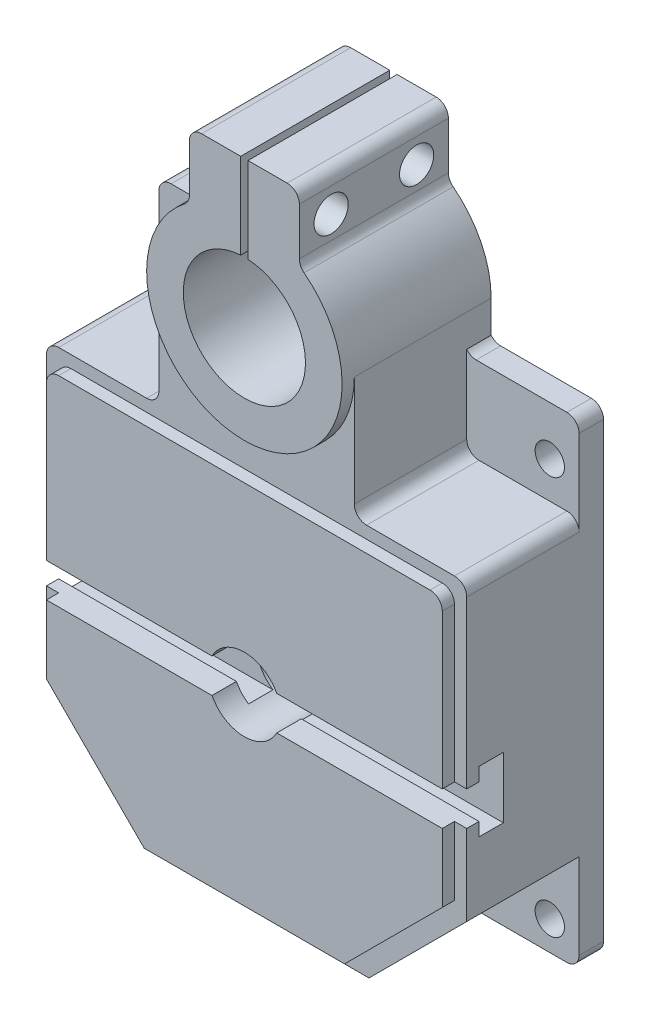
ISO-10303-21;
HEADER;
FILE_DESCRIPTION(('STEP AP214'),'2;1');
FILE_NAME('part.step','',(''),(''),'','','');
FILE_SCHEMA(('AUTOMOTIVE_DESIGN { 1 0 10303 214 1 1 1 1 }'));
ENDSEC;
DATA;
#1=APPLICATION_CONTEXT('core data for automotive mechanical design processes');
#2=APPLICATION_PROTOCOL_DEFINITION('international standard','automotive_design',2000,#1);
#3=PRODUCT_CONTEXT('',#1,'mechanical');
#4=PRODUCT('Part','Part','',(#3));
#5=PRODUCT_RELATED_PRODUCT_CATEGORY('part','',(#4));
#6=PRODUCT_DEFINITION_FORMATION('','',#4);
#7=PRODUCT_DEFINITION_CONTEXT('part definition',#1,'design');
#8=PRODUCT_DEFINITION('design','',#6,#7);
#9=PRODUCT_DEFINITION_SHAPE('','',#8);
#10=(LENGTH_UNIT() NAMED_UNIT(*) SI_UNIT(.MILLI.,.METRE.));
#11=(NAMED_UNIT(*) PLANE_ANGLE_UNIT() SI_UNIT($,.RADIAN.));
#12=(NAMED_UNIT(*) SI_UNIT($,.STERADIAN.) SOLID_ANGLE_UNIT());
#13=UNCERTAINTY_MEASURE_WITH_UNIT(LENGTH_MEASURE(1.E-05),#10,'distance_accuracy_value','');
#14=(GEOMETRIC_REPRESENTATION_CONTEXT(3) GLOBAL_UNCERTAINTY_ASSIGNED_CONTEXT((#13)) GLOBAL_UNIT_ASSIGNED_CONTEXT((#10,
#11,#12)) REPRESENTATION_CONTEXT('',''));
#15=CARTESIAN_POINT('',(0.,0.,0.));
#16=DIRECTION('',(0.,0.,1.));
#17=DIRECTION('',(1.,0.,0.));
#18=AXIS2_PLACEMENT_3D('',#15,#16,#17);
#19=CARTESIAN_POINT('',(0.,190.,10.));
#20=DIRECTION('',(0.,-1.,0.));
#21=DIRECTION('',(0.,0.,-1.));
#22=AXIS2_PLACEMENT_3D('',#19,#20,#21);
#23=PLANE('',#22);
#24=DIRECTION('',(-1.,0.,0.));
#25=VECTOR('',#24,1.);
#26=CARTESIAN_POINT('',(-1.50673124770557E-13,190.,61.));
#27=LINE('',#26,#25);
#28=CARTESIAN_POINT('',(-1.49999999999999,190.,61.));
#29=VERTEX_POINT('',#28);
#30=CARTESIAN_POINT('',(-17.4999999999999,190.,61.));
#31=VERTEX_POINT('',#30);
#32=EDGE_CURVE('E1519',#29,#31,#27,.T.);
#33=ORIENTED_EDGE('',*,*,#32,.F.);
#34=DIRECTION('',(0.,0.,1.));
#35=VECTOR('',#34,1.);
#36=CARTESIAN_POINT('',(-1.49999999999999,190.,-0.499999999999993));
#37=LINE('',#36,#35);
#38=CARTESIAN_POINT('',(-1.49999999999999,190.,0.));
#39=VERTEX_POINT('',#38);
#40=EDGE_CURVE('E59',#39,#29,#37,.T.);
#41=ORIENTED_EDGE('',*,*,#40,.F.);
#42=DIRECTION('',(-1.,0.,0.));
#43=VECTOR('',#42,1.);
#44=CARTESIAN_POINT('',(0.,190.,0.));
#45=LINE('',#44,#43);
#46=CARTESIAN_POINT('',(-17.4999999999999,190.,0.));
#47=VERTEX_POINT('',#46);
#48=EDGE_CURVE('E968',#39,#47,#45,.T.);
#49=ORIENTED_EDGE('',*,*,#48,.T.);
#50=DIRECTION('',(0.,0.,-1.));
#51=VECTOR('',#50,1.);
#52=CARTESIAN_POINT('',(-17.4999999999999,190.,10.));
#53=LINE('',#52,#51);
#54=EDGE_CURVE('E1002',#31,#47,#53,.T.);
#55=ORIENTED_EDGE('',*,*,#54,.F.);
#56=EDGE_LOOP('',(#33,#41,#49,#55));
#57=FACE_BOUND('',#56,.T.);
#58=ADVANCED_FACE('F38',(#57),#23,.F.);
#59=CARTESIAN_POINT('',(81.,75.,56.));
#60=DIRECTION('',(0.,0.,-1.));
#61=DIRECTION('',(-1.,0.,0.));
#62=AXIS2_PLACEMENT_3D('',#59,#60,#61);
#63=PLANE('',#62);
#64=DIRECTION('',(-1.,0.,0.));
#65=VECTOR('',#64,1.);
#66=CARTESIAN_POINT('',(81.,7.00000000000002,56.));
#67=LINE('',#66,#65);
#68=CARTESIAN_POINT('',(86.,7.00000000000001,56.));
#69=VERTEX_POINT('',#68);
#70=CARTESIAN_POINT('',(81.,7.00000000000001,56.));
#71=VERTEX_POINT('',#70);
#72=EDGE_CURVE('E749',#69,#71,#67,.T.);
#73=ORIENTED_EDGE('',*,*,#72,.F.);
#74=DIRECTION('',(0.,1.,0.));
#75=VECTOR('',#74,1.);
#76=CARTESIAN_POINT('',(86.,-40.,56.));
#77=LINE('',#76,#75);
#78=CARTESIAN_POINT('',(86.,75.,56.));
#79=VERTEX_POINT('',#78);
#80=EDGE_CURVE('E1226',#69,#79,#77,.T.);
#81=ORIENTED_EDGE('',*,*,#80,.T.);
#82=CARTESIAN_POINT('',(81.,75.,56.));
#83=DIRECTION('',(0.,0.,1.));
#84=DIRECTION('',(-1.,0.,0.));
#85=AXIS2_PLACEMENT_3D('',#82,#83,#84);
#86=CIRCLE('',#85,5.);
#87=CARTESIAN_POINT('',(80.9999999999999,80.,56.));
#88=VERTEX_POINT('',#87);
#89=EDGE_CURVE('E1200',#79,#88,#86,.T.);
#90=ORIENTED_EDGE('',*,*,#89,.T.);
#91=DIRECTION('',(-1.,0.,0.));
#92=VECTOR('',#91,1.);
#93=CARTESIAN_POINT('',(45.0000000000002,80.,56.));
#94=LINE('',#93,#92);
#95=CARTESIAN_POINT('',(45.0000000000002,80.,56.));
#96=VERTEX_POINT('',#95);
#97=EDGE_CURVE('E1203',#88,#96,#94,.T.);
#98=ORIENTED_EDGE('',*,*,#97,.T.);
#99=CARTESIAN_POINT('',(45.0000000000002,85.,56.));
#100=DIRECTION('',(0.,0.,-1.));
#101=DIRECTION('',(1.,0.,0.));
#102=AXIS2_PLACEMENT_3D('',#99,#100,#101);
#103=CIRCLE('',#102,5.);
#104=CARTESIAN_POINT('',(40.0000000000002,85.,56.));
#105=VERTEX_POINT('',#104);
#106=EDGE_CURVE('E1206',#96,#105,#103,.T.);
#107=ORIENTED_EDGE('',*,*,#106,.T.);
#108=DIRECTION('',(0.,1.,0.));
#109=VECTOR('',#108,1.);
#110=CARTESIAN_POINT('',(40.,130.,56.));
#111=LINE('',#110,#109);
#112=CARTESIAN_POINT('',(40.,130.,56.));
#113=VERTEX_POINT('',#112);
#114=EDGE_CURVE('E1208',#105,#113,#111,.T.);
#115=ORIENTED_EDGE('',*,*,#114,.T.);
#116=CARTESIAN_POINT('',(0.,130.,56.));
#117=DIRECTION('',(0.,0.,1.));
#118=DIRECTION('',(1.,0.,0.));
#119=AXIS2_PLACEMENT_3D('',#116,#117,#118);
#120=CIRCLE('',#119,40.);
#121=CARTESIAN_POINT('',(-40.,130.,56.));
#122=VERTEX_POINT('',#121);
#123=EDGE_CURVE('E633',#122,#113,#120,.T.);
#124=ORIENTED_EDGE('',*,*,#123,.F.);
#125=DIRECTION('',(0.,-1.,0.));
#126=VECTOR('',#125,1.);
#127=CARTESIAN_POINT('',(-40.,130.,56.));
#128=LINE('',#127,#126);
#129=CARTESIAN_POINT('',(-39.9999999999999,85.,56.));
#130=VERTEX_POINT('',#129);
#131=EDGE_CURVE('E1210',#122,#130,#128,.T.);
#132=ORIENTED_EDGE('',*,*,#131,.T.);
#133=CARTESIAN_POINT('',(-44.9999999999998,85.,56.));
#134=DIRECTION('',(0.,0.,-1.));
#135=DIRECTION('',(-1.,0.,0.));
#136=AXIS2_PLACEMENT_3D('',#133,#134,#135);
#137=CIRCLE('',#136,5.);
#138=CARTESIAN_POINT('',(-44.9999999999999,80.,56.));
#139=VERTEX_POINT('',#138);
#140=EDGE_CURVE('E1212',#130,#139,#137,.T.);
#141=ORIENTED_EDGE('',*,*,#140,.T.);
#142=DIRECTION('',(-1.,0.,0.));
#143=VECTOR('',#142,1.);
#144=CARTESIAN_POINT('',(-81.,80.,56.));
#145=LINE('',#144,#143);
#146=CARTESIAN_POINT('',(-81.,80.,56.));
#147=VERTEX_POINT('',#146);
#148=EDGE_CURVE('E1214',#139,#147,#145,.T.);
#149=ORIENTED_EDGE('',*,*,#148,.T.);
#150=CARTESIAN_POINT('',(-81.,75.,56.));
#151=DIRECTION('',(0.,0.,1.));
#152=DIRECTION('',(1.,0.,0.));
#153=AXIS2_PLACEMENT_3D('',#150,#151,#152);
#154=CIRCLE('',#153,5.);
#155=CARTESIAN_POINT('',(-86.,75.,56.));
#156=VERTEX_POINT('',#155);
#157=EDGE_CURVE('E1216',#147,#156,#154,.T.);
#158=ORIENTED_EDGE('',*,*,#157,.T.);
#159=DIRECTION('',(0.,-1.,0.));
#160=VECTOR('',#159,1.);
#161=CARTESIAN_POINT('',(-86.,75.,56.));
#162=LINE('',#161,#160);
#163=CARTESIAN_POINT('',(-86.,6.99999999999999,56.));
#164=VERTEX_POINT('',#163);
#165=EDGE_CURVE('E1218',#156,#164,#162,.T.);
#166=ORIENTED_EDGE('',*,*,#165,.T.);
#167=CARTESIAN_POINT('',(-81.,6.99999999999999,56.));
#168=VERTEX_POINT('',#167);
#169=EDGE_CURVE('E743',#168,#164,#67,.T.);
#170=ORIENTED_EDGE('',*,*,#169,.F.);
#171=DIRECTION('',(0.,-1.,0.));
#172=VECTOR('',#171,1.);
#173=CARTESIAN_POINT('',(-81.,0.,56.));
#174=LINE('',#173,#172);
#175=CARTESIAN_POINT('',(-81.,70.,56.));
#176=VERTEX_POINT('',#175);
#177=EDGE_CURVE('E1153',#176,#168,#174,.T.);
#178=ORIENTED_EDGE('',*,*,#177,.F.);
#179=CARTESIAN_POINT('',(-76.,70.,56.));
#180=DIRECTION('',(0.,0.,1.));
#181=DIRECTION('',(1.,0.,0.));
#182=AXIS2_PLACEMENT_3D('',#179,#180,#181);
#183=CIRCLE('',#182,5.);
#184=CARTESIAN_POINT('',(-76.,75.,56.));
#185=VERTEX_POINT('',#184);
#186=EDGE_CURVE('E1154',#176,#185,#183,.F.);
#187=ORIENTED_EDGE('',*,*,#186,.T.);
#188=DIRECTION('',(-1.,0.,0.));
#189=VECTOR('',#188,1.);
#190=CARTESIAN_POINT('',(0.,75.,56.));
#191=LINE('',#190,#189);
#192=CARTESIAN_POINT('',(76.,75.,56.));
#193=VERTEX_POINT('',#192);
#194=EDGE_CURVE('E1157',#193,#185,#191,.T.);
#195=ORIENTED_EDGE('',*,*,#194,.F.);
#196=CARTESIAN_POINT('',(76.,70.,56.));
#197=DIRECTION('',(0.,0.,1.));
#198=DIRECTION('',(1.,0.,0.));
#199=AXIS2_PLACEMENT_3D('',#196,#197,#198);
#200=CIRCLE('',#199,5.);
#201=CARTESIAN_POINT('',(81.,70.,56.));
#202=VERTEX_POINT('',#201);
#203=EDGE_CURVE('E1454',#202,#193,#200,.T.);
#204=ORIENTED_EDGE('',*,*,#203,.F.);
#205=DIRECTION('',(0.,1.,0.));
#206=VECTOR('',#205,1.);
#207=CARTESIAN_POINT('',(81.,0.,56.));
#208=LINE('',#207,#206);
#209=EDGE_CURVE('E1450',#71,#202,#208,.T.);
#210=ORIENTED_EDGE('',*,*,#209,.F.);
#211=EDGE_LOOP('',(#73,#81,#90,#98,#107,#115,#124,#132,#141,#149,#158,#166,#170,#178,#187,#195,
#204,#210));
#212=FACE_BOUND('',#211,.T.);
#213=ADVANCED_FACE('F1388',(#212),#63,.F.);
#214=CARTESIAN_POINT('',(-86.,110.,10.));
#215=DIRECTION('',(1.,0.,0.));
#216=DIRECTION('',(0.,1.,0.));
#217=AXIS2_PLACEMENT_3D('',#214,#215,#216);
#218=PLANE('',#217);
#219=CARTESIAN_POINT('',(-86.,50.,25.));
#220=DIRECTION('',(-1.,0.,0.));
#221=DIRECTION('',(0.,-1.,0.));
#222=AXIS2_PLACEMENT_3D('',#219,#220,#221);
#223=CIRCLE('',#222,11.);
#224=CARTESIAN_POINT('',(-86.,39.,25.));
#225=VERTEX_POINT('',#224);
#226=EDGE_CURVE('E605',#225,#225,#223,.T.);
#227=ORIENTED_EDGE('',*,*,#226,.F.);
#228=EDGE_LOOP('',(#227));
#229=FACE_BOUND('',#228,.T.);
#230=DIRECTION('',(0.,0.,1.));
#231=VECTOR('',#230,1.);
#232=CARTESIAN_POINT('',(-86.,6.99999999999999,0.));
#233=LINE('',#232,#231);
#234=CARTESIAN_POINT('',(-86.,6.99999999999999,51.));
#235=VERTEX_POINT('',#234);
#236=EDGE_CURVE('E801',#235,#164,#233,.T.);
#237=ORIENTED_EDGE('',*,*,#236,.T.);
#238=ORIENTED_EDGE('',*,*,#165,.F.);
#239=DIRECTION('',(0.,0.,-1.));
#240=VECTOR('',#239,1.);
#241=CARTESIAN_POINT('',(-86.,75.,56.));
#242=LINE('',#241,#240);
#243=CARTESIAN_POINT('',(-86.,75.,10.));
#244=VERTEX_POINT('',#243);
#245=EDGE_CURVE('E1271',#156,#244,#242,.T.);
#246=ORIENTED_EDGE('',*,*,#245,.T.);
#247=DIRECTION('',(0.,-1.,0.));
#248=VECTOR('',#247,1.);
#249=CARTESIAN_POINT('',(-86.,110.,10.));
#250=LINE('',#249,#248);
#251=CARTESIAN_POINT('',(-86.,110.,10.));
#252=VERTEX_POINT('',#251);
#253=EDGE_CURVE('E1327',#252,#244,#250,.T.);
#254=ORIENTED_EDGE('',*,*,#253,.F.);
#255=DIRECTION('',(0.,0.,-1.));
#256=VECTOR('',#255,1.);
#257=CARTESIAN_POINT('',(-86.,110.,10.));
#258=LINE('',#257,#256);
#259=CARTESIAN_POINT('',(-86.,110.,0.));
#260=VERTEX_POINT('',#259);
#261=EDGE_CURVE('E1031',#252,#260,#258,.T.);
#262=ORIENTED_EDGE('',*,*,#261,.T.);
#263=DIRECTION('',(0.,-1.,0.));
#264=VECTOR('',#263,1.);
#265=CARTESIAN_POINT('',(-86.,110.,0.));
#266=LINE('',#265,#264);
#267=CARTESIAN_POINT('',(-86.,-75.,0.));
#268=VERTEX_POINT('',#267);
#269=EDGE_CURVE('E1350',#260,#268,#266,.T.);
#270=ORIENTED_EDGE('',*,*,#269,.T.);
#271=DIRECTION('',(0.,0.,-1.));
#272=VECTOR('',#271,1.);
#273=CARTESIAN_POINT('',(-86.,-75.,10.));
#274=LINE('',#273,#272);
#275=CARTESIAN_POINT('',(-86.,-75.,10.));
#276=VERTEX_POINT('',#275);
#277=EDGE_CURVE('E1028',#276,#268,#274,.T.);
#278=ORIENTED_EDGE('',*,*,#277,.F.);
#279=CARTESIAN_POINT('',(-86.,-40.,10.));
#280=VERTEX_POINT('',#279);
#281=EDGE_CURVE('E1326',#280,#276,#250,.T.);
#282=ORIENTED_EDGE('',*,*,#281,.F.);
#283=DIRECTION('',(0.,0.,-1.));
#284=VECTOR('',#283,1.);
#285=CARTESIAN_POINT('',(-86.,-40.,56.));
#286=LINE('',#285,#284);
#287=CARTESIAN_POINT('',(-86.,-40.,56.));
#288=VERTEX_POINT('',#287);
#289=EDGE_CURVE('E1268',#288,#280,#286,.T.);
#290=ORIENTED_EDGE('',*,*,#289,.F.);
#291=CARTESIAN_POINT('',(-86.,-7.00000000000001,56.));
#292=VERTEX_POINT('',#291);
#293=EDGE_CURVE('E1138',#292,#288,#162,.T.);
#294=ORIENTED_EDGE('',*,*,#293,.F.);
#295=DIRECTION('',(0.,0.,1.));
#296=VECTOR('',#295,1.);
#297=CARTESIAN_POINT('',(-86.,-7.00000000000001,0.));
#298=LINE('',#297,#296);
#299=CARTESIAN_POINT('',(-86.,-7.00000000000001,51.));
#300=VERTEX_POINT('',#299);
#301=EDGE_CURVE('E804',#300,#292,#298,.T.);
#302=ORIENTED_EDGE('',*,*,#301,.F.);
#303=DIRECTION('',(0.,1.,0.));
#304=VECTOR('',#303,1.);
#305=CARTESIAN_POINT('',(-86.,0.,51.));
#306=LINE('',#305,#304);
#307=CARTESIAN_POINT('',(-86.,-12.5,51.));
#308=VERTEX_POINT('',#307);
#309=EDGE_CURVE('E806',#308,#300,#306,.T.);
#310=ORIENTED_EDGE('',*,*,#309,.F.);
#311=DIRECTION('',(0.,0.,1.));
#312=VECTOR('',#311,1.);
#313=CARTESIAN_POINT('',(-86.,-12.5,0.));
#314=LINE('',#313,#312);
#315=CARTESIAN_POINT('',(-86.,-12.5,41.));
#316=VERTEX_POINT('',#315);
#317=EDGE_CURVE('E809',#316,#308,#314,.T.);
#318=ORIENTED_EDGE('',*,*,#317,.F.);
#319=DIRECTION('',(0.,-1.,0.));
#320=VECTOR('',#319,1.);
#321=CARTESIAN_POINT('',(-86.,0.,41.));
#322=LINE('',#321,#320);
#323=CARTESIAN_POINT('',(-86.,12.5,41.));
#324=VERTEX_POINT('',#323);
#325=EDGE_CURVE('E812',#324,#316,#322,.T.);
#326=ORIENTED_EDGE('',*,*,#325,.F.);
#327=DIRECTION('',(0.,0.,-1.));
#328=VECTOR('',#327,1.);
#329=CARTESIAN_POINT('',(-86.,12.5,0.));
#330=LINE('',#329,#328);
#331=CARTESIAN_POINT('',(-86.,12.5,51.));
#332=VERTEX_POINT('',#331);
#333=EDGE_CURVE('E794',#332,#324,#330,.T.);
#334=ORIENTED_EDGE('',*,*,#333,.F.);
#335=DIRECTION('',(0.,-1.,0.));
#336=VECTOR('',#335,1.);
#337=CARTESIAN_POINT('',(-86.,0.,51.));
#338=LINE('',#337,#336);
#339=EDGE_CURVE('E798',#332,#235,#338,.T.);
#340=ORIENTED_EDGE('',*,*,#339,.T.);
#341=EDGE_LOOP('',(#237,#238,#246,#254,#262,#270,#278,#282,#290,#294,#302,#310,#318,#326,#334,#340));
#342=FACE_BOUND('',#341,.T.);
#343=ADVANCED_FACE('F1116',(#229,#342),#218,.F.);
#344=CARTESIAN_POINT('',(86.,-75.,10.));
#345=DIRECTION('',(-1.,0.,0.));
#346=DIRECTION('',(0.,-1.,0.));
#347=AXIS2_PLACEMENT_3D('',#344,#345,#346);
#348=PLANE('',#347);
#349=DIRECTION('',(0.,0.,1.));
#350=VECTOR('',#349,1.);
#351=CARTESIAN_POINT('',(86.,7.00000000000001,0.));
#352=LINE('',#351,#350);
#353=CARTESIAN_POINT('',(86.,7.00000000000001,51.));
#354=VERTEX_POINT('',#353);
#355=EDGE_CURVE('E821',#354,#69,#352,.T.);
#356=ORIENTED_EDGE('',*,*,#355,.F.);
#357=DIRECTION('',(0.,-1.,0.));
#358=VECTOR('',#357,1.);
#359=CARTESIAN_POINT('',(86.,0.,51.));
#360=LINE('',#359,#358);
#361=CARTESIAN_POINT('',(86.,12.5,51.));
#362=VERTEX_POINT('',#361);
#363=EDGE_CURVE('E819',#362,#354,#360,.T.);
#364=ORIENTED_EDGE('',*,*,#363,.F.);
#365=DIRECTION('',(0.,0.,-1.));
#366=VECTOR('',#365,1.);
#367=CARTESIAN_POINT('',(86.,12.5,0.));
#368=LINE('',#367,#366);
#369=CARTESIAN_POINT('',(86.,12.5,41.));
#370=VERTEX_POINT('',#369);
#371=EDGE_CURVE('E816',#362,#370,#368,.T.);
#372=ORIENTED_EDGE('',*,*,#371,.T.);
#373=DIRECTION('',(0.,-1.,0.));
#374=VECTOR('',#373,1.);
#375=CARTESIAN_POINT('',(86.,0.,41.));
#376=LINE('',#375,#374);
#377=CARTESIAN_POINT('',(86.,-12.5,41.));
#378=VERTEX_POINT('',#377);
#379=EDGE_CURVE('E797',#370,#378,#376,.T.);
#380=ORIENTED_EDGE('',*,*,#379,.T.);
#381=DIRECTION('',(0.,0.,1.));
#382=VECTOR('',#381,1.);
#383=CARTESIAN_POINT('',(86.,-12.5,0.));
#384=LINE('',#383,#382);
#385=CARTESIAN_POINT('',(86.,-12.5,51.));
#386=VERTEX_POINT('',#385);
#387=EDGE_CURVE('E829',#378,#386,#384,.T.);
#388=ORIENTED_EDGE('',*,*,#387,.T.);
#389=DIRECTION('',(0.,1.,0.));
#390=VECTOR('',#389,1.);
#391=CARTESIAN_POINT('',(86.,0.,51.));
#392=LINE('',#391,#390);
#393=CARTESIAN_POINT('',(86.,-6.99999999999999,51.));
#394=VERTEX_POINT('',#393);
#395=EDGE_CURVE('E826',#386,#394,#392,.T.);
#396=ORIENTED_EDGE('',*,*,#395,.T.);
#397=DIRECTION('',(0.,0.,1.));
#398=VECTOR('',#397,1.);
#399=CARTESIAN_POINT('',(86.,-6.99999999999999,0.));
#400=LINE('',#399,#398);
#401=CARTESIAN_POINT('',(86.,-6.99999999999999,56.));
#402=VERTEX_POINT('',#401);
#403=EDGE_CURVE('E823',#394,#402,#400,.T.);
#404=ORIENTED_EDGE('',*,*,#403,.T.);
#405=CARTESIAN_POINT('',(86.,-40.,56.));
#406=VERTEX_POINT('',#405);
#407=EDGE_CURVE('E1227',#406,#402,#77,.T.);
#408=ORIENTED_EDGE('',*,*,#407,.F.);
#409=DIRECTION('',(0.,0.,-1.));
#410=VECTOR('',#409,1.);
#411=CARTESIAN_POINT('',(86.,-40.,56.));
#412=LINE('',#411,#410);
#413=CARTESIAN_POINT('',(86.,-40.,10.));
#414=VERTEX_POINT('',#413);
#415=EDGE_CURVE('E1259',#406,#414,#412,.T.);
#416=ORIENTED_EDGE('',*,*,#415,.T.);
#417=DIRECTION('',(0.,1.,0.));
#418=VECTOR('',#417,1.);
#419=CARTESIAN_POINT('',(86.,-75.,10.));
#420=LINE('',#419,#418);
#421=CARTESIAN_POINT('',(86.,-75.,10.));
#422=VERTEX_POINT('',#421);
#423=EDGE_CURVE('E1336',#422,#414,#420,.T.);
#424=ORIENTED_EDGE('',*,*,#423,.F.);
#425=DIRECTION('',(0.,0.,-1.));
#426=VECTOR('',#425,1.);
#427=CARTESIAN_POINT('',(86.,-75.,10.));
#428=LINE('',#427,#426);
#429=CARTESIAN_POINT('',(86.,-75.,0.));
#430=VERTEX_POINT('',#429);
#431=EDGE_CURVE('E940',#422,#430,#428,.T.);
#432=ORIENTED_EDGE('',*,*,#431,.T.);
#433=DIRECTION('',(0.,1.,0.));
#434=VECTOR('',#433,1.);
#435=CARTESIAN_POINT('',(86.,-75.,0.));
#436=LINE('',#435,#434);
#437=CARTESIAN_POINT('',(86.,110.,0.));
#438=VERTEX_POINT('',#437);
#439=EDGE_CURVE('E947',#430,#438,#436,.T.);
#440=ORIENTED_EDGE('',*,*,#439,.T.);
#441=DIRECTION('',(0.,0.,-1.));
#442=VECTOR('',#441,1.);
#443=CARTESIAN_POINT('',(86.,110.,10.));
#444=LINE('',#443,#442);
#445=CARTESIAN_POINT('',(86.,110.,10.));
#446=VERTEX_POINT('',#445);
#447=EDGE_CURVE('E1023',#446,#438,#444,.T.);
#448=ORIENTED_EDGE('',*,*,#447,.F.);
#449=CARTESIAN_POINT('',(86.,75.,10.));
#450=VERTEX_POINT('',#449);
#451=EDGE_CURVE('E1335',#450,#446,#420,.T.);
#452=ORIENTED_EDGE('',*,*,#451,.F.);
#453=DIRECTION('',(0.,0.,-1.));
#454=VECTOR('',#453,1.);
#455=CARTESIAN_POINT('',(86.,75.,56.));
#456=LINE('',#455,#454);
#457=EDGE_CURVE('E1229',#79,#450,#456,.T.);
#458=ORIENTED_EDGE('',*,*,#457,.F.);
#459=ORIENTED_EDGE('',*,*,#80,.F.);
#460=EDGE_LOOP('',(#356,#364,#372,#380,#388,#396,#404,#408,#416,#424,#432,#440,#448,#452,#458,#459));
#461=FACE_BOUND('',#460,.T.);
#462=ADVANCED_FACE('F1478',(#461),#348,.F.);
#463=CARTESIAN_POINT('',(0.,0.,10.));
#464=DIRECTION('',(0.,0.,-1.));
#465=DIRECTION('',(-1.,0.,0.));
#466=AXIS2_PLACEMENT_3D('',#463,#464,#465);
#467=CYLINDRICAL_SURFACE('',#466,15.);
#468=CARTESIAN_POINT('',(0.,0.,30.));
#469=DIRECTION('',(0.,0.,-1.));
#470=DIRECTION('',(-1.,0.,0.));
#471=AXIS2_PLACEMENT_3D('',#468,#469,#470);
#472=CIRCLE('',#471,15.);
#473=CARTESIAN_POINT('',(-15.,0.,30.));
#474=VERTEX_POINT('',#473);
#475=EDGE_CURVE('E732',#474,#474,#472,.T.);
#476=ORIENTED_EDGE('',*,*,#475,.T.);
#477=EDGE_LOOP('',(#476));
#478=FACE_BOUND('',#477,.T.);
#479=CARTESIAN_POINT('',(0.,0.,61.));
#480=DIRECTION('',(0.,0.,1.));
#481=DIRECTION('',(1.,0.,0.));
#482=AXIS2_PLACEMENT_3D('',#479,#480,#481);
#483=CIRCLE('',#482,15.);
#484=CARTESIAN_POINT('',(-13.2664991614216,7.,61.));
#485=VERTEX_POINT('',#484);
#486=CARTESIAN_POINT('',(13.2664991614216,7.,61.));
#487=VERTEX_POINT('',#486);
#488=EDGE_CURVE('E1445',#485,#487,#483,.F.);
#489=ORIENTED_EDGE('',*,*,#488,.F.);
#490=DIRECTION('',(0.,0.,-1.));
#491=VECTOR('',#490,1.);
#492=CARTESIAN_POINT('',(-13.2664991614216,7.,10.));
#493=LINE('',#492,#491);
#494=CARTESIAN_POINT('',(-13.2664991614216,7.,51.));
#495=VERTEX_POINT('',#494);
#496=EDGE_CURVE('E744',#485,#495,#493,.T.);
#497=ORIENTED_EDGE('',*,*,#496,.T.);
#498=CARTESIAN_POINT('',(0.,0.,51.));
#499=DIRECTION('',(0.,0.,-1.));
#500=DIRECTION('',(-1.,0.,0.));
#501=AXIS2_PLACEMENT_3D('',#498,#499,#500);
#502=CIRCLE('',#501,15.);
#503=CARTESIAN_POINT('',(-8.2915619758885,12.5,51.));
#504=VERTEX_POINT('',#503);
#505=EDGE_CURVE('E1090',#495,#504,#502,.T.);
#506=ORIENTED_EDGE('',*,*,#505,.T.);
#507=DIRECTION('',(0.,0.,-1.));
#508=VECTOR('',#507,1.);
#509=CARTESIAN_POINT('',(-8.29156197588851,12.5,10.));
#510=LINE('',#509,#508);
#511=CARTESIAN_POINT('',(-8.29156197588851,12.5,41.));
#512=VERTEX_POINT('',#511);
#513=EDGE_CURVE('E1092',#512,#504,#510,.F.);
#514=ORIENTED_EDGE('',*,*,#513,.F.);
#515=CARTESIAN_POINT('',(0.,0.,41.));
#516=DIRECTION('',(0.,0.,-1.));
#517=DIRECTION('',(0.,1.,0.));
#518=AXIS2_PLACEMENT_3D('',#515,#516,#517);
#519=CIRCLE('',#518,15.);
#520=CARTESIAN_POINT('',(-8.2915619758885,-12.5,41.));
#521=VERTEX_POINT('',#520);
#522=EDGE_CURVE('E1084',#521,#512,#519,.T.);
#523=ORIENTED_EDGE('',*,*,#522,.F.);
#524=DIRECTION('',(0.,0.,-1.));
#525=VECTOR('',#524,1.);
#526=CARTESIAN_POINT('',(-8.2915619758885,-12.5,10.));
#527=LINE('',#526,#525);
#528=CARTESIAN_POINT('',(-8.2915619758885,-12.5,51.));
#529=VERTEX_POINT('',#528);
#530=EDGE_CURVE('E1089',#529,#521,#527,.T.);
#531=ORIENTED_EDGE('',*,*,#530,.F.);
#532=CARTESIAN_POINT('',(0.,0.,51.));
#533=DIRECTION('',(0.,0.,1.));
#534=DIRECTION('',(1.,0.,0.));
#535=AXIS2_PLACEMENT_3D('',#532,#533,#534);
#536=CIRCLE('',#535,15.);
#537=CARTESIAN_POINT('',(-13.2664991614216,-7.,51.));
#538=VERTEX_POINT('',#537);
#539=EDGE_CURVE('E1081',#538,#529,#536,.T.);
#540=ORIENTED_EDGE('',*,*,#539,.F.);
#541=DIRECTION('',(0.,0.,-1.));
#542=VECTOR('',#541,1.);
#543=CARTESIAN_POINT('',(-13.2664991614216,-7.,10.));
#544=LINE('',#543,#542);
#545=CARTESIAN_POINT('',(-13.2664991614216,-7.,61.));
#546=VERTEX_POINT('',#545);
#547=EDGE_CURVE('E757',#546,#538,#544,.T.);
#548=ORIENTED_EDGE('',*,*,#547,.F.);
#549=CARTESIAN_POINT('',(13.2664991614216,-7.,61.));
#550=VERTEX_POINT('',#549);
#551=EDGE_CURVE('E1170',#550,#546,#483,.F.);
#552=ORIENTED_EDGE('',*,*,#551,.F.);
#553=DIRECTION('',(0.,0.,-1.));
#554=VECTOR('',#553,1.);
#555=CARTESIAN_POINT('',(13.2664991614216,-7.,10.));
#556=LINE('',#555,#554);
#557=CARTESIAN_POINT('',(13.2664991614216,-7.,51.));
#558=VERTEX_POINT('',#557);
#559=EDGE_CURVE('E765',#558,#550,#556,.F.);
#560=ORIENTED_EDGE('',*,*,#559,.F.);
#561=CARTESIAN_POINT('',(8.2915619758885,-12.5,51.));
#562=VERTEX_POINT('',#561);
#563=EDGE_CURVE('E1078',#562,#558,#536,.T.);
#564=ORIENTED_EDGE('',*,*,#563,.F.);
#565=DIRECTION('',(0.,0.,-1.));
#566=VECTOR('',#565,1.);
#567=CARTESIAN_POINT('',(8.2915619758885,-12.5,10.));
#568=LINE('',#567,#566);
#569=CARTESIAN_POINT('',(8.2915619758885,-12.5,41.));
#570=VERTEX_POINT('',#569);
#571=EDGE_CURVE('E1076',#570,#562,#568,.F.);
#572=ORIENTED_EDGE('',*,*,#571,.F.);
#573=CARTESIAN_POINT('',(8.2915619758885,12.5,41.));
#574=VERTEX_POINT('',#573);
#575=EDGE_CURVE('E1080',#574,#570,#519,.T.);
#576=ORIENTED_EDGE('',*,*,#575,.F.);
#577=DIRECTION('',(0.,0.,-1.));
#578=VECTOR('',#577,1.);
#579=CARTESIAN_POINT('',(8.2915619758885,12.5,10.));
#580=LINE('',#579,#578);
#581=CARTESIAN_POINT('',(8.2915619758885,12.5,51.));
#582=VERTEX_POINT('',#581);
#583=EDGE_CURVE('E1083',#582,#574,#580,.T.);
#584=ORIENTED_EDGE('',*,*,#583,.F.);
#585=CARTESIAN_POINT('',(13.2664991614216,7.,51.));
#586=VERTEX_POINT('',#585);
#587=EDGE_CURVE('E1086',#582,#586,#502,.T.);
#588=ORIENTED_EDGE('',*,*,#587,.T.);
#589=DIRECTION('',(0.,0.,-1.));
#590=VECTOR('',#589,1.);
#591=CARTESIAN_POINT('',(13.2664991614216,7.,10.));
#592=LINE('',#591,#590);
#593=EDGE_CURVE('E751',#586,#487,#592,.F.);
#594=ORIENTED_EDGE('',*,*,#593,.T.);
#595=EDGE_LOOP('',(#489,#497,#506,#514,#523,#531,#540,#548,#552,#560,#564,#572,#576,#584,#588,#594));
#596=FACE_BOUND('',#595,.T.);
#597=ADVANCED_FACE('F1100',(#478,#596),#467,.F.);
#598=CARTESIAN_POINT('',(81.,0.,61.));
#599=DIRECTION('',(-1.,0.,0.));
#600=DIRECTION('',(0.,-1.,0.));
#601=AXIS2_PLACEMENT_3D('',#598,#599,#600);
#602=PLANE('',#601);
#603=DIRECTION('',(0.,0.,1.));
#604=VECTOR('',#603,1.);
#605=CARTESIAN_POINT('',(81.,7.00000000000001,61.));
#606=LINE('',#605,#604);
#607=CARTESIAN_POINT('',(81.,7.00000000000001,61.));
#608=VERTEX_POINT('',#607);
#609=EDGE_CURVE('E754',#71,#608,#606,.T.);
#610=ORIENTED_EDGE('',*,*,#609,.F.);
#611=ORIENTED_EDGE('',*,*,#209,.T.);
#612=DIRECTION('',(0.,0.,-1.));
#613=VECTOR('',#612,1.);
#614=CARTESIAN_POINT('',(81.,70.,61.));
#615=LINE('',#614,#613);
#616=CARTESIAN_POINT('',(81.,70.,61.));
#617=VERTEX_POINT('',#616);
#618=EDGE_CURVE('E1184',#617,#202,#615,.T.);
#619=ORIENTED_EDGE('',*,*,#618,.F.);
#620=DIRECTION('',(0.,1.,0.));
#621=VECTOR('',#620,1.);
#622=CARTESIAN_POINT('',(81.,0.,61.));
#623=LINE('',#622,#621);
#624=EDGE_CURVE('E1426',#608,#617,#623,.T.);
#625=ORIENTED_EDGE('',*,*,#624,.F.);
#626=EDGE_LOOP('',(#610,#611,#619,#625));
#627=FACE_BOUND('',#626,.T.);
#628=ADVANCED_FACE('F1472',(#627),#602,.F.);
#629=CARTESIAN_POINT('',(-81.,0.,61.));
#630=DIRECTION('',(1.,0.,0.));
#631=DIRECTION('',(0.,1.,0.));
#632=AXIS2_PLACEMENT_3D('',#629,#630,#631);
#633=PLANE('',#632);
#634=DIRECTION('',(0.,0.,-1.));
#635=VECTOR('',#634,1.);
#636=CARTESIAN_POINT('',(-81.,6.99999999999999,61.));
#637=LINE('',#636,#635);
#638=CARTESIAN_POINT('',(-81.,6.99999999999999,61.));
#639=VERTEX_POINT('',#638);
#640=EDGE_CURVE('E747',#639,#168,#637,.T.);
#641=ORIENTED_EDGE('',*,*,#640,.F.);
#642=DIRECTION('',(0.,-1.,0.));
#643=VECTOR('',#642,1.);
#644=CARTESIAN_POINT('',(-81.,0.,61.));
#645=LINE('',#644,#643);
#646=CARTESIAN_POINT('',(-81.,70.,61.));
#647=VERTEX_POINT('',#646);
#648=EDGE_CURVE('E1438',#647,#639,#645,.T.);
#649=ORIENTED_EDGE('',*,*,#648,.F.);
#650=DIRECTION('',(0.,0.,-1.));
#651=VECTOR('',#650,1.);
#652=CARTESIAN_POINT('',(-81.,70.,61.));
#653=LINE('',#652,#651);
#654=EDGE_CURVE('E1175',#647,#176,#653,.T.);
#655=ORIENTED_EDGE('',*,*,#654,.T.);
#656=ORIENTED_EDGE('',*,*,#177,.T.);
#657=EDGE_LOOP('',(#641,#649,#655,#656));
#658=FACE_BOUND('',#657,.T.);
#659=ADVANCED_FACE('F1866',(#658),#633,.F.);
#660=CARTESIAN_POINT('',(0.,0.,61.));
#661=DIRECTION('',(0.,0.,1.));
#662=DIRECTION('',(1.,0.,0.));
#663=AXIS2_PLACEMENT_3D('',#660,#661,#662);
#664=PLANE('',#663);
#665=ORIENTED_EDGE('',*,*,#648,.T.);
#666=DIRECTION('',(1.,0.,0.));
#667=VECTOR('',#666,1.);
#668=CARTESIAN_POINT('',(0.,7.,61.));
#669=LINE('',#668,#667);
#670=EDGE_CURVE('E1075',#639,#485,#669,.T.);
#671=ORIENTED_EDGE('',*,*,#670,.T.);
#672=ORIENTED_EDGE('',*,*,#488,.T.);
#673=EDGE_CURVE('E1072',#487,#608,#669,.T.);
#674=ORIENTED_EDGE('',*,*,#673,.T.);
#675=ORIENTED_EDGE('',*,*,#624,.T.);
#676=CARTESIAN_POINT('',(76.,70.,61.));
#677=DIRECTION('',(0.,0.,1.));
#678=DIRECTION('',(1.,0.,0.));
#679=AXIS2_PLACEMENT_3D('',#676,#677,#678);
#680=CIRCLE('',#679,5.);
#681=CARTESIAN_POINT('',(76.,75.,61.));
#682=VERTEX_POINT('',#681);
#683=EDGE_CURVE('E1430',#617,#682,#680,.T.);
#684=ORIENTED_EDGE('',*,*,#683,.T.);
#685=DIRECTION('',(-1.,0.,0.));
#686=VECTOR('',#685,1.);
#687=CARTESIAN_POINT('',(0.,75.,61.));
#688=LINE('',#687,#686);
#689=CARTESIAN_POINT('',(-76.,75.,61.));
#690=VERTEX_POINT('',#689);
#691=EDGE_CURVE('E1432',#682,#690,#688,.T.);
#692=ORIENTED_EDGE('',*,*,#691,.T.);
#693=CARTESIAN_POINT('',(-76.,70.,61.));
#694=DIRECTION('',(0.,0.,1.));
#695=DIRECTION('',(1.,0.,0.));
#696=AXIS2_PLACEMENT_3D('',#693,#694,#695);
#697=CIRCLE('',#696,5.);
#698=EDGE_CURVE('E1434',#647,#690,#697,.F.);
#699=ORIENTED_EDGE('',*,*,#698,.F.);
#700=EDGE_LOOP('',(#665,#671,#672,#674,#675,#684,#692,#699));
#701=FACE_BOUND('',#700,.T.);
#702=ADVANCED_FACE('F1861',(#701),#664,.T.);
#703=CARTESIAN_POINT('',(-76.,65.,50.));
#704=DIRECTION('',(-1.,0.,0.));
#705=DIRECTION('',(0.,-1.,0.));
#706=AXIS2_PLACEMENT_3D('',#703,#704,#705);
#707=PLANE('',#706);
#708=CARTESIAN_POINT('',(-76.,50.,25.));
#709=DIRECTION('',(-1.,0.,0.));
#710=DIRECTION('',(0.,-1.,0.));
#711=AXIS2_PLACEMENT_3D('',#708,#709,#710);
#712=CIRCLE('',#711,11.);
#713=CARTESIAN_POINT('',(-76.,39.,25.));
#714=VERTEX_POINT('',#713);
#715=EDGE_CURVE('E880',#714,#714,#712,.T.);
#716=ORIENTED_EDGE('',*,*,#715,.T.);
#717=EDGE_LOOP('',(#716));
#718=FACE_BOUND('',#717,.T.);
#719=DIRECTION('',(0.,1.,0.));
#720=VECTOR('',#719,1.);
#721=CARTESIAN_POINT('',(-76.,65.,50.));
#722=LINE('',#721,#720);
#723=CARTESIAN_POINT('',(-76.,30.,50.));
#724=VERTEX_POINT('',#723);
#725=CARTESIAN_POINT('',(-76.,65.,50.));
#726=VERTEX_POINT('',#725);
#727=EDGE_CURVE('E679',#724,#726,#722,.T.);
#728=ORIENTED_EDGE('',*,*,#727,.F.);
#729=DIRECTION('',(0.,0.,1.));
#730=VECTOR('',#729,1.);
#731=CARTESIAN_POINT('',(-76.,30.,30.));
#732=LINE('',#731,#730);
#733=CARTESIAN_POINT('',(-76.,30.,30.));
#734=VERTEX_POINT('',#733);
#735=EDGE_CURVE('E1044',#724,#734,#732,.F.);
#736=ORIENTED_EDGE('',*,*,#735,.T.);
#737=DIRECTION('',(0.,1.,0.));
#738=VECTOR('',#737,1.);
#739=CARTESIAN_POINT('',(-76.,20.,30.));
#740=LINE('',#739,#738);
#741=CARTESIAN_POINT('',(-76.,-30.,30.));
#742=VERTEX_POINT('',#741);
#743=EDGE_CURVE('E728',#742,#734,#740,.T.);
#744=ORIENTED_EDGE('',*,*,#743,.F.);
#745=DIRECTION('',(0.,0.,-1.));
#746=VECTOR('',#745,1.);
#747=CARTESIAN_POINT('',(-76.,-30.,50.));
#748=LINE('',#747,#746);
#749=CARTESIAN_POINT('',(-76.,-30.,0.));
#750=VERTEX_POINT('',#749);
#751=EDGE_CURVE('E623',#742,#750,#748,.T.);
#752=ORIENTED_EDGE('',*,*,#751,.T.);
#753=DIRECTION('',(0.,1.,0.));
#754=VECTOR('',#753,1.);
#755=CARTESIAN_POINT('',(-76.,65.,0.));
#756=LINE('',#755,#754);
#757=CARTESIAN_POINT('',(-76.,65.,0.));
#758=VERTEX_POINT('',#757);
#759=EDGE_CURVE('E634',#750,#758,#756,.T.);
#760=ORIENTED_EDGE('',*,*,#759,.T.);
#761=DIRECTION('',(0.,0.,-1.));
#762=VECTOR('',#761,1.);
#763=CARTESIAN_POINT('',(-76.,65.,50.));
#764=LINE('',#763,#762);
#765=EDGE_CURVE('E631',#726,#758,#764,.T.);
#766=ORIENTED_EDGE('',*,*,#765,.F.);
#767=EDGE_LOOP('',(#728,#736,#744,#752,#760,#766));
#768=FACE_BOUND('',#767,.T.);
#769=ADVANCED_FACE('F1595',(#718,#768),#707,.F.);
#770=CARTESIAN_POINT('',(76.,-30.,50.));
#771=DIRECTION('',(1.,0.,0.));
#772=DIRECTION('',(0.,1.,0.));
#773=AXIS2_PLACEMENT_3D('',#770,#771,#772);
#774=PLANE('',#773);
#775=DIRECTION('',(0.,0.,-1.));
#776=VECTOR('',#775,1.);
#777=CARTESIAN_POINT('',(76.,-30.,50.));
#778=LINE('',#777,#776);
#779=CARTESIAN_POINT('',(76.,-30.,30.));
#780=VERTEX_POINT('',#779);
#781=CARTESIAN_POINT('',(76.,-30.,0.));
#782=VERTEX_POINT('',#781);
#783=EDGE_CURVE('E619',#780,#782,#778,.T.);
#784=ORIENTED_EDGE('',*,*,#783,.F.);
#785=DIRECTION('',(0.,-1.,0.));
#786=VECTOR('',#785,1.);
#787=CARTESIAN_POINT('',(76.,20.,30.));
#788=LINE('',#787,#786);
#789=CARTESIAN_POINT('',(76.,30.,30.));
#790=VERTEX_POINT('',#789);
#791=EDGE_CURVE('E735',#790,#780,#788,.T.);
#792=ORIENTED_EDGE('',*,*,#791,.F.);
#793=DIRECTION('',(0.,0.,1.));
#794=VECTOR('',#793,1.);
#795=CARTESIAN_POINT('',(76.,30.,50.));
#796=LINE('',#795,#794);
#797=CARTESIAN_POINT('',(76.,30.,50.));
#798=VERTEX_POINT('',#797);
#799=EDGE_CURVE('E1056',#790,#798,#796,.T.);
#800=ORIENTED_EDGE('',*,*,#799,.T.);
#801=DIRECTION('',(0.,-1.,0.));
#802=VECTOR('',#801,1.);
#803=CARTESIAN_POINT('',(76.,-30.,50.));
#804=LINE('',#803,#802);
#805=CARTESIAN_POINT('',(76.,65.,50.));
#806=VERTEX_POINT('',#805);
#807=EDGE_CURVE('E691',#806,#798,#804,.T.);
#808=ORIENTED_EDGE('',*,*,#807,.F.);
#809=DIRECTION('',(0.,0.,-1.));
#810=VECTOR('',#809,1.);
#811=CARTESIAN_POINT('',(76.,65.,50.));
#812=LINE('',#811,#810);
#813=CARTESIAN_POINT('',(76.,65.,0.));
#814=VERTEX_POINT('',#813);
#815=EDGE_CURVE('E1560',#806,#814,#812,.T.);
#816=ORIENTED_EDGE('',*,*,#815,.T.);
#817=DIRECTION('',(0.,-1.,0.));
#818=VECTOR('',#817,1.);
#819=CARTESIAN_POINT('',(76.,-30.,0.));
#820=LINE('',#819,#818);
#821=EDGE_CURVE('E643',#814,#782,#820,.T.);
#822=ORIENTED_EDGE('',*,*,#821,.T.);
#823=EDGE_LOOP('',(#784,#792,#800,#808,#816,#822));
#824=FACE_BOUND('',#823,.T.);
#825=ADVANCED_FACE('F1568',(#824),#774,.F.);
#826=CARTESIAN_POINT('',(-71.,65.,50.));
#827=DIRECTION('',(0.,0.,1.));
#828=DIRECTION('',(1.,0.,0.));
#829=AXIS2_PLACEMENT_3D('',#826,#827,#828);
#830=PLANE('',#829);
#831=DIRECTION('',(1.,0.,0.));
#832=VECTOR('',#831,1.);
#833=CARTESIAN_POINT('',(76.,20.,50.));
#834=LINE('',#833,#832);
#835=CARTESIAN_POINT('',(-66.,20.,50.));
#836=VERTEX_POINT('',#835);
#837=CARTESIAN_POINT('',(66.,20.,50.));
#838=VERTEX_POINT('',#837);
#839=EDGE_CURVE('E729',#836,#838,#834,.T.);
#840=ORIENTED_EDGE('',*,*,#839,.F.);
#841=CARTESIAN_POINT('',(-66.,30.,50.));
#842=DIRECTION('',(0.,0.,1.));
#843=DIRECTION('',(1.,0.,0.));
#844=AXIS2_PLACEMENT_3D('',#841,#842,#843);
#845=CIRCLE('',#844,10.);
#846=EDGE_CURVE('E1042',#836,#724,#845,.F.);
#847=ORIENTED_EDGE('',*,*,#846,.T.);
#848=ORIENTED_EDGE('',*,*,#727,.T.);
#849=CARTESIAN_POINT('',(-71.,65.,50.));
#850=DIRECTION('',(0.,0.,-1.));
#851=DIRECTION('',(1.,0.,0.));
#852=AXIS2_PLACEMENT_3D('',#849,#850,#851);
#853=CIRCLE('',#852,5.);
#854=CARTESIAN_POINT('',(-71.,70.,50.));
#855=VERTEX_POINT('',#854);
#856=EDGE_CURVE('E637',#726,#855,#853,.T.);
#857=ORIENTED_EDGE('',*,*,#856,.T.);
#858=DIRECTION('',(1.,0.,0.));
#859=VECTOR('',#858,1.);
#860=CARTESIAN_POINT('',(-35.0000000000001,70.,50.));
#861=LINE('',#860,#859);
#862=CARTESIAN_POINT('',(-35.0000000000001,70.,50.));
#863=VERTEX_POINT('',#862);
#864=EDGE_CURVE('E720',#855,#863,#861,.T.);
#865=ORIENTED_EDGE('',*,*,#864,.T.);
#866=CARTESIAN_POINT('',(-35.,75.,50.));
#867=DIRECTION('',(0.,0.,1.));
#868=DIRECTION('',(-1.,0.,0.));
#869=AXIS2_PLACEMENT_3D('',#866,#867,#868);
#870=CIRCLE('',#869,5.);
#871=CARTESIAN_POINT('',(-30.,75.,50.));
#872=VERTEX_POINT('',#871);
#873=EDGE_CURVE('E717',#863,#872,#870,.T.);
#874=ORIENTED_EDGE('',*,*,#873,.T.);
#875=DIRECTION('',(0.,1.,0.));
#876=VECTOR('',#875,1.);
#877=CARTESIAN_POINT('',(-30.,90.,50.));
#878=LINE('',#877,#876);
#879=CARTESIAN_POINT('',(-30.,90.,50.));
#880=VERTEX_POINT('',#879);
#881=EDGE_CURVE('E714',#872,#880,#878,.T.);
#882=ORIENTED_EDGE('',*,*,#881,.T.);
#883=CARTESIAN_POINT('',(-25.,90.,50.));
#884=DIRECTION('',(0.,0.,-1.));
#885=DIRECTION('',(1.,0.,0.));
#886=AXIS2_PLACEMENT_3D('',#883,#884,#885);
#887=CIRCLE('',#886,5.);
#888=CARTESIAN_POINT('',(-25.,95.,50.));
#889=VERTEX_POINT('',#888);
#890=EDGE_CURVE('E711',#880,#889,#887,.T.);
#891=ORIENTED_EDGE('',*,*,#890,.T.);
#892=DIRECTION('',(1.,0.,0.));
#893=VECTOR('',#892,1.);
#894=CARTESIAN_POINT('',(0.,95.,50.));
#895=LINE('',#894,#893);
#896=CARTESIAN_POINT('',(25.,95.,50.));
#897=VERTEX_POINT('',#896);
#898=EDGE_CURVE('E709',#889,#897,#895,.T.);
#899=ORIENTED_EDGE('',*,*,#898,.T.);
#900=CARTESIAN_POINT('',(25.,90.,50.));
#901=DIRECTION('',(0.,0.,-1.));
#902=DIRECTION('',(1.,0.,0.));
#903=AXIS2_PLACEMENT_3D('',#900,#901,#902);
#904=CIRCLE('',#903,5.);
#905=CARTESIAN_POINT('',(30.,89.9999999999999,50.));
#906=VERTEX_POINT('',#905);
#907=EDGE_CURVE('E706',#897,#906,#904,.T.);
#908=ORIENTED_EDGE('',*,*,#907,.T.);
#909=DIRECTION('',(0.,-1.,0.));
#910=VECTOR('',#909,1.);
#911=CARTESIAN_POINT('',(30.,89.9999999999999,50.));
#912=LINE('',#911,#910);
#913=CARTESIAN_POINT('',(29.9999999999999,75.0000000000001,50.));
#914=VERTEX_POINT('',#913);
#915=EDGE_CURVE('E703',#906,#914,#912,.T.);
#916=ORIENTED_EDGE('',*,*,#915,.T.);
#917=CARTESIAN_POINT('',(35.,75.,50.));
#918=DIRECTION('',(0.,0.,1.));
#919=DIRECTION('',(1.,0.,0.));
#920=AXIS2_PLACEMENT_3D('',#917,#918,#919);
#921=CIRCLE('',#920,5.);
#922=CARTESIAN_POINT('',(35.,70.,50.));
#923=VERTEX_POINT('',#922);
#924=EDGE_CURVE('E700',#914,#923,#921,.T.);
#925=ORIENTED_EDGE('',*,*,#924,.T.);
#926=DIRECTION('',(1.,0.,0.));
#927=VECTOR('',#926,1.);
#928=CARTESIAN_POINT('',(71.,70.,50.));
#929=LINE('',#928,#927);
#930=CARTESIAN_POINT('',(71.,70.,50.));
#931=VERTEX_POINT('',#930);
#932=EDGE_CURVE('E697',#923,#931,#929,.T.);
#933=ORIENTED_EDGE('',*,*,#932,.T.);
#934=CARTESIAN_POINT('',(71.,65.,50.));
#935=DIRECTION('',(0.,0.,-1.));
#936=DIRECTION('',(1.,0.,0.));
#937=AXIS2_PLACEMENT_3D('',#934,#935,#936);
#938=CIRCLE('',#937,5.);
#939=EDGE_CURVE('E694',#931,#806,#938,.T.);
#940=ORIENTED_EDGE('',*,*,#939,.T.);
#941=ORIENTED_EDGE('',*,*,#807,.T.);
#942=CARTESIAN_POINT('',(66.,30.,50.));
#943=DIRECTION('',(0.,0.,1.));
#944=DIRECTION('',(1.,0.,0.));
#945=AXIS2_PLACEMENT_3D('',#942,#943,#944);
#946=CIRCLE('',#945,10.);
#947=EDGE_CURVE('E1040',#798,#838,#946,.F.);
#948=ORIENTED_EDGE('',*,*,#947,.T.);
#949=EDGE_LOOP('',(#840,#847,#848,#857,#865,#874,#882,#891,#899,#908,#916,#925,#933,#940,#941,#948));
#950=FACE_BOUND('',#949,.T.);
#951=ADVANCED_FACE('F1611',(#950),#830,.F.);
#952=DIRECTION('',(-0.707106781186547,0.707106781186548,0.));
#953=VECTOR('',#952,1.);
#954=CARTESIAN_POINT('',(-76.,-30.,50.));
#955=LINE('',#954,#953);
#956=CARTESIAN_POINT('',(-36.,-70.,50.));
#957=VERTEX_POINT('',#956);
#958=CARTESIAN_POINT('',(-76.,-30.,50.));
#959=VERTEX_POINT('',#958);
#960=EDGE_CURVE('E682',#957,#959,#955,.T.);
#961=ORIENTED_EDGE('',*,*,#960,.T.);
#962=CARTESIAN_POINT('',(-66.,-30.,50.));
#963=DIRECTION('',(0.,0.,1.));
#964=DIRECTION('',(1.,0.,0.));
#965=AXIS2_PLACEMENT_3D('',#962,#963,#964);
#966=CIRCLE('',#965,10.);
#967=CARTESIAN_POINT('',(-66.,-20.,50.));
#968=VERTEX_POINT('',#967);
#969=EDGE_CURVE('E1049',#959,#968,#966,.F.);
#970=ORIENTED_EDGE('',*,*,#969,.T.);
#971=DIRECTION('',(-1.,0.,0.));
#972=VECTOR('',#971,1.);
#973=CARTESIAN_POINT('',(76.,-20.,50.));
#974=LINE('',#973,#972);
#975=CARTESIAN_POINT('',(66.,-20.,50.));
#976=VERTEX_POINT('',#975);
#977=EDGE_CURVE('E725',#976,#968,#974,.T.);
#978=ORIENTED_EDGE('',*,*,#977,.F.);
#979=CARTESIAN_POINT('',(66.,-30.,50.));
#980=DIRECTION('',(0.,0.,1.));
#981=DIRECTION('',(1.,0.,0.));
#982=AXIS2_PLACEMENT_3D('',#979,#980,#981);
#983=CIRCLE('',#982,10.);
#984=CARTESIAN_POINT('',(76.,-30.,50.));
#985=VERTEX_POINT('',#984);
#986=EDGE_CURVE('E1047',#976,#985,#983,.F.);
#987=ORIENTED_EDGE('',*,*,#986,.T.);
#988=DIRECTION('',(-0.707106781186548,-0.707106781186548,0.));
#989=VECTOR('',#988,1.);
#990=CARTESIAN_POINT('',(36.,-70.,50.));
#991=LINE('',#990,#989);
#992=CARTESIAN_POINT('',(36.,-70.,50.));
#993=VERTEX_POINT('',#992);
#994=EDGE_CURVE('E688',#985,#993,#991,.T.);
#995=ORIENTED_EDGE('',*,*,#994,.T.);
#996=DIRECTION('',(-1.,0.,0.));
#997=VECTOR('',#996,1.);
#998=CARTESIAN_POINT('',(-36.,-70.,50.));
#999=LINE('',#998,#997);
#1000=EDGE_CURVE('E685',#993,#957,#999,.T.);
#1001=ORIENTED_EDGE('',*,*,#1000,.T.);
#1002=EDGE_LOOP('',(#961,#970,#978,#987,#995,#1001));
#1003=FACE_BOUND('',#1002,.T.);
#1004=ADVANCED_FACE('F1578',(#1003),#830,.F.);
#1005=ORIENTED_EDGE('',*,*,#407,.T.);
#1006=DIRECTION('',(-1.,0.,0.));
#1007=VECTOR('',#1006,1.);
#1008=CARTESIAN_POINT('',(81.,-6.99999999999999,56.));
#1009=LINE('',#1008,#1007);
#1010=CARTESIAN_POINT('',(81.,-6.99999999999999,56.));
#1011=VERTEX_POINT('',#1010);
#1012=EDGE_CURVE('E762',#402,#1011,#1009,.T.);
#1013=ORIENTED_EDGE('',*,*,#1012,.T.);
#1014=CARTESIAN_POINT('',(81.,-35.,56.));
#1015=VERTEX_POINT('',#1014);
#1016=EDGE_CURVE('E1451',#1015,#1011,#208,.T.);
#1017=ORIENTED_EDGE('',*,*,#1016,.F.);
#1018=DIRECTION('',(0.707106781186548,0.707106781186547,0.));
#1019=VECTOR('',#1018,1.);
#1020=CARTESIAN_POINT('',(58.,-58.,56.));
#1021=LINE('',#1020,#1019);
#1022=CARTESIAN_POINT('',(41.,-75.,56.));
#1023=VERTEX_POINT('',#1022);
#1024=EDGE_CURVE('E1416',#1023,#1015,#1021,.T.);
#1025=ORIENTED_EDGE('',*,*,#1024,.F.);
#1026=DIRECTION('',(1.,0.,0.));
#1027=VECTOR('',#1026,1.);
#1028=CARTESIAN_POINT('',(0.,-75.,56.));
#1029=LINE('',#1028,#1027);
#1030=CARTESIAN_POINT('',(-41.,-75.,56.));
#1031=VERTEX_POINT('',#1030);
#1032=EDGE_CURVE('E1162',#1031,#1023,#1029,.T.);
#1033=ORIENTED_EDGE('',*,*,#1032,.F.);
#1034=DIRECTION('',(0.707106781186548,-0.707106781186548,0.));
#1035=VECTOR('',#1034,1.);
#1036=CARTESIAN_POINT('',(-58.,-58.,56.));
#1037=LINE('',#1036,#1035);
#1038=CARTESIAN_POINT('',(-80.9999999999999,-35.,56.));
#1039=VERTEX_POINT('',#1038);
#1040=EDGE_CURVE('E1149',#1039,#1031,#1037,.T.);
#1041=ORIENTED_EDGE('',*,*,#1040,.F.);
#1042=CARTESIAN_POINT('',(-81.,-7.00000000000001,56.));
#1043=VERTEX_POINT('',#1042);
#1044=EDGE_CURVE('E1147',#1043,#1039,#174,.T.);
#1045=ORIENTED_EDGE('',*,*,#1044,.F.);
#1046=EDGE_CURVE('E756',#1043,#292,#1009,.T.);
#1047=ORIENTED_EDGE('',*,*,#1046,.T.);
#1048=ORIENTED_EDGE('',*,*,#293,.T.);
#1049=DIRECTION('',(0.707106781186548,-0.707106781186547,0.));
#1050=VECTOR('',#1049,1.);
#1051=CARTESIAN_POINT('',(-86.,-40.,56.));
#1052=LINE('',#1051,#1050);
#1053=CARTESIAN_POINT('',(-46.,-80.,56.));
#1054=VERTEX_POINT('',#1053);
#1055=EDGE_CURVE('E1220',#288,#1054,#1052,.T.);
#1056=ORIENTED_EDGE('',*,*,#1055,.T.);
#1057=DIRECTION('',(1.,0.,0.));
#1058=VECTOR('',#1057,1.);
#1059=CARTESIAN_POINT('',(-46.,-80.,56.));
#1060=LINE('',#1059,#1058);
#1061=CARTESIAN_POINT('',(45.9999999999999,-80.,56.));
#1062=VERTEX_POINT('',#1061);
#1063=EDGE_CURVE('E1222',#1054,#1062,#1060,.T.);
#1064=ORIENTED_EDGE('',*,*,#1063,.T.);
#1065=DIRECTION('',(0.707106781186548,0.707106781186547,0.));
#1066=VECTOR('',#1065,1.);
#1067=CARTESIAN_POINT('',(45.9999999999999,-80.,56.));
#1068=LINE('',#1067,#1066);
#1069=EDGE_CURVE('E1224',#1062,#406,#1068,.T.);
#1070=ORIENTED_EDGE('',*,*,#1069,.T.);
#1071=EDGE_LOOP('',(#1005,#1013,#1017,#1025,#1033,#1041,#1045,#1047,#1048,#1056,#1064,#1070));
#1072=FACE_BOUND('',#1071,.T.);
#1073=ADVANCED_FACE('F1145',(#1072),#63,.F.);
#1074=CARTESIAN_POINT('',(-43.8748219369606,120.,10.));
#1075=DIRECTION('',(0.,0.,-1.));
#1076=DIRECTION('',(-1.,0.,0.));
#1077=AXIS2_PLACEMENT_3D('',#1074,#1075,#1076);
#1078=CYLINDRICAL_SURFACE('',#1077,5.);
#1079=DIRECTION('',(0.,0.,1.));
#1080=VECTOR('',#1079,1.);
#1081=CARTESIAN_POINT('',(-40.,116.839975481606,0.));
#1082=LINE('',#1081,#1080);
#1083=CARTESIAN_POINT('',(-40.,116.839975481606,0.));
#1084=VERTEX_POINT('',#1083);
#1085=CARTESIAN_POINT('',(-40.,116.839975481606,10.));
#1086=VERTEX_POINT('',#1085);
#1087=EDGE_CURVE('E1193',#1084,#1086,#1082,.T.);
#1088=ORIENTED_EDGE('',*,*,#1087,.F.);
#1089=CARTESIAN_POINT('',(-43.8748219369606,120.,0.));
#1090=DIRECTION('',(0.,0.,-1.));
#1091=DIRECTION('',(-1.,0.,0.));
#1092=AXIS2_PLACEMENT_3D('',#1089,#1090,#1091);
#1093=CIRCLE('',#1092,5.);
#1094=CARTESIAN_POINT('',(-43.8748219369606,115.,0.));
#1095=VERTEX_POINT('',#1094);
#1096=EDGE_CURVE('E981',#1084,#1095,#1093,.T.);
#1097=ORIENTED_EDGE('',*,*,#1096,.T.);
#1098=DIRECTION('',(0.,0.,-1.));
#1099=VECTOR('',#1098,1.);
#1100=CARTESIAN_POINT('',(-43.8748219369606,115.,10.));
#1101=LINE('',#1100,#1099);
#1102=CARTESIAN_POINT('',(-43.8748219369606,115.,10.));
#1103=VERTEX_POINT('',#1102);
#1104=EDGE_CURVE('E989',#1103,#1095,#1101,.T.);
#1105=ORIENTED_EDGE('',*,*,#1104,.F.);
#1106=CARTESIAN_POINT('',(-43.8748219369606,120.,10.));
#1107=DIRECTION('',(0.,0.,-1.));
#1108=DIRECTION('',(-1.,0.,0.));
#1109=AXIS2_PLACEMENT_3D('',#1106,#1107,#1108);
#1110=CIRCLE('',#1109,5.);
#1111=EDGE_CURVE('E1345',#1086,#1103,#1110,.T.);
#1112=ORIENTED_EDGE('',*,*,#1111,.F.);
#1113=EDGE_LOOP('',(#1088,#1097,#1105,#1112));
#1114=FACE_BOUND('',#1113,.T.);
#1115=ADVANCED_FACE('F1369',(#1114),#1078,.F.);
#1116=CARTESIAN_POINT('',(43.8748219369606,120.,10.));
#1117=DIRECTION('',(0.,0.,-1.));
#1118=DIRECTION('',(-1.,0.,0.));
#1119=AXIS2_PLACEMENT_3D('',#1116,#1117,#1118);
#1120=CYLINDRICAL_SURFACE('',#1119,5.);
#1121=DIRECTION('',(0.,0.,1.));
#1122=VECTOR('',#1121,1.);
#1123=CARTESIAN_POINT('',(40.0000000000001,116.839975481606,0.));
#1124=LINE('',#1123,#1122);
#1125=CARTESIAN_POINT('',(40.0000000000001,116.839975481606,0.));
#1126=VERTEX_POINT('',#1125);
#1127=CARTESIAN_POINT('',(40.0000000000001,116.839975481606,10.));
#1128=VERTEX_POINT('',#1127);
#1129=EDGE_CURVE('E1197',#1126,#1128,#1124,.T.);
#1130=ORIENTED_EDGE('',*,*,#1129,.T.);
#1131=CARTESIAN_POINT('',(43.8748219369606,120.,10.));
#1132=DIRECTION('',(0.,0.,-1.));
#1133=DIRECTION('',(1.,0.,0.));
#1134=AXIS2_PLACEMENT_3D('',#1131,#1132,#1133);
#1135=CIRCLE('',#1134,5.);
#1136=CARTESIAN_POINT('',(43.8748219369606,115.,10.));
#1137=VERTEX_POINT('',#1136);
#1138=EDGE_CURVE('E1342',#1137,#1128,#1135,.T.);
#1139=ORIENTED_EDGE('',*,*,#1138,.F.);
#1140=DIRECTION('',(0.,0.,-1.));
#1141=VECTOR('',#1140,1.);
#1142=CARTESIAN_POINT('',(43.8748219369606,115.,10.));
#1143=LINE('',#1142,#1141);
#1144=CARTESIAN_POINT('',(43.8748219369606,115.,0.));
#1145=VERTEX_POINT('',#1144);
#1146=EDGE_CURVE('E1017',#1137,#1145,#1143,.T.);
#1147=ORIENTED_EDGE('',*,*,#1146,.T.);
#1148=CARTESIAN_POINT('',(43.8748219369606,120.,0.));
#1149=DIRECTION('',(0.,0.,-1.));
#1150=DIRECTION('',(1.,0.,0.));
#1151=AXIS2_PLACEMENT_3D('',#1148,#1149,#1150);
#1152=CIRCLE('',#1151,5.);
#1153=EDGE_CURVE('E956',#1145,#1126,#1152,.T.);
#1154=ORIENTED_EDGE('',*,*,#1153,.T.);
#1155=EDGE_LOOP('',(#1130,#1139,#1147,#1154));
#1156=FACE_BOUND('',#1155,.T.);
#1157=ADVANCED_FACE('F1693',(#1156),#1120,.F.);
#1158=CARTESIAN_POINT('',(-81.,110.,10.));
#1159=DIRECTION('',(0.,0.,-1.));
#1160=DIRECTION('',(-1.,0.,0.));
#1161=AXIS2_PLACEMENT_3D('',#1158,#1159,#1160);
#1162=PLANE('',#1161);
#1163=CARTESIAN_POINT('',(74.,-68.,10.));
#1164=DIRECTION('',(0.,0.,1.));
#1165=DIRECTION('',(-1.,0.,0.));
#1166=AXIS2_PLACEMENT_3D('',#1163,#1164,#1165);
#1167=CIRCLE('',#1166,6.);
#1168=CARTESIAN_POINT('',(68.,-68.,10.));
#1169=VERTEX_POINT('',#1168);
#1170=EDGE_CURVE('E1303',#1169,#1169,#1167,.T.);
#1171=ORIENTED_EDGE('',*,*,#1170,.F.);
#1172=EDGE_LOOP('',(#1171));
#1173=FACE_BOUND('',#1172,.T.);
#1174=DIRECTION('',(0.707106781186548,0.707106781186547,0.));
#1175=VECTOR('',#1174,1.);
#1176=CARTESIAN_POINT('',(45.9999999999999,-80.,10.));
#1177=LINE('',#1176,#1175);
#1178=CARTESIAN_POINT('',(45.9999999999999,-80.,10.));
#1179=VERTEX_POINT('',#1178);
#1180=EDGE_CURVE('E1204',#1179,#414,#1177,.T.);
#1181=ORIENTED_EDGE('',*,*,#1180,.F.);
#1182=DIRECTION('',(1.,0.,0.));
#1183=VECTOR('',#1182,1.);
#1184=CARTESIAN_POINT('',(-80.9999999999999,-80.,10.));
#1185=LINE('',#1184,#1183);
#1186=CARTESIAN_POINT('',(81.,-80.,10.));
#1187=VERTEX_POINT('',#1186);
#1188=EDGE_CURVE('E1331',#1179,#1187,#1185,.T.);
#1189=ORIENTED_EDGE('',*,*,#1188,.T.);
#1190=CARTESIAN_POINT('',(81.,-75.,10.));
#1191=DIRECTION('',(0.,0.,1.));
#1192=DIRECTION('',(-1.,0.,0.));
#1193=AXIS2_PLACEMENT_3D('',#1190,#1191,#1192);
#1194=CIRCLE('',#1193,5.);
#1195=EDGE_CURVE('E939',#1187,#422,#1194,.T.);
#1196=ORIENTED_EDGE('',*,*,#1195,.T.);
#1197=ORIENTED_EDGE('',*,*,#423,.T.);
#1198=EDGE_LOOP('',(#1181,#1189,#1196,#1197));
#1199=FACE_BOUND('',#1198,.T.);
#1200=ADVANCED_FACE('F1696',(#1173,#1199),#1162,.F.);
#1201=CARTESIAN_POINT('',(-74.,-68.,10.));
#1202=DIRECTION('',(0.,0.,1.));
#1203=DIRECTION('',(1.,0.,0.));
#1204=AXIS2_PLACEMENT_3D('',#1201,#1202,#1203);
#1205=CIRCLE('',#1204,6.);
#1206=CARTESIAN_POINT('',(-68.,-68.,10.));
#1207=VERTEX_POINT('',#1206);
#1208=EDGE_CURVE('E1315',#1207,#1207,#1205,.T.);
#1209=ORIENTED_EDGE('',*,*,#1208,.F.);
#1210=EDGE_LOOP('',(#1209));
#1211=FACE_BOUND('',#1210,.T.);
#1212=DIRECTION('',(0.707106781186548,-0.707106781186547,0.));
#1213=VECTOR('',#1212,1.);
#1214=CARTESIAN_POINT('',(-86.,-40.,10.));
#1215=LINE('',#1214,#1213);
#1216=CARTESIAN_POINT('',(-46.,-80.,10.));
#1217=VERTEX_POINT('',#1216);
#1218=EDGE_CURVE('E1252',#280,#1217,#1215,.T.);
#1219=ORIENTED_EDGE('',*,*,#1218,.F.);
#1220=ORIENTED_EDGE('',*,*,#281,.T.);
#1221=CARTESIAN_POINT('',(-81.,-75.,10.));
#1222=DIRECTION('',(0.,0.,1.));
#1223=DIRECTION('',(-1.,0.,0.));
#1224=AXIS2_PLACEMENT_3D('',#1221,#1222,#1223);
#1225=CIRCLE('',#1224,5.);
#1226=CARTESIAN_POINT('',(-80.9999999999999,-80.,10.));
#1227=VERTEX_POINT('',#1226);
#1228=EDGE_CURVE('E1329',#276,#1227,#1225,.T.);
#1229=ORIENTED_EDGE('',*,*,#1228,.T.);
#1230=EDGE_CURVE('E1332',#1227,#1217,#1185,.T.);
#1231=ORIENTED_EDGE('',*,*,#1230,.T.);
#1232=EDGE_LOOP('',(#1219,#1220,#1229,#1231));
#1233=FACE_BOUND('',#1232,.T.);
#1234=ADVANCED_FACE('F1967',(#1211,#1233),#1162,.F.);
#1235=CARTESIAN_POINT('',(-74.,95.,10.));
#1236=DIRECTION('',(0.,0.,1.));
#1237=DIRECTION('',(1.,0.,0.));
#1238=AXIS2_PLACEMENT_3D('',#1235,#1236,#1237);
#1239=CIRCLE('',#1238,6.);
#1240=CARTESIAN_POINT('',(-68.,95.,10.));
#1241=VERTEX_POINT('',#1240);
#1242=EDGE_CURVE('E1309',#1241,#1241,#1239,.T.);
#1243=ORIENTED_EDGE('',*,*,#1242,.F.);
#1244=EDGE_LOOP('',(#1243));
#1245=FACE_BOUND('',#1244,.T.);
#1246=CARTESIAN_POINT('',(-81.,75.,10.));
#1247=DIRECTION('',(0.,0.,1.));
#1248=DIRECTION('',(1.,0.,0.));
#1249=AXIS2_PLACEMENT_3D('',#1246,#1247,#1248);
#1250=CIRCLE('',#1249,5.);
#1251=CARTESIAN_POINT('',(-81.,80.,10.));
#1252=VERTEX_POINT('',#1251);
#1253=EDGE_CURVE('E1249',#1252,#244,#1250,.T.);
#1254=ORIENTED_EDGE('',*,*,#1253,.F.);
#1255=DIRECTION('',(-1.,0.,0.));
#1256=VECTOR('',#1255,1.);
#1257=CARTESIAN_POINT('',(-81.,80.,10.));
#1258=LINE('',#1257,#1256);
#1259=CARTESIAN_POINT('',(-44.9999999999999,80.,10.));
#1260=VERTEX_POINT('',#1259);
#1261=EDGE_CURVE('E1246',#1260,#1252,#1258,.T.);
#1262=ORIENTED_EDGE('',*,*,#1261,.F.);
#1263=CARTESIAN_POINT('',(-44.9999999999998,85.,10.));
#1264=DIRECTION('',(0.,0.,-1.));
#1265=DIRECTION('',(-1.,0.,0.));
#1266=AXIS2_PLACEMENT_3D('',#1263,#1264,#1265);
#1267=CIRCLE('',#1266,5.);
#1268=CARTESIAN_POINT('',(-39.9999999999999,85.,10.));
#1269=VERTEX_POINT('',#1268);
#1270=EDGE_CURVE('E1241',#1269,#1260,#1267,.T.);
#1271=ORIENTED_EDGE('',*,*,#1270,.F.);
#1272=DIRECTION('',(0.,-1.,0.));
#1273=VECTOR('',#1272,1.);
#1274=CARTESIAN_POINT('',(-40.,130.,10.));
#1275=LINE('',#1274,#1273);
#1276=EDGE_CURVE('E1034',#1086,#1269,#1275,.T.);
#1277=ORIENTED_EDGE('',*,*,#1276,.F.);
#1278=ORIENTED_EDGE('',*,*,#1111,.T.);
#1279=DIRECTION('',(-1.,0.,0.));
#1280=VECTOR('',#1279,1.);
#1281=CARTESIAN_POINT('',(-43.8748219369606,115.,10.));
#1282=LINE('',#1281,#1280);
#1283=CARTESIAN_POINT('',(-81.,115.,10.));
#1284=VERTEX_POINT('',#1283);
#1285=EDGE_CURVE('E990',#1103,#1284,#1282,.T.);
#1286=ORIENTED_EDGE('',*,*,#1285,.T.);
#1287=CARTESIAN_POINT('',(-81.,110.,10.));
#1288=DIRECTION('',(0.,0.,1.));
#1289=DIRECTION('',(-1.,0.,0.));
#1290=AXIS2_PLACEMENT_3D('',#1287,#1288,#1289);
#1291=CIRCLE('',#1290,5.00000000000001);
#1292=EDGE_CURVE('E985',#1284,#252,#1291,.T.);
#1293=ORIENTED_EDGE('',*,*,#1292,.T.);
#1294=ORIENTED_EDGE('',*,*,#253,.T.);
#1295=EDGE_LOOP('',(#1254,#1262,#1271,#1277,#1278,#1286,#1293,#1294));
#1296=FACE_BOUND('',#1295,.T.);
#1297=ADVANCED_FACE('F1376',(#1245,#1296),#1162,.F.);
#1298=CARTESIAN_POINT('',(74.,95.,10.));
#1299=DIRECTION('',(0.,0.,1.));
#1300=DIRECTION('',(-1.,0.,0.));
#1301=AXIS2_PLACEMENT_3D('',#1298,#1299,#1300);
#1302=CIRCLE('',#1301,6.);
#1303=CARTESIAN_POINT('',(68.,95.,10.));
#1304=VERTEX_POINT('',#1303);
#1305=EDGE_CURVE('E1297',#1304,#1304,#1302,.T.);
#1306=ORIENTED_EDGE('',*,*,#1305,.F.);
#1307=EDGE_LOOP('',(#1306));
#1308=FACE_BOUND('',#1307,.T.);
#1309=CARTESIAN_POINT('',(81.,75.,10.));
#1310=DIRECTION('',(0.,0.,1.));
#1311=DIRECTION('',(-1.,0.,0.));
#1312=AXIS2_PLACEMENT_3D('',#1309,#1310,#1311);
#1313=CIRCLE('',#1312,5.);
#1314=CARTESIAN_POINT('',(80.9999999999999,80.,10.));
#1315=VERTEX_POINT('',#1314);
#1316=EDGE_CURVE('E1199',#450,#1315,#1313,.T.);
#1317=ORIENTED_EDGE('',*,*,#1316,.F.);
#1318=ORIENTED_EDGE('',*,*,#451,.T.);
#1319=CARTESIAN_POINT('',(81.,110.,10.));
#1320=DIRECTION('',(0.,0.,1.));
#1321=DIRECTION('',(-1.,0.,0.));
#1322=AXIS2_PLACEMENT_3D('',#1319,#1320,#1321);
#1323=CIRCLE('',#1322,5.);
#1324=CARTESIAN_POINT('',(80.9999999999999,115.,10.));
#1325=VERTEX_POINT('',#1324);
#1326=EDGE_CURVE('E1338',#446,#1325,#1323,.T.);
#1327=ORIENTED_EDGE('',*,*,#1326,.T.);
#1328=DIRECTION('',(-1.,0.,0.));
#1329=VECTOR('',#1328,1.);
#1330=CARTESIAN_POINT('',(80.9999999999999,115.,10.));
#1331=LINE('',#1330,#1329);
#1332=EDGE_CURVE('E1340',#1325,#1137,#1331,.T.);
#1333=ORIENTED_EDGE('',*,*,#1332,.T.);
#1334=ORIENTED_EDGE('',*,*,#1138,.T.);
#1335=DIRECTION('',(0.,1.,0.));
#1336=VECTOR('',#1335,1.);
#1337=CARTESIAN_POINT('',(40.,130.,10.));
#1338=LINE('',#1337,#1336);
#1339=CARTESIAN_POINT('',(40.0000000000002,85.,10.));
#1340=VERTEX_POINT('',#1339);
#1341=EDGE_CURVE('E1238',#1340,#1128,#1338,.T.);
#1342=ORIENTED_EDGE('',*,*,#1341,.F.);
#1343=CARTESIAN_POINT('',(45.0000000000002,85.,10.));
#1344=DIRECTION('',(0.,0.,-1.));
#1345=DIRECTION('',(1.,0.,0.));
#1346=AXIS2_PLACEMENT_3D('',#1343,#1344,#1345);
#1347=CIRCLE('',#1346,5.);
#1348=CARTESIAN_POINT('',(45.0000000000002,80.,10.));
#1349=VERTEX_POINT('',#1348);
#1350=EDGE_CURVE('E1235',#1349,#1340,#1347,.T.);
#1351=ORIENTED_EDGE('',*,*,#1350,.F.);
#1352=DIRECTION('',(-1.,0.,0.));
#1353=VECTOR('',#1352,1.);
#1354=CARTESIAN_POINT('',(45.0000000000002,80.,10.));
#1355=LINE('',#1354,#1353);
#1356=EDGE_CURVE('E1232',#1315,#1349,#1355,.T.);
#1357=ORIENTED_EDGE('',*,*,#1356,.F.);
#1358=EDGE_LOOP('',(#1317,#1318,#1327,#1333,#1334,#1342,#1351,#1357));
#1359=FACE_BOUND('',#1358,.T.);
#1360=ADVANCED_FACE('F1969',(#1308,#1359),#1162,.F.);
#1361=CARTESIAN_POINT('',(-81.,110.,0.));
#1362=DIRECTION('',(0.,0.,-1.));
#1363=DIRECTION('',(-1.,0.,0.));
#1364=AXIS2_PLACEMENT_3D('',#1361,#1362,#1363);
#1365=PLANE('',#1364);
#1366=DIRECTION('',(0.,1.,0.));
#1367=VECTOR('',#1366,1.);
#1368=CARTESIAN_POINT('',(-1.49999999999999,110.,0.));
#1369=LINE('',#1368,#1367);
#1370=CARTESIAN_POINT('',(-1.49999999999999,154.954959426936,0.));
#1371=VERTEX_POINT('',#1370);
#1372=EDGE_CURVE('E815',#1371,#39,#1369,.T.);
#1373=ORIENTED_EDGE('',*,*,#1372,.F.);
#1374=CARTESIAN_POINT('',(0.,130.,0.));
#1375=DIRECTION('',(0.,0.,1.));
#1376=DIRECTION('',(1.,0.,0.));
#1377=AXIS2_PLACEMENT_3D('',#1374,#1375,#1376);
#1378=CIRCLE('',#1377,25.);
#1379=CARTESIAN_POINT('',(1.50000000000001,154.954959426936,0.));
#1380=VERTEX_POINT('',#1379);
#1381=EDGE_CURVE('E1318',#1371,#1380,#1378,.T.);
#1382=ORIENTED_EDGE('',*,*,#1381,.T.);
#1383=DIRECTION('',(0.,-1.,0.));
#1384=VECTOR('',#1383,1.);
#1385=CARTESIAN_POINT('',(1.5,110.,0.));
#1386=LINE('',#1385,#1384);
#1387=CARTESIAN_POINT('',(1.50000000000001,190.,0.));
#1388=VERTEX_POINT('',#1387);
#1389=EDGE_CURVE('E837',#1388,#1380,#1386,.T.);
#1390=ORIENTED_EDGE('',*,*,#1389,.F.);
#1391=CARTESIAN_POINT('',(17.5,190.,0.));
#1392=VERTEX_POINT('',#1391);
#1393=EDGE_CURVE('E969',#1392,#1388,#45,.T.);
#1394=ORIENTED_EDGE('',*,*,#1393,.F.);
#1395=CARTESIAN_POINT('',(17.5,185.,0.));
#1396=DIRECTION('',(0.,0.,1.));
#1397=DIRECTION('',(-1.,0.,0.));
#1398=AXIS2_PLACEMENT_3D('',#1395,#1396,#1397);
#1399=CIRCLE('',#1398,5.00000000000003);
#1400=CARTESIAN_POINT('',(22.5000000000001,185.,0.));
#1401=VERTEX_POINT('',#1400);
#1402=EDGE_CURVE('E965',#1401,#1392,#1399,.T.);
#1403=ORIENTED_EDGE('',*,*,#1402,.F.);
#1404=DIRECTION('',(0.,1.,0.));
#1405=VECTOR('',#1404,1.);
#1406=CARTESIAN_POINT('',(22.5000000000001,185.,0.));
#1407=LINE('',#1406,#1405);
#1408=CARTESIAN_POINT('',(22.5000000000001,165.619517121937,0.));
#1409=VERTEX_POINT('',#1408);
#1410=EDGE_CURVE('E963',#1409,#1401,#1407,.T.);
#1411=ORIENTED_EDGE('',*,*,#1410,.F.);
#1412=CARTESIAN_POINT('',(27.5000000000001,165.619517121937,0.));
#1413=DIRECTION('',(0.,0.,-1.));
#1414=DIRECTION('',(1.,0.,0.));
#1415=AXIS2_PLACEMENT_3D('',#1412,#1413,#1414);
#1416=CIRCLE('',#1415,5.00000000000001);
#1417=CARTESIAN_POINT('',(24.4444444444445,161.661792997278,0.));
#1418=VERTEX_POINT('',#1417);
#1419=EDGE_CURVE('E961',#1418,#1409,#1416,.T.);
#1420=ORIENTED_EDGE('',*,*,#1419,.F.);
#1421=CARTESIAN_POINT('',(0.,130.,0.));
#1422=DIRECTION('',(0.,0.,1.));
#1423=DIRECTION('',(1.,0.,0.));
#1424=AXIS2_PLACEMENT_3D('',#1421,#1422,#1423);
#1425=CIRCLE('',#1424,40.);
#1426=CARTESIAN_POINT('',(40.,130.,0.));
#1427=VERTEX_POINT('',#1426);
#1428=EDGE_CURVE('E959',#1427,#1418,#1425,.T.);
#1429=ORIENTED_EDGE('',*,*,#1428,.F.);
#1430=DIRECTION('',(0.,-1.,0.));
#1431=VECTOR('',#1430,1.);
#1432=CARTESIAN_POINT('',(40.,130.,0.));
#1433=LINE('',#1432,#1431);
#1434=EDGE_CURVE('E1195',#1427,#1126,#1433,.T.);
#1435=ORIENTED_EDGE('',*,*,#1434,.T.);
#1436=ORIENTED_EDGE('',*,*,#1153,.F.);
#1437=DIRECTION('',(-1.,0.,0.));
#1438=VECTOR('',#1437,1.);
#1439=CARTESIAN_POINT('',(80.9999999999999,115.,0.));
#1440=LINE('',#1439,#1438);
#1441=CARTESIAN_POINT('',(80.9999999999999,115.,0.));
#1442=VERTEX_POINT('',#1441);
#1443=EDGE_CURVE('E954',#1442,#1145,#1440,.T.);
#1444=ORIENTED_EDGE('',*,*,#1443,.F.);
#1445=CARTESIAN_POINT('',(81.,110.,0.));
#1446=DIRECTION('',(0.,0.,1.));
#1447=DIRECTION('',(-1.,0.,0.));
#1448=AXIS2_PLACEMENT_3D('',#1445,#1446,#1447);
#1449=CIRCLE('',#1448,5.);
#1450=EDGE_CURVE('E949',#438,#1442,#1449,.T.);
#1451=ORIENTED_EDGE('',*,*,#1450,.F.);
#1452=ORIENTED_EDGE('',*,*,#439,.F.);
#1453=CARTESIAN_POINT('',(81.,-75.,0.));
#1454=DIRECTION('',(0.,0.,1.));
#1455=DIRECTION('',(-1.,0.,0.));
#1456=AXIS2_PLACEMENT_3D('',#1453,#1454,#1455);
#1457=CIRCLE('',#1456,5.);
#1458=CARTESIAN_POINT('',(81.,-80.,0.));
#1459=VERTEX_POINT('',#1458);
#1460=EDGE_CURVE('E933',#1459,#430,#1457,.T.);
#1461=ORIENTED_EDGE('',*,*,#1460,.F.);
#1462=DIRECTION('',(1.,0.,0.));
#1463=VECTOR('',#1462,1.);
#1464=CARTESIAN_POINT('',(-80.9999999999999,-80.,0.));
#1465=LINE('',#1464,#1463);
#1466=CARTESIAN_POINT('',(-80.9999999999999,-80.,0.));
#1467=VERTEX_POINT('',#1466);
#1468=EDGE_CURVE('E922',#1467,#1459,#1465,.T.);
#1469=ORIENTED_EDGE('',*,*,#1468,.F.);
#1470=CARTESIAN_POINT('',(-81.,-75.,0.));
#1471=DIRECTION('',(0.,0.,1.));
#1472=DIRECTION('',(-1.,0.,0.));
#1473=AXIS2_PLACEMENT_3D('',#1470,#1471,#1472);
#1474=CIRCLE('',#1473,5.);
#1475=EDGE_CURVE('E934',#268,#1467,#1474,.T.);
#1476=ORIENTED_EDGE('',*,*,#1475,.F.);
#1477=ORIENTED_EDGE('',*,*,#269,.F.);
#1478=CARTESIAN_POINT('',(-81.,110.,0.));
#1479=DIRECTION('',(0.,0.,1.));
#1480=DIRECTION('',(-1.,0.,0.));
#1481=AXIS2_PLACEMENT_3D('',#1478,#1479,#1480);
#1482=CIRCLE('',#1481,5.00000000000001);
#1483=CARTESIAN_POINT('',(-81.,115.,0.));
#1484=VERTEX_POINT('',#1483);
#1485=EDGE_CURVE('E1323',#1484,#260,#1482,.T.);
#1486=ORIENTED_EDGE('',*,*,#1485,.F.);
#1487=DIRECTION('',(-1.,0.,0.));
#1488=VECTOR('',#1487,1.);
#1489=CARTESIAN_POINT('',(-43.8748219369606,115.,0.));
#1490=LINE('',#1489,#1488);
#1491=EDGE_CURVE('E983',#1095,#1484,#1490,.T.);
#1492=ORIENTED_EDGE('',*,*,#1491,.F.);
#1493=ORIENTED_EDGE('',*,*,#1096,.F.);
#1494=DIRECTION('',(0.,1.,0.));
#1495=VECTOR('',#1494,1.);
#1496=CARTESIAN_POINT('',(-40.,116.839975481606,0.));
#1497=LINE('',#1496,#1495);
#1498=CARTESIAN_POINT('',(-40.,130.,0.));
#1499=VERTEX_POINT('',#1498);
#1500=EDGE_CURVE('E1190',#1084,#1499,#1497,.T.);
#1501=ORIENTED_EDGE('',*,*,#1500,.T.);
#1502=CARTESIAN_POINT('',(0.,130.,0.));
#1503=DIRECTION('',(0.,0.,1.));
#1504=DIRECTION('',(1.,0.,0.));
#1505=AXIS2_PLACEMENT_3D('',#1502,#1503,#1504);
#1506=CIRCLE('',#1505,40.);
#1507=CARTESIAN_POINT('',(-24.4444444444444,161.661792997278,0.));
#1508=VERTEX_POINT('',#1507);
#1509=EDGE_CURVE('E978',#1508,#1499,#1506,.T.);
#1510=ORIENTED_EDGE('',*,*,#1509,.F.);
#1511=CARTESIAN_POINT('',(-27.4999999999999,165.619517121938,0.));
#1512=DIRECTION('',(0.,0.,-1.));
#1513=DIRECTION('',(-1.,0.,0.));
#1514=AXIS2_PLACEMENT_3D('',#1511,#1512,#1513);
#1515=CIRCLE('',#1514,4.99999999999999);
#1516=CARTESIAN_POINT('',(-22.4999999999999,165.619517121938,0.));
#1517=VERTEX_POINT('',#1516);
#1518=EDGE_CURVE('E976',#1517,#1508,#1515,.T.);
#1519=ORIENTED_EDGE('',*,*,#1518,.F.);
#1520=DIRECTION('',(0.,-1.,0.));
#1521=VECTOR('',#1520,1.);
#1522=CARTESIAN_POINT('',(-22.4999999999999,185.,0.));
#1523=LINE('',#1522,#1521);
#1524=CARTESIAN_POINT('',(-22.5,185.,0.));
#1525=VERTEX_POINT('',#1524);
#1526=EDGE_CURVE('E974',#1525,#1517,#1523,.T.);
#1527=ORIENTED_EDGE('',*,*,#1526,.F.);
#1528=CARTESIAN_POINT('',(-17.5,185.,0.));
#1529=DIRECTION('',(0.,0.,1.));
#1530=DIRECTION('',(1.,0.,0.));
#1531=AXIS2_PLACEMENT_3D('',#1528,#1529,#1530);
#1532=CIRCLE('',#1531,4.99999999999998);
#1533=EDGE_CURVE('E972',#47,#1525,#1532,.T.);
#1534=ORIENTED_EDGE('',*,*,#1533,.F.);
#1535=ORIENTED_EDGE('',*,*,#48,.F.);
#1536=EDGE_LOOP('',(#1373,#1382,#1390,#1394,#1403,#1411,#1420,#1429,#1435,#1436,#1444,#1451,
#1452,#1461,#1469,#1476,#1477,#1486,#1492,#1493,#1501,#1510,#1519,#1527,#1534,#1535));
#1537=FACE_BOUND('',#1536,.T.);
#1538=CARTESIAN_POINT('',(-71.,65.,0.));
#1539=DIRECTION('',(0.,0.,-1.));
#1540=DIRECTION('',(1.,0.,0.));
#1541=AXIS2_PLACEMENT_3D('',#1538,#1539,#1540);
#1542=CIRCLE('',#1541,5.);
#1543=CARTESIAN_POINT('',(-71.,70.,0.));
#1544=VERTEX_POINT('',#1543);
#1545=EDGE_CURVE('E676',#758,#1544,#1542,.T.);
#1546=ORIENTED_EDGE('',*,*,#1545,.F.);
#1547=ORIENTED_EDGE('',*,*,#759,.F.);
#1548=DIRECTION('',(-0.707106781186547,0.707106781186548,0.));
#1549=VECTOR('',#1548,1.);
#1550=CARTESIAN_POINT('',(-76.,-30.,0.));
#1551=LINE('',#1550,#1549);
#1552=CARTESIAN_POINT('',(-36.,-70.,0.));
#1553=VERTEX_POINT('',#1552);
#1554=EDGE_CURVE('E638',#1553,#750,#1551,.T.);
#1555=ORIENTED_EDGE('',*,*,#1554,.F.);
#1556=DIRECTION('',(-1.,0.,0.));
#1557=VECTOR('',#1556,1.);
#1558=CARTESIAN_POINT('',(-36.,-70.,0.));
#1559=LINE('',#1558,#1557);
#1560=CARTESIAN_POINT('',(36.,-70.,0.));
#1561=VERTEX_POINT('',#1560);
#1562=EDGE_CURVE('E640',#1561,#1553,#1559,.T.);
#1563=ORIENTED_EDGE('',*,*,#1562,.F.);
#1564=DIRECTION('',(-0.707106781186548,-0.707106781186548,0.));
#1565=VECTOR('',#1564,1.);
#1566=CARTESIAN_POINT('',(36.,-70.,0.));
#1567=LINE('',#1566,#1565);
#1568=EDGE_CURVE('E615',#782,#1561,#1567,.T.);
#1569=ORIENTED_EDGE('',*,*,#1568,.F.);
#1570=ORIENTED_EDGE('',*,*,#821,.F.);
#1571=CARTESIAN_POINT('',(71.,65.,0.));
#1572=DIRECTION('',(0.,0.,-1.));
#1573=DIRECTION('',(1.,0.,0.));
#1574=AXIS2_PLACEMENT_3D('',#1571,#1572,#1573);
#1575=CIRCLE('',#1574,5.);
#1576=CARTESIAN_POINT('',(71.,70.,0.));
#1577=VERTEX_POINT('',#1576);
#1578=EDGE_CURVE('E646',#1577,#814,#1575,.T.);
#1579=ORIENTED_EDGE('',*,*,#1578,.F.);
#1580=DIRECTION('',(1.,0.,0.));
#1581=VECTOR('',#1580,1.);
#1582=CARTESIAN_POINT('',(71.,70.,0.));
#1583=LINE('',#1582,#1581);
#1584=CARTESIAN_POINT('',(35.,70.,0.));
#1585=VERTEX_POINT('',#1584);
#1586=EDGE_CURVE('E649',#1585,#1577,#1583,.T.);
#1587=ORIENTED_EDGE('',*,*,#1586,.F.);
#1588=CARTESIAN_POINT('',(35.,75.,0.));
#1589=DIRECTION('',(0.,0.,1.));
#1590=DIRECTION('',(1.,0.,0.));
#1591=AXIS2_PLACEMENT_3D('',#1588,#1589,#1590);
#1592=CIRCLE('',#1591,5.);
#1593=CARTESIAN_POINT('',(29.9999999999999,75.0000000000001,0.));
#1594=VERTEX_POINT('',#1593);
#1595=EDGE_CURVE('E652',#1594,#1585,#1592,.T.);
#1596=ORIENTED_EDGE('',*,*,#1595,.F.);
#1597=DIRECTION('',(0.,-1.,0.));
#1598=VECTOR('',#1597,1.);
#1599=CARTESIAN_POINT('',(30.,89.9999999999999,0.));
#1600=LINE('',#1599,#1598);
#1601=CARTESIAN_POINT('',(30.,89.9999999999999,0.));
#1602=VERTEX_POINT('',#1601);
#1603=EDGE_CURVE('E655',#1602,#1594,#1600,.T.);
#1604=ORIENTED_EDGE('',*,*,#1603,.F.);
#1605=CARTESIAN_POINT('',(25.,90.,0.));
#1606=DIRECTION('',(0.,0.,-1.));
#1607=DIRECTION('',(1.,0.,0.));
#1608=AXIS2_PLACEMENT_3D('',#1605,#1606,#1607);
#1609=CIRCLE('',#1608,5.);
#1610=CARTESIAN_POINT('',(25.,95.,0.));
#1611=VERTEX_POINT('',#1610);
#1612=EDGE_CURVE('E658',#1611,#1602,#1609,.T.);
#1613=ORIENTED_EDGE('',*,*,#1612,.F.);
#1614=DIRECTION('',(1.,0.,0.));
#1615=VECTOR('',#1614,1.);
#1616=CARTESIAN_POINT('',(0.,95.,0.));
#1617=LINE('',#1616,#1615);
#1618=CARTESIAN_POINT('',(-25.,95.,0.));
#1619=VERTEX_POINT('',#1618);
#1620=EDGE_CURVE('E661',#1619,#1611,#1617,.T.);
#1621=ORIENTED_EDGE('',*,*,#1620,.F.);
#1622=CARTESIAN_POINT('',(-25.,90.,0.));
#1623=DIRECTION('',(0.,0.,-1.));
#1624=DIRECTION('',(1.,0.,0.));
#1625=AXIS2_PLACEMENT_3D('',#1622,#1623,#1624);
#1626=CIRCLE('',#1625,5.);
#1627=CARTESIAN_POINT('',(-30.,90.,0.));
#1628=VERTEX_POINT('',#1627);
#1629=EDGE_CURVE('E664',#1628,#1619,#1626,.T.);
#1630=ORIENTED_EDGE('',*,*,#1629,.F.);
#1631=DIRECTION('',(0.,1.,0.));
#1632=VECTOR('',#1631,1.);
#1633=CARTESIAN_POINT('',(-30.,90.,0.));
#1634=LINE('',#1633,#1632);
#1635=CARTESIAN_POINT('',(-30.,75.,0.));
#1636=VERTEX_POINT('',#1635);
#1637=EDGE_CURVE('E667',#1636,#1628,#1634,.T.);
#1638=ORIENTED_EDGE('',*,*,#1637,.F.);
#1639=CARTESIAN_POINT('',(-35.,75.,0.));
#1640=DIRECTION('',(0.,0.,1.));
#1641=DIRECTION('',(-1.,0.,0.));
#1642=AXIS2_PLACEMENT_3D('',#1639,#1640,#1641);
#1643=CIRCLE('',#1642,5.);
#1644=CARTESIAN_POINT('',(-35.0000000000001,70.,0.));
#1645=VERTEX_POINT('',#1644);
#1646=EDGE_CURVE('E670',#1645,#1636,#1643,.T.);
#1647=ORIENTED_EDGE('',*,*,#1646,.F.);
#1648=DIRECTION('',(1.,0.,0.));
#1649=VECTOR('',#1648,1.);
#1650=CARTESIAN_POINT('',(-35.0000000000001,70.,0.));
#1651=LINE('',#1650,#1649);
#1652=EDGE_CURVE('E673',#1544,#1645,#1651,.T.);
#1653=ORIENTED_EDGE('',*,*,#1652,.F.);
#1654=EDGE_LOOP('',(#1546,#1547,#1555,#1563,#1569,#1570,#1579,#1587,#1596,#1604,#1613,#1621,
#1630,#1638,#1647,#1653));
#1655=FACE_BOUND('',#1654,.T.);
#1656=CARTESIAN_POINT('',(74.,-68.,0.));
#1657=DIRECTION('',(0.,0.,1.));
#1658=DIRECTION('',(-1.,0.,0.));
#1659=AXIS2_PLACEMENT_3D('',#1656,#1657,#1658);
#1660=CIRCLE('',#1659,6.);
#1661=CARTESIAN_POINT('',(68.,-68.,0.));
#1662=VERTEX_POINT('',#1661);
#1663=EDGE_CURVE('E1300',#1662,#1662,#1660,.T.);
#1664=ORIENTED_EDGE('',*,*,#1663,.T.);
#1665=EDGE_LOOP('',(#1664));
#1666=FACE_BOUND('',#1665,.T.);
#1667=CARTESIAN_POINT('',(-74.,-68.,0.));
#1668=DIRECTION('',(0.,0.,1.));
#1669=DIRECTION('',(1.,0.,0.));
#1670=AXIS2_PLACEMENT_3D('',#1667,#1668,#1669);
#1671=CIRCLE('',#1670,6.);
#1672=CARTESIAN_POINT('',(-68.,-68.,0.));
#1673=VERTEX_POINT('',#1672);
#1674=EDGE_CURVE('E1312',#1673,#1673,#1671,.T.);
#1675=ORIENTED_EDGE('',*,*,#1674,.T.);
#1676=EDGE_LOOP('',(#1675));
#1677=FACE_BOUND('',#1676,.T.);
#1678=CARTESIAN_POINT('',(-74.,95.,0.));
#1679=DIRECTION('',(0.,0.,1.));
#1680=DIRECTION('',(1.,0.,0.));
#1681=AXIS2_PLACEMENT_3D('',#1678,#1679,#1680);
#1682=CIRCLE('',#1681,6.);
#1683=CARTESIAN_POINT('',(-68.,95.,0.));
#1684=VERTEX_POINT('',#1683);
#1685=EDGE_CURVE('E1306',#1684,#1684,#1682,.T.);
#1686=ORIENTED_EDGE('',*,*,#1685,.T.);
#1687=EDGE_LOOP('',(#1686));
#1688=FACE_BOUND('',#1687,.T.);
#1689=CARTESIAN_POINT('',(74.,95.,0.));
#1690=DIRECTION('',(0.,0.,1.));
#1691=DIRECTION('',(-1.,0.,0.));
#1692=AXIS2_PLACEMENT_3D('',#1689,#1690,#1691);
#1693=CIRCLE('',#1692,6.);
#1694=CARTESIAN_POINT('',(68.,95.,0.));
#1695=VERTEX_POINT('',#1694);
#1696=EDGE_CURVE('E1296',#1695,#1695,#1693,.T.);
#1697=ORIENTED_EDGE('',*,*,#1696,.T.);
#1698=EDGE_LOOP('',(#1697));
#1699=FACE_BOUND('',#1698,.T.);
#1700=ADVANCED_FACE('F944',(#1537,#1655,#1666,#1677,#1688,#1699),#1365,.T.);
#1701=CARTESIAN_POINT('',(-81.,110.,10.));
#1702=DIRECTION('',(0.,0.,-1.));
#1703=DIRECTION('',(-1.,0.,0.));
#1704=AXIS2_PLACEMENT_3D('',#1701,#1702,#1703);
#1705=CYLINDRICAL_SURFACE('',#1704,5.00000000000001);
#1706=ORIENTED_EDGE('',*,*,#1485,.T.);
#1707=ORIENTED_EDGE('',*,*,#261,.F.);
#1708=ORIENTED_EDGE('',*,*,#1292,.F.);
#1709=DIRECTION('',(0.,0.,-1.));
#1710=VECTOR('',#1709,1.);
#1711=CARTESIAN_POINT('',(-81.,115.,10.));
#1712=LINE('',#1711,#1710);
#1713=EDGE_CURVE('E986',#1284,#1484,#1712,.T.);
#1714=ORIENTED_EDGE('',*,*,#1713,.T.);
#1715=EDGE_LOOP('',(#1706,#1707,#1708,#1714));
#1716=FACE_BOUND('',#1715,.T.);
#1717=ADVANCED_FACE('F1359',(#1716),#1705,.T.);
#1718=CARTESIAN_POINT('',(-81.,-75.,10.));
#1719=DIRECTION('',(0.,0.,-1.));
#1720=DIRECTION('',(-1.,0.,0.));
#1721=AXIS2_PLACEMENT_3D('',#1718,#1719,#1720);
#1722=CYLINDRICAL_SURFACE('',#1721,5.);
#1723=ORIENTED_EDGE('',*,*,#1475,.T.);
#1724=DIRECTION('',(0.,0.,-1.));
#1725=VECTOR('',#1724,1.);
#1726=CARTESIAN_POINT('',(-80.9999999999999,-80.,10.));
#1727=LINE('',#1726,#1725);
#1728=EDGE_CURVE('E929',#1227,#1467,#1727,.T.);
#1729=ORIENTED_EDGE('',*,*,#1728,.F.);
#1730=ORIENTED_EDGE('',*,*,#1228,.F.);
#1731=ORIENTED_EDGE('',*,*,#277,.T.);
#1732=EDGE_LOOP('',(#1723,#1729,#1730,#1731));
#1733=FACE_BOUND('',#1732,.T.);
#1734=ADVANCED_FACE('F913',(#1733),#1722,.T.);
#1735=CARTESIAN_POINT('',(-80.9999999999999,-80.,10.));
#1736=DIRECTION('',(0.,1.,0.));
#1737=DIRECTION('',(0.,0.,1.));
#1738=AXIS2_PLACEMENT_3D('',#1735,#1736,#1737);
#1739=PLANE('',#1738);
#1740=CARTESIAN_POINT('',(-12.,-80.,33.));
#1741=DIRECTION('',(0.,-1.,0.));
#1742=DIRECTION('',(0.,0.,-1.));
#1743=AXIS2_PLACEMENT_3D('',#1740,#1741,#1742);
#1744=CIRCLE('',#1743,2.5);
#1745=CARTESIAN_POINT('',(-12.,-80.,30.5));
#1746=VERTEX_POINT('',#1745);
#1747=EDGE_CURVE('E894',#1746,#1746,#1744,.T.);
#1748=ORIENTED_EDGE('',*,*,#1747,.F.);
#1749=EDGE_LOOP('',(#1748));
#1750=FACE_BOUND('',#1749,.T.);
#1751=CARTESIAN_POINT('',(12.,-80.,33.));
#1752=DIRECTION('',(0.,-1.,0.));
#1753=DIRECTION('',(0.,0.,-1.));
#1754=AXIS2_PLACEMENT_3D('',#1751,#1752,#1753);
#1755=CIRCLE('',#1754,2.5);
#1756=CARTESIAN_POINT('',(12.,-80.,30.5));
#1757=VERTEX_POINT('',#1756);
#1758=EDGE_CURVE('E888',#1757,#1757,#1755,.T.);
#1759=ORIENTED_EDGE('',*,*,#1758,.F.);
#1760=EDGE_LOOP('',(#1759));
#1761=FACE_BOUND('',#1760,.T.);
#1762=CARTESIAN_POINT('',(32.,-80.,33.));
#1763=DIRECTION('',(0.,-1.,0.));
#1764=DIRECTION('',(0.,0.,-1.));
#1765=AXIS2_PLACEMENT_3D('',#1762,#1763,#1764);
#1766=CIRCLE('',#1765,10.);
#1767=CARTESIAN_POINT('',(32.,-80.,23.));
#1768=VERTEX_POINT('',#1767);
#1769=EDGE_CURVE('E612',#1768,#1768,#1766,.T.);
#1770=ORIENTED_EDGE('',*,*,#1769,.F.);
#1771=EDGE_LOOP('',(#1770));
#1772=FACE_BOUND('',#1771,.T.);
#1773=ORIENTED_EDGE('',*,*,#1468,.T.);
#1774=DIRECTION('',(0.,0.,-1.));
#1775=VECTOR('',#1774,1.);
#1776=CARTESIAN_POINT('',(81.,-80.,10.));
#1777=LINE('',#1776,#1775);
#1778=EDGE_CURVE('E925',#1187,#1459,#1777,.T.);
#1779=ORIENTED_EDGE('',*,*,#1778,.F.);
#1780=ORIENTED_EDGE('',*,*,#1188,.F.);
#1781=DIRECTION('',(0.,0.,-1.));
#1782=VECTOR('',#1781,1.);
#1783=CARTESIAN_POINT('',(45.9999999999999,-80.,56.));
#1784=LINE('',#1783,#1782);
#1785=EDGE_CURVE('E1262',#1062,#1179,#1784,.T.);
#1786=ORIENTED_EDGE('',*,*,#1785,.F.);
#1787=ORIENTED_EDGE('',*,*,#1063,.F.);
#1788=DIRECTION('',(0.,0.,-1.));
#1789=VECTOR('',#1788,1.);
#1790=CARTESIAN_POINT('',(-46.,-80.,56.));
#1791=LINE('',#1790,#1789);
#1792=EDGE_CURVE('E1265',#1054,#1217,#1791,.T.);
#1793=ORIENTED_EDGE('',*,*,#1792,.T.);
#1794=ORIENTED_EDGE('',*,*,#1230,.F.);
#1795=ORIENTED_EDGE('',*,*,#1728,.T.);
#1796=EDGE_LOOP('',(#1773,#1779,#1780,#1786,#1787,#1793,#1794,#1795));
#1797=FACE_BOUND('',#1796,.T.);
#1798=ADVANCED_FACE('F909',(#1750,#1761,#1772,#1797),#1739,.F.);
#1799=CARTESIAN_POINT('',(81.,-75.,10.));
#1800=DIRECTION('',(0.,0.,-1.));
#1801=DIRECTION('',(-1.,0.,0.));
#1802=AXIS2_PLACEMENT_3D('',#1799,#1800,#1801);
#1803=CYLINDRICAL_SURFACE('',#1802,5.);
#1804=ORIENTED_EDGE('',*,*,#1460,.T.);
#1805=ORIENTED_EDGE('',*,*,#431,.F.);
#1806=ORIENTED_EDGE('',*,*,#1195,.F.);
#1807=ORIENTED_EDGE('',*,*,#1778,.T.);
#1808=EDGE_LOOP('',(#1804,#1805,#1806,#1807));
#1809=FACE_BOUND('',#1808,.T.);
#1810=ADVANCED_FACE('F912',(#1809),#1803,.T.);
#1811=CARTESIAN_POINT('',(81.,110.,10.));
#1812=DIRECTION('',(0.,0.,-1.));
#1813=DIRECTION('',(-1.,0.,0.));
#1814=AXIS2_PLACEMENT_3D('',#1811,#1812,#1813);
#1815=CYLINDRICAL_SURFACE('',#1814,5.);
#1816=ORIENTED_EDGE('',*,*,#1450,.T.);
#1817=DIRECTION('',(0.,0.,-1.));
#1818=VECTOR('',#1817,1.);
#1819=CARTESIAN_POINT('',(80.9999999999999,115.,10.));
#1820=LINE('',#1819,#1818);
#1821=EDGE_CURVE('E1020',#1325,#1442,#1820,.T.);
#1822=ORIENTED_EDGE('',*,*,#1821,.F.);
#1823=ORIENTED_EDGE('',*,*,#1326,.F.);
#1824=ORIENTED_EDGE('',*,*,#447,.T.);
#1825=EDGE_LOOP('',(#1816,#1822,#1823,#1824));
#1826=FACE_BOUND('',#1825,.T.);
#1827=ADVANCED_FACE('F1700',(#1826),#1815,.T.);
#1828=CARTESIAN_POINT('',(80.9999999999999,115.,10.));
#1829=DIRECTION('',(0.,-1.,0.));
#1830=DIRECTION('',(1.,0.,0.));
#1831=AXIS2_PLACEMENT_3D('',#1828,#1829,#1830);
#1832=PLANE('',#1831);
#1833=ORIENTED_EDGE('',*,*,#1443,.T.);
#1834=ORIENTED_EDGE('',*,*,#1146,.F.);
#1835=ORIENTED_EDGE('',*,*,#1332,.F.);
#1836=ORIENTED_EDGE('',*,*,#1821,.T.);
#1837=EDGE_LOOP('',(#1833,#1834,#1835,#1836));
#1838=FACE_BOUND('',#1837,.T.);
#1839=ADVANCED_FACE('F1692',(#1838),#1832,.F.);
#1840=CARTESIAN_POINT('',(0.,130.,10.));
#1841=DIRECTION('',(0.,0.,-1.));
#1842=DIRECTION('',(-1.,0.,0.));
#1843=AXIS2_PLACEMENT_3D('',#1840,#1841,#1842);
#1844=CYLINDRICAL_SURFACE('',#1843,40.);
#1845=DIRECTION('',(0.,0.,-1.));
#1846=VECTOR('',#1845,1.);
#1847=CARTESIAN_POINT('',(40.,130.,56.));
#1848=LINE('',#1847,#1846);
#1849=EDGE_CURVE('E1285',#113,#1427,#1848,.T.);
#1850=ORIENTED_EDGE('',*,*,#1849,.T.);
#1851=ORIENTED_EDGE('',*,*,#1428,.T.);
#1852=DIRECTION('',(0.,0.,-1.));
#1853=VECTOR('',#1852,1.);
#1854=CARTESIAN_POINT('',(24.4444444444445,161.661792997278,10.));
#1855=LINE('',#1854,#1853);
#1856=CARTESIAN_POINT('',(24.4444444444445,161.661792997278,61.));
#1857=VERTEX_POINT('',#1856);
#1858=EDGE_CURVE('E1014',#1857,#1418,#1855,.T.);
#1859=ORIENTED_EDGE('',*,*,#1858,.F.);
#1860=CARTESIAN_POINT('',(0.,130.,61.));
#1861=DIRECTION('',(0.,0.,1.));
#1862=DIRECTION('',(1.,0.,0.));
#1863=AXIS2_PLACEMENT_3D('',#1860,#1861,#1862);
#1864=CIRCLE('',#1863,40.);
#1865=CARTESIAN_POINT('',(-24.4444444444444,161.661792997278,61.));
#1866=VERTEX_POINT('',#1865);
#1867=EDGE_CURVE('E1536',#1866,#1857,#1864,.T.);
#1868=ORIENTED_EDGE('',*,*,#1867,.F.);
#1869=DIRECTION('',(0.,0.,-1.));
#1870=VECTOR('',#1869,1.);
#1871=CARTESIAN_POINT('',(-24.4444444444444,161.661792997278,10.));
#1872=LINE('',#1871,#1870);
#1873=EDGE_CURVE('E993',#1866,#1508,#1872,.T.);
#1874=ORIENTED_EDGE('',*,*,#1873,.T.);
#1875=ORIENTED_EDGE('',*,*,#1509,.T.);
#1876=DIRECTION('',(0.,0.,-1.));
#1877=VECTOR('',#1876,1.);
#1878=CARTESIAN_POINT('',(-40.,130.,56.));
#1879=LINE('',#1878,#1877);
#1880=EDGE_CURVE('E1283',#122,#1499,#1879,.T.);
#1881=ORIENTED_EDGE('',*,*,#1880,.F.);
#1882=ORIENTED_EDGE('',*,*,#123,.T.);
#1883=EDGE_LOOP('',(#1850,#1851,#1859,#1868,#1874,#1875,#1881,#1882));
#1884=FACE_BOUND('',#1883,.T.);
#1885=ADVANCED_FACE('F1394',(#1884),#1844,.T.);
#1886=CARTESIAN_POINT('',(27.5000000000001,165.619517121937,10.));
#1887=DIRECTION('',(0.,0.,-1.));
#1888=DIRECTION('',(-1.,0.,0.));
#1889=AXIS2_PLACEMENT_3D('',#1886,#1887,#1888);
#1890=CYLINDRICAL_SURFACE('',#1889,5.00000000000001);
#1891=ORIENTED_EDGE('',*,*,#1419,.T.);
#1892=DIRECTION('',(0.,0.,-1.));
#1893=VECTOR('',#1892,1.);
#1894=CARTESIAN_POINT('',(22.5000000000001,165.619517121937,10.));
#1895=LINE('',#1894,#1893);
#1896=CARTESIAN_POINT('',(22.5000000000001,165.619517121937,61.));
#1897=VERTEX_POINT('',#1896);
#1898=EDGE_CURVE('E1011',#1897,#1409,#1895,.T.);
#1899=ORIENTED_EDGE('',*,*,#1898,.F.);
#1900=CARTESIAN_POINT('',(27.5000000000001,165.619517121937,61.));
#1901=DIRECTION('',(0.,0.,1.));
#1902=DIRECTION('',(1.,0.,0.));
#1903=AXIS2_PLACEMENT_3D('',#1900,#1901,#1902);
#1904=CIRCLE('',#1903,5.);
#1905=EDGE_CURVE('E1505',#1857,#1897,#1904,.F.);
#1906=ORIENTED_EDGE('',*,*,#1905,.F.);
#1907=ORIENTED_EDGE('',*,*,#1858,.T.);
#1908=EDGE_LOOP('',(#1891,#1899,#1906,#1907));
#1909=FACE_BOUND('',#1908,.T.);
#1910=ADVANCED_FACE('F1503',(#1909),#1890,.F.);
#1911=CARTESIAN_POINT('',(22.5000000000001,185.,10.));
#1912=DIRECTION('',(-1.,0.,0.));
#1913=DIRECTION('',(0.,0.,1.));
#1914=AXIS2_PLACEMENT_3D('',#1911,#1912,#1913);
#1915=PLANE('',#1914);
#1916=CARTESIAN_POINT('',(22.5000000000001,175.,13.));
#1917=DIRECTION('',(1.,0.,0.));
#1918=DIRECTION('',(0.,0.,-1.));
#1919=AXIS2_PLACEMENT_3D('',#1916,#1917,#1918);
#1920=CIRCLE('',#1919,7.);
#1921=CARTESIAN_POINT('',(22.5000000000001,175.,5.99999999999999));
#1922=VERTEX_POINT('',#1921);
#1923=EDGE_CURVE('E851',#1922,#1922,#1920,.T.);
#1924=ORIENTED_EDGE('',*,*,#1923,.F.);
#1925=EDGE_LOOP('',(#1924));
#1926=FACE_BOUND('',#1925,.T.);
#1927=CARTESIAN_POINT('',(22.5000000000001,175.,48.));
#1928=DIRECTION('',(1.,0.,0.));
#1929=DIRECTION('',(0.,0.,-1.));
#1930=AXIS2_PLACEMENT_3D('',#1927,#1928,#1929);
#1931=CIRCLE('',#1930,7.);
#1932=CARTESIAN_POINT('',(22.5000000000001,175.,41.));
#1933=VERTEX_POINT('',#1932);
#1934=EDGE_CURVE('E845',#1933,#1933,#1931,.T.);
#1935=ORIENTED_EDGE('',*,*,#1934,.F.);
#1936=EDGE_LOOP('',(#1935));
#1937=FACE_BOUND('',#1936,.T.);
#1938=ORIENTED_EDGE('',*,*,#1410,.T.);
#1939=DIRECTION('',(0.,0.,-1.));
#1940=VECTOR('',#1939,1.);
#1941=CARTESIAN_POINT('',(22.5000000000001,185.,10.));
#1942=LINE('',#1941,#1940);
#1943=CARTESIAN_POINT('',(22.5000000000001,185.,61.));
#1944=VERTEX_POINT('',#1943);
#1945=EDGE_CURVE('E1008',#1944,#1401,#1942,.T.);
#1946=ORIENTED_EDGE('',*,*,#1945,.F.);
#1947=DIRECTION('',(0.,1.,0.));
#1948=VECTOR('',#1947,1.);
#1949=CARTESIAN_POINT('',(22.5000000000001,0.,61.));
#1950=LINE('',#1949,#1948);
#1951=EDGE_CURVE('E1520',#1897,#1944,#1950,.T.);
#1952=ORIENTED_EDGE('',*,*,#1951,.F.);
#1953=ORIENTED_EDGE('',*,*,#1898,.T.);
#1954=EDGE_LOOP('',(#1938,#1946,#1952,#1953));
#1955=FACE_BOUND('',#1954,.T.);
#1956=ADVANCED_FACE('F1509',(#1926,#1937,#1955),#1915,.F.);
#1957=CARTESIAN_POINT('',(17.5,185.,10.));
#1958=DIRECTION('',(0.,0.,-1.));
#1959=DIRECTION('',(-1.,0.,0.));
#1960=AXIS2_PLACEMENT_3D('',#1957,#1958,#1959);
#1961=CYLINDRICAL_SURFACE('',#1960,5.00000000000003);
#1962=ORIENTED_EDGE('',*,*,#1402,.T.);
#1963=DIRECTION('',(0.,0.,-1.));
#1964=VECTOR('',#1963,1.);
#1965=CARTESIAN_POINT('',(17.5,190.,10.));
#1966=LINE('',#1965,#1964);
#1967=CARTESIAN_POINT('',(17.5,190.,61.));
#1968=VERTEX_POINT('',#1967);
#1969=EDGE_CURVE('E1005',#1968,#1392,#1966,.T.);
#1970=ORIENTED_EDGE('',*,*,#1969,.F.);
#1971=CARTESIAN_POINT('',(17.5,185.,61.));
#1972=DIRECTION('',(0.,0.,1.));
#1973=DIRECTION('',(1.,0.,0.));
#1974=AXIS2_PLACEMENT_3D('',#1971,#1972,#1973);
#1975=CIRCLE('',#1974,5.00000000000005);
#1976=EDGE_CURVE('E1516',#1944,#1968,#1975,.T.);
#1977=ORIENTED_EDGE('',*,*,#1976,.F.);
#1978=ORIENTED_EDGE('',*,*,#1945,.T.);
#1979=EDGE_LOOP('',(#1962,#1970,#1977,#1978));
#1980=FACE_BOUND('',#1979,.T.);
#1981=ADVANCED_FACE('F1514',(#1980),#1961,.T.);
#1982=ORIENTED_EDGE('',*,*,#1393,.T.);
#1983=DIRECTION('',(0.,0.,-1.));
#1984=VECTOR('',#1983,1.);
#1985=CARTESIAN_POINT('',(1.50000000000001,190.,-0.499999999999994));
#1986=LINE('',#1985,#1984);
#1987=CARTESIAN_POINT('',(1.50000000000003,190.,61.));
#1988=VERTEX_POINT('',#1987);
#1989=EDGE_CURVE('E841',#1988,#1388,#1986,.T.);
#1990=ORIENTED_EDGE('',*,*,#1989,.F.);
#1991=EDGE_CURVE('E1418',#1968,#1988,#27,.T.);
#1992=ORIENTED_EDGE('',*,*,#1991,.F.);
#1993=ORIENTED_EDGE('',*,*,#1969,.T.);
#1994=EDGE_LOOP('',(#1982,#1990,#1992,#1993));
#1995=FACE_BOUND('',#1994,.T.);
#1996=ADVANCED_FACE('F1527',(#1995),#23,.F.);
#1997=CARTESIAN_POINT('',(-17.5,185.,10.));
#1998=DIRECTION('',(0.,0.,-1.));
#1999=DIRECTION('',(-1.,0.,0.));
#2000=AXIS2_PLACEMENT_3D('',#1997,#1998,#1999);
#2001=CYLINDRICAL_SURFACE('',#2000,4.99999999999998);
#2002=ORIENTED_EDGE('',*,*,#1533,.T.);
#2003=DIRECTION('',(0.,0.,-1.));
#2004=VECTOR('',#2003,1.);
#2005=CARTESIAN_POINT('',(-22.5,185.,10.));
#2006=LINE('',#2005,#2004);
#2007=CARTESIAN_POINT('',(-22.5,185.,61.));
#2008=VERTEX_POINT('',#2007);
#2009=EDGE_CURVE('E999',#2008,#1525,#2006,.T.);
#2010=ORIENTED_EDGE('',*,*,#2009,.F.);
#2011=CARTESIAN_POINT('',(-17.5,185.,61.));
#2012=DIRECTION('',(0.,0.,1.));
#2013=DIRECTION('',(1.,0.,0.));
#2014=AXIS2_PLACEMENT_3D('',#2011,#2012,#2013);
#2015=CIRCLE('',#2014,4.99999999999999);
#2016=EDGE_CURVE('E1414',#31,#2008,#2015,.T.);
#2017=ORIENTED_EDGE('',*,*,#2016,.F.);
#2018=ORIENTED_EDGE('',*,*,#54,.T.);
#2019=EDGE_LOOP('',(#2002,#2010,#2017,#2018));
#2020=FACE_BOUND('',#2019,.T.);
#2021=ADVANCED_FACE('F1676',(#2020),#2001,.T.);
#2022=CARTESIAN_POINT('',(-22.4999999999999,185.,10.));
#2023=DIRECTION('',(1.,0.,0.));
#2024=DIRECTION('',(0.,1.,0.));
#2025=AXIS2_PLACEMENT_3D('',#2022,#2023,#2024);
#2026=PLANE('',#2025);
#2027=CARTESIAN_POINT('',(-22.4999999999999,175.,13.));
#2028=DIRECTION('',(1.,0.,0.));
#2029=DIRECTION('',(0.,1.,0.));
#2030=AXIS2_PLACEMENT_3D('',#2027,#2028,#2029);
#2031=CIRCLE('',#2030,4.5);
#2032=CARTESIAN_POINT('',(-22.4999999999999,175.,8.5));
#2033=VERTEX_POINT('',#2032);
#2034=EDGE_CURVE('E874',#2033,#2033,#2031,.F.);
#2035=ORIENTED_EDGE('',*,*,#2034,.F.);
#2036=EDGE_LOOP('',(#2035));
#2037=FACE_BOUND('',#2036,.T.);
#2038=CARTESIAN_POINT('',(-22.4999999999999,175.,48.));
#2039=DIRECTION('',(1.,0.,0.));
#2040=DIRECTION('',(0.,1.,0.));
#2041=AXIS2_PLACEMENT_3D('',#2038,#2039,#2040);
#2042=CIRCLE('',#2041,4.5);
#2043=CARTESIAN_POINT('',(-22.4999999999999,175.,43.5));
#2044=VERTEX_POINT('',#2043);
#2045=EDGE_CURVE('E862',#2044,#2044,#2042,.F.);
#2046=ORIENTED_EDGE('',*,*,#2045,.F.);
#2047=EDGE_LOOP('',(#2046));
#2048=FACE_BOUND('',#2047,.T.);
#2049=ORIENTED_EDGE('',*,*,#1526,.T.);
#2050=DIRECTION('',(0.,0.,-1.));
#2051=VECTOR('',#2050,1.);
#2052=CARTESIAN_POINT('',(-22.4999999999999,165.619517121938,10.));
#2053=LINE('',#2052,#2051);
#2054=CARTESIAN_POINT('',(-22.4999999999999,165.619517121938,61.));
#2055=VERTEX_POINT('',#2054);
#2056=EDGE_CURVE('E996',#2055,#1517,#2053,.T.);
#2057=ORIENTED_EDGE('',*,*,#2056,.F.);
#2058=DIRECTION('',(0.,-1.,0.));
#2059=VECTOR('',#2058,1.);
#2060=CARTESIAN_POINT('',(-22.4999999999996,0.,61.));
#2061=LINE('',#2060,#2059);
#2062=EDGE_CURVE('E1408',#2008,#2055,#2061,.T.);
#2063=ORIENTED_EDGE('',*,*,#2062,.F.);
#2064=ORIENTED_EDGE('',*,*,#2009,.T.);
#2065=EDGE_LOOP('',(#2049,#2057,#2063,#2064));
#2066=FACE_BOUND('',#2065,.T.);
#2067=ADVANCED_FACE('F1407',(#2037,#2048,#2066),#2026,.F.);
#2068=CARTESIAN_POINT('',(-27.4999999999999,165.619517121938,10.));
#2069=DIRECTION('',(0.,0.,-1.));
#2070=DIRECTION('',(-1.,0.,0.));
#2071=AXIS2_PLACEMENT_3D('',#2068,#2069,#2070);
#2072=CYLINDRICAL_SURFACE('',#2071,4.99999999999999);
#2073=ORIENTED_EDGE('',*,*,#1518,.T.);
#2074=ORIENTED_EDGE('',*,*,#1873,.F.);
#2075=CARTESIAN_POINT('',(-27.4999999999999,165.619517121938,61.));
#2076=DIRECTION('',(0.,0.,1.));
#2077=DIRECTION('',(1.,0.,0.));
#2078=AXIS2_PLACEMENT_3D('',#2075,#2076,#2077);
#2079=CIRCLE('',#2078,4.99999999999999);
#2080=EDGE_CURVE('E1403',#2055,#1866,#2079,.F.);
#2081=ORIENTED_EDGE('',*,*,#2080,.F.);
#2082=ORIENTED_EDGE('',*,*,#2056,.T.);
#2083=EDGE_LOOP('',(#2073,#2074,#2081,#2082));
#2084=FACE_BOUND('',#2083,.T.);
#2085=ADVANCED_FACE('F1400',(#2084),#2072,.F.);
#2086=CARTESIAN_POINT('',(-43.8748219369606,115.,10.));
#2087=DIRECTION('',(0.,-1.,0.));
#2088=DIRECTION('',(1.,0.,0.));
#2089=AXIS2_PLACEMENT_3D('',#2086,#2087,#2088);
#2090=PLANE('',#2089);
#2091=ORIENTED_EDGE('',*,*,#1491,.T.);
#2092=ORIENTED_EDGE('',*,*,#1713,.F.);
#2093=ORIENTED_EDGE('',*,*,#1285,.F.);
#2094=ORIENTED_EDGE('',*,*,#1104,.T.);
#2095=EDGE_LOOP('',(#2091,#2092,#2093,#2094));
#2096=FACE_BOUND('',#2095,.T.);
#2097=ADVANCED_FACE('F1363',(#2096),#2090,.F.);
#2098=CARTESIAN_POINT('',(0.,130.,10.));
#2099=DIRECTION('',(0.,0.,-1.));
#2100=DIRECTION('',(-1.,0.,0.));
#2101=AXIS2_PLACEMENT_3D('',#2098,#2099,#2100);
#2102=CYLINDRICAL_SURFACE('',#2101,25.);
#2103=DIRECTION('',(0.,0.,-1.));
#2104=VECTOR('',#2103,1.);
#2105=CARTESIAN_POINT('',(-1.49999999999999,154.954959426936,10.));
#2106=LINE('',#2105,#2104);
#2107=CARTESIAN_POINT('',(-1.49999999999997,154.954959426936,61.));
#2108=VERTEX_POINT('',#2107);
#2109=EDGE_CURVE('E835',#2108,#1371,#2106,.T.);
#2110=ORIENTED_EDGE('',*,*,#2109,.F.);
#2111=CARTESIAN_POINT('',(0.,130.,61.));
#2112=DIRECTION('',(0.,0.,1.));
#2113=DIRECTION('',(1.,0.,0.));
#2114=AXIS2_PLACEMENT_3D('',#2111,#2112,#2113);
#2115=CIRCLE('',#2114,25.);
#2116=CARTESIAN_POINT('',(1.50000000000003,154.954959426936,61.));
#2117=VERTEX_POINT('',#2116);
#2118=EDGE_CURVE('E1423',#2117,#2108,#2115,.F.);
#2119=ORIENTED_EDGE('',*,*,#2118,.F.);
#2120=DIRECTION('',(0.,0.,-1.));
#2121=VECTOR('',#2120,1.);
#2122=CARTESIAN_POINT('',(1.50000000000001,154.954959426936,10.));
#2123=LINE('',#2122,#2121);
#2124=EDGE_CURVE('E839',#1380,#2117,#2123,.F.);
#2125=ORIENTED_EDGE('',*,*,#2124,.F.);
#2126=ORIENTED_EDGE('',*,*,#1381,.F.);
#2127=EDGE_LOOP('',(#2110,#2119,#2125,#2126));
#2128=FACE_BOUND('',#2127,.T.);
#2129=ADVANCED_FACE('F1535',(#2128),#2102,.F.);
#2130=CARTESIAN_POINT('',(-74.,-68.,10.));
#2131=DIRECTION('',(0.,0.,-1.));
#2132=DIRECTION('',(-1.,0.,0.));
#2133=AXIS2_PLACEMENT_3D('',#2130,#2131,#2132);
#2134=CYLINDRICAL_SURFACE('',#2133,6.);
#2135=ORIENTED_EDGE('',*,*,#1208,.T.);
#2136=EDGE_LOOP('',(#2135));
#2137=FACE_BOUND('',#2136,.T.);
#2138=ORIENTED_EDGE('',*,*,#1674,.F.);
#2139=EDGE_LOOP('',(#2138));
#2140=FACE_BOUND('',#2139,.T.);
#2141=ADVANCED_FACE('F1955',(#2137,#2140),#2134,.F.);
#2142=CARTESIAN_POINT('',(-74.,95.,10.));
#2143=DIRECTION('',(0.,0.,-1.));
#2144=DIRECTION('',(-1.,0.,0.));
#2145=AXIS2_PLACEMENT_3D('',#2142,#2143,#2144);
#2146=CYLINDRICAL_SURFACE('',#2145,6.);
#2147=ORIENTED_EDGE('',*,*,#1242,.T.);
#2148=EDGE_LOOP('',(#2147));
#2149=FACE_BOUND('',#2148,.T.);
#2150=ORIENTED_EDGE('',*,*,#1685,.F.);
#2151=EDGE_LOOP('',(#2150));
#2152=FACE_BOUND('',#2151,.T.);
#2153=ADVANCED_FACE('F1951',(#2149,#2152),#2146,.F.);
#2154=CARTESIAN_POINT('',(74.,-68.,10.));
#2155=DIRECTION('',(0.,0.,-1.));
#2156=DIRECTION('',(-1.,0.,0.));
#2157=AXIS2_PLACEMENT_3D('',#2154,#2155,#2156);
#2158=CYLINDRICAL_SURFACE('',#2157,6.);
#2159=ORIENTED_EDGE('',*,*,#1170,.T.);
#2160=EDGE_LOOP('',(#2159));
#2161=FACE_BOUND('',#2160,.T.);
#2162=ORIENTED_EDGE('',*,*,#1663,.F.);
#2163=EDGE_LOOP('',(#2162));
#2164=FACE_BOUND('',#2163,.T.);
#2165=ADVANCED_FACE('F1947',(#2161,#2164),#2158,.F.);
#2166=CARTESIAN_POINT('',(74.,95.,10.));
#2167=DIRECTION('',(0.,0.,-1.));
#2168=DIRECTION('',(-1.,0.,0.));
#2169=AXIS2_PLACEMENT_3D('',#2166,#2167,#2168);
#2170=CYLINDRICAL_SURFACE('',#2169,6.);
#2171=ORIENTED_EDGE('',*,*,#1305,.T.);
#2172=EDGE_LOOP('',(#2171));
#2173=FACE_BOUND('',#2172,.T.);
#2174=ORIENTED_EDGE('',*,*,#1696,.F.);
#2175=EDGE_LOOP('',(#2174));
#2176=FACE_BOUND('',#2175,.T.);
#2177=ADVANCED_FACE('F1944',(#2173,#2176),#2170,.F.);
#2178=CARTESIAN_POINT('',(81.,75.,56.));
#2179=DIRECTION('',(0.,0.,-1.));
#2180=DIRECTION('',(-1.,0.,0.));
#2181=AXIS2_PLACEMENT_3D('',#2178,#2179,#2180);
#2182=CYLINDRICAL_SURFACE('',#2181,5.);
#2183=ORIENTED_EDGE('',*,*,#1316,.T.);
#2184=DIRECTION('',(0.,0.,-1.));
#2185=VECTOR('',#2184,1.);
#2186=CARTESIAN_POINT('',(80.9999999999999,80.,56.));
#2187=LINE('',#2186,#2185);
#2188=EDGE_CURVE('E1293',#88,#1315,#2187,.T.);
#2189=ORIENTED_EDGE('',*,*,#2188,.F.);
#2190=ORIENTED_EDGE('',*,*,#89,.F.);
#2191=ORIENTED_EDGE('',*,*,#457,.T.);
#2192=EDGE_LOOP('',(#2183,#2189,#2190,#2191));
#2193=FACE_BOUND('',#2192,.T.);
#2194=ADVANCED_FACE('F1485',(#2193),#2182,.T.);
#2195=CARTESIAN_POINT('',(45.0000000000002,80.,56.));
#2196=DIRECTION('',(0.,-1.,0.));
#2197=DIRECTION('',(1.,0.,0.));
#2198=AXIS2_PLACEMENT_3D('',#2195,#2196,#2197);
#2199=PLANE('',#2198);
#2200=ORIENTED_EDGE('',*,*,#1356,.T.);
#2201=DIRECTION('',(0.,0.,-1.));
#2202=VECTOR('',#2201,1.);
#2203=CARTESIAN_POINT('',(45.0000000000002,80.,56.));
#2204=LINE('',#2203,#2202);
#2205=EDGE_CURVE('E1290',#96,#1349,#2204,.T.);
#2206=ORIENTED_EDGE('',*,*,#2205,.F.);
#2207=ORIENTED_EDGE('',*,*,#97,.F.);
#2208=ORIENTED_EDGE('',*,*,#2188,.T.);
#2209=EDGE_LOOP('',(#2200,#2206,#2207,#2208));
#2210=FACE_BOUND('',#2209,.T.);
#2211=ADVANCED_FACE('F1490',(#2210),#2199,.F.);
#2212=CARTESIAN_POINT('',(45.0000000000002,85.,56.));
#2213=DIRECTION('',(0.,0.,-1.));
#2214=DIRECTION('',(-1.,0.,0.));
#2215=AXIS2_PLACEMENT_3D('',#2212,#2213,#2214);
#2216=CYLINDRICAL_SURFACE('',#2215,5.);
#2217=ORIENTED_EDGE('',*,*,#1350,.T.);
#2218=DIRECTION('',(0.,0.,-1.));
#2219=VECTOR('',#2218,1.);
#2220=CARTESIAN_POINT('',(40.0000000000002,85.,56.));
#2221=LINE('',#2220,#2219);
#2222=EDGE_CURVE('E1287',#105,#1340,#2221,.T.);
#2223=ORIENTED_EDGE('',*,*,#2222,.F.);
#2224=ORIENTED_EDGE('',*,*,#106,.F.);
#2225=ORIENTED_EDGE('',*,*,#2205,.T.);
#2226=EDGE_LOOP('',(#2217,#2223,#2224,#2225));
#2227=FACE_BOUND('',#2226,.T.);
#2228=ADVANCED_FACE('F1492',(#2227),#2216,.F.);
#2229=CARTESIAN_POINT('',(40.,130.,56.));
#2230=DIRECTION('',(-1.,0.,0.));
#2231=DIRECTION('',(0.,-1.,0.));
#2232=AXIS2_PLACEMENT_3D('',#2229,#2230,#2231);
#2233=PLANE('',#2232);
#2234=ORIENTED_EDGE('',*,*,#1341,.T.);
#2235=ORIENTED_EDGE('',*,*,#1129,.F.);
#2236=ORIENTED_EDGE('',*,*,#1434,.F.);
#2237=ORIENTED_EDGE('',*,*,#1849,.F.);
#2238=ORIENTED_EDGE('',*,*,#114,.F.);
#2239=ORIENTED_EDGE('',*,*,#2222,.T.);
#2240=EDGE_LOOP('',(#2234,#2235,#2236,#2237,#2238,#2239));
#2241=FACE_BOUND('',#2240,.T.);
#2242=ADVANCED_FACE('F1496',(#2241),#2233,.F.);
#2243=CARTESIAN_POINT('',(-40.,130.,56.));
#2244=DIRECTION('',(1.,0.,0.));
#2245=DIRECTION('',(0.,1.,0.));
#2246=AXIS2_PLACEMENT_3D('',#2243,#2244,#2245);
#2247=PLANE('',#2246);
#2248=ORIENTED_EDGE('',*,*,#1880,.T.);
#2249=ORIENTED_EDGE('',*,*,#1500,.F.);
#2250=ORIENTED_EDGE('',*,*,#1087,.T.);
#2251=ORIENTED_EDGE('',*,*,#1276,.T.);
#2252=DIRECTION('',(0.,0.,-1.));
#2253=VECTOR('',#2252,1.);
#2254=CARTESIAN_POINT('',(-39.9999999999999,85.,56.));
#2255=LINE('',#2254,#2253);
#2256=EDGE_CURVE('E1280',#130,#1269,#2255,.T.);
#2257=ORIENTED_EDGE('',*,*,#2256,.F.);
#2258=ORIENTED_EDGE('',*,*,#131,.F.);
#2259=EDGE_LOOP('',(#2248,#2249,#2250,#2251,#2257,#2258));
#2260=FACE_BOUND('',#2259,.T.);
#2261=ADVANCED_FACE('F1373',(#2260),#2247,.F.);
#2262=CARTESIAN_POINT('',(-44.9999999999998,85.,56.));
#2263=DIRECTION('',(0.,0.,-1.));
#2264=DIRECTION('',(-1.,0.,0.));
#2265=AXIS2_PLACEMENT_3D('',#2262,#2263,#2264);
#2266=CYLINDRICAL_SURFACE('',#2265,5.);
#2267=ORIENTED_EDGE('',*,*,#1270,.T.);
#2268=DIRECTION('',(0.,0.,-1.));
#2269=VECTOR('',#2268,1.);
#2270=CARTESIAN_POINT('',(-44.9999999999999,80.,56.));
#2271=LINE('',#2270,#2269);
#2272=EDGE_CURVE('E1277',#139,#1260,#2271,.T.);
#2273=ORIENTED_EDGE('',*,*,#2272,.F.);
#2274=ORIENTED_EDGE('',*,*,#140,.F.);
#2275=ORIENTED_EDGE('',*,*,#2256,.T.);
#2276=EDGE_LOOP('',(#2267,#2273,#2274,#2275));
#2277=FACE_BOUND('',#2276,.T.);
#2278=ADVANCED_FACE('F1379',(#2277),#2266,.F.);
#2279=CARTESIAN_POINT('',(-81.,80.,56.));
#2280=DIRECTION('',(0.,-1.,0.));
#2281=DIRECTION('',(1.,0.,0.));
#2282=AXIS2_PLACEMENT_3D('',#2279,#2280,#2281);
#2283=PLANE('',#2282);
#2284=ORIENTED_EDGE('',*,*,#1261,.T.);
#2285=DIRECTION('',(0.,0.,-1.));
#2286=VECTOR('',#2285,1.);
#2287=CARTESIAN_POINT('',(-81.,80.,56.));
#2288=LINE('',#2287,#2286);
#2289=EDGE_CURVE('E1274',#147,#1252,#2288,.T.);
#2290=ORIENTED_EDGE('',*,*,#2289,.F.);
#2291=ORIENTED_EDGE('',*,*,#148,.F.);
#2292=ORIENTED_EDGE('',*,*,#2272,.T.);
#2293=EDGE_LOOP('',(#2284,#2290,#2291,#2292));
#2294=FACE_BOUND('',#2293,.T.);
#2295=ADVANCED_FACE('F1383',(#2294),#2283,.F.);
#2296=CARTESIAN_POINT('',(-81.,75.,56.));
#2297=DIRECTION('',(0.,0.,-1.));
#2298=DIRECTION('',(-1.,0.,0.));
#2299=AXIS2_PLACEMENT_3D('',#2296,#2297,#2298);
#2300=CYLINDRICAL_SURFACE('',#2299,5.);
#2301=ORIENTED_EDGE('',*,*,#1253,.T.);
#2302=ORIENTED_EDGE('',*,*,#245,.F.);
#2303=ORIENTED_EDGE('',*,*,#157,.F.);
#2304=ORIENTED_EDGE('',*,*,#2289,.T.);
#2305=EDGE_LOOP('',(#2301,#2302,#2303,#2304));
#2306=FACE_BOUND('',#2305,.T.);
#2307=ADVANCED_FACE('F1918',(#2306),#2300,.T.);
#2308=CARTESIAN_POINT('',(-86.,-40.,56.));
#2309=DIRECTION('',(0.707106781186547,0.707106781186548,0.));
#2310=DIRECTION('',(-0.707106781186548,0.707106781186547,0.));
#2311=AXIS2_PLACEMENT_3D('',#2308,#2309,#2310);
#2312=PLANE('',#2311);
#2313=ORIENTED_EDGE('',*,*,#1218,.T.);
#2314=ORIENTED_EDGE('',*,*,#1792,.F.);
#2315=ORIENTED_EDGE('',*,*,#1055,.F.);
#2316=ORIENTED_EDGE('',*,*,#289,.T.);
#2317=EDGE_LOOP('',(#2313,#2314,#2315,#2316));
#2318=FACE_BOUND('',#2317,.T.);
#2319=ADVANCED_FACE('F1920',(#2318),#2312,.F.);
#2320=CARTESIAN_POINT('',(45.9999999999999,-80.,56.));
#2321=DIRECTION('',(-0.707106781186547,0.707106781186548,0.));
#2322=DIRECTION('',(-0.707106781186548,-0.707106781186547,0.));
#2323=AXIS2_PLACEMENT_3D('',#2320,#2321,#2322);
#2324=PLANE('',#2323);
#2325=ORIENTED_EDGE('',*,*,#1180,.T.);
#2326=ORIENTED_EDGE('',*,*,#415,.F.);
#2327=ORIENTED_EDGE('',*,*,#1069,.F.);
#2328=ORIENTED_EDGE('',*,*,#1785,.T.);
#2329=EDGE_LOOP('',(#2325,#2326,#2327,#2328));
#2330=FACE_BOUND('',#2329,.T.);
#2331=ADVANCED_FACE('F1926',(#2330),#2324,.F.);
#2332=CARTESIAN_POINT('',(58.,-58.,61.));
#2333=DIRECTION('',(-0.707106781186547,0.707106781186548,0.));
#2334=DIRECTION('',(-0.707106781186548,-0.707106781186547,0.));
#2335=AXIS2_PLACEMENT_3D('',#2332,#2333,#2334);
#2336=PLANE('',#2335);
#2337=ORIENTED_EDGE('',*,*,#1024,.T.);
#2338=DIRECTION('',(0.,0.,-1.));
#2339=VECTOR('',#2338,1.);
#2340=CARTESIAN_POINT('',(81.,-35.,61.));
#2341=LINE('',#2340,#2339);
#2342=CARTESIAN_POINT('',(81.,-35.,61.));
#2343=VERTEX_POINT('',#2342);
#2344=EDGE_CURVE('E1187',#2343,#1015,#2341,.T.);
#2345=ORIENTED_EDGE('',*,*,#2344,.F.);
#2346=DIRECTION('',(0.707106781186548,0.707106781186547,0.));
#2347=VECTOR('',#2346,1.);
#2348=CARTESIAN_POINT('',(58.,-58.,61.));
#2349=LINE('',#2348,#2347);
#2350=CARTESIAN_POINT('',(41.,-75.,61.));
#2351=VERTEX_POINT('',#2350);
#2352=EDGE_CURVE('E1165',#2351,#2343,#2349,.T.);
#2353=ORIENTED_EDGE('',*,*,#2352,.F.);
#2354=DIRECTION('',(0.,0.,-1.));
#2355=VECTOR('',#2354,1.);
#2356=CARTESIAN_POINT('',(41.,-75.,61.));
#2357=LINE('',#2356,#2355);
#2358=EDGE_CURVE('E1166',#2351,#1023,#2357,.T.);
#2359=ORIENTED_EDGE('',*,*,#2358,.T.);
#2360=EDGE_LOOP('',(#2337,#2345,#2353,#2359));
#2361=FACE_BOUND('',#2360,.T.);
#2362=ADVANCED_FACE('F1899',(#2361),#2336,.F.);
#2363=ORIENTED_EDGE('',*,*,#1016,.T.);
#2364=DIRECTION('',(0.,0.,1.));
#2365=VECTOR('',#2364,1.);
#2366=CARTESIAN_POINT('',(81.,-6.99999999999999,61.));
#2367=LINE('',#2366,#2365);
#2368=CARTESIAN_POINT('',(81.,-6.99999999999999,61.));
#2369=VERTEX_POINT('',#2368);
#2370=EDGE_CURVE('E767',#1011,#2369,#2367,.T.);
#2371=ORIENTED_EDGE('',*,*,#2370,.T.);
#2372=EDGE_CURVE('E1427',#2343,#2369,#623,.T.);
#2373=ORIENTED_EDGE('',*,*,#2372,.F.);
#2374=ORIENTED_EDGE('',*,*,#2344,.T.);
#2375=EDGE_LOOP('',(#2363,#2371,#2373,#2374));
#2376=FACE_BOUND('',#2375,.T.);
#2377=ADVANCED_FACE('F1901',(#2376),#602,.F.);
#2378=CARTESIAN_POINT('',(76.,70.,61.));
#2379=DIRECTION('',(0.,0.,-1.));
#2380=DIRECTION('',(-1.,0.,0.));
#2381=AXIS2_PLACEMENT_3D('',#2378,#2379,#2380);
#2382=CYLINDRICAL_SURFACE('',#2381,5.);
#2383=ORIENTED_EDGE('',*,*,#203,.T.);
#2384=DIRECTION('',(0.,0.,-1.));
#2385=VECTOR('',#2384,1.);
#2386=CARTESIAN_POINT('',(76.,75.,61.));
#2387=LINE('',#2386,#2385);
#2388=EDGE_CURVE('E1181',#682,#193,#2387,.T.);
#2389=ORIENTED_EDGE('',*,*,#2388,.F.);
#2390=ORIENTED_EDGE('',*,*,#683,.F.);
#2391=ORIENTED_EDGE('',*,*,#618,.T.);
#2392=EDGE_LOOP('',(#2383,#2389,#2390,#2391));
#2393=FACE_BOUND('',#2392,.T.);
#2394=ADVANCED_FACE('F1466',(#2393),#2382,.T.);
#2395=CARTESIAN_POINT('',(0.,75.,61.));
#2396=DIRECTION('',(0.,-1.,0.));
#2397=DIRECTION('',(1.,0.,0.));
#2398=AXIS2_PLACEMENT_3D('',#2395,#2396,#2397);
#2399=PLANE('',#2398);
#2400=ORIENTED_EDGE('',*,*,#194,.T.);
#2401=DIRECTION('',(0.,0.,-1.));
#2402=VECTOR('',#2401,1.);
#2403=CARTESIAN_POINT('',(-76.,75.,61.));
#2404=LINE('',#2403,#2402);
#2405=EDGE_CURVE('E1178',#690,#185,#2404,.T.);
#2406=ORIENTED_EDGE('',*,*,#2405,.F.);
#2407=ORIENTED_EDGE('',*,*,#691,.F.);
#2408=ORIENTED_EDGE('',*,*,#2388,.T.);
#2409=EDGE_LOOP('',(#2400,#2406,#2407,#2408));
#2410=FACE_BOUND('',#2409,.T.);
#2411=ADVANCED_FACE('F1459',(#2410),#2399,.F.);
#2412=CARTESIAN_POINT('',(-76.,70.,61.));
#2413=DIRECTION('',(0.,0.,-1.));
#2414=DIRECTION('',(-1.,0.,0.));
#2415=AXIS2_PLACEMENT_3D('',#2412,#2413,#2414);
#2416=CYLINDRICAL_SURFACE('',#2415,5.);
#2417=ORIENTED_EDGE('',*,*,#186,.F.);
#2418=ORIENTED_EDGE('',*,*,#654,.F.);
#2419=ORIENTED_EDGE('',*,*,#698,.T.);
#2420=ORIENTED_EDGE('',*,*,#2405,.T.);
#2421=EDGE_LOOP('',(#2417,#2418,#2419,#2420));
#2422=FACE_BOUND('',#2421,.T.);
#2423=ADVANCED_FACE('F2408',(#2422),#2416,.T.);
#2424=CARTESIAN_POINT('',(-81.,-7.,61.));
#2425=VERTEX_POINT('',#2424);
#2426=CARTESIAN_POINT('',(-81.,-35.,61.));
#2427=VERTEX_POINT('',#2426);
#2428=EDGE_CURVE('E1437',#2425,#2427,#645,.T.);
#2429=ORIENTED_EDGE('',*,*,#2428,.F.);
#2430=DIRECTION('',(0.,0.,-1.));
#2431=VECTOR('',#2430,1.);
#2432=CARTESIAN_POINT('',(-81.,-7.00000000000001,61.));
#2433=LINE('',#2432,#2431);
#2434=EDGE_CURVE('E759',#2425,#1043,#2433,.T.);
#2435=ORIENTED_EDGE('',*,*,#2434,.T.);
#2436=ORIENTED_EDGE('',*,*,#1044,.T.);
#2437=DIRECTION('',(0.,0.,-1.));
#2438=VECTOR('',#2437,1.);
#2439=CARTESIAN_POINT('',(-81.,-35.,61.));
#2440=LINE('',#2439,#2438);
#2441=EDGE_CURVE('E1173',#2427,#1039,#2440,.T.);
#2442=ORIENTED_EDGE('',*,*,#2441,.F.);
#2443=EDGE_LOOP('',(#2429,#2435,#2436,#2442));
#2444=FACE_BOUND('',#2443,.T.);
#2445=ADVANCED_FACE('F1877',(#2444),#633,.F.);
#2446=CARTESIAN_POINT('',(-58.,-58.,61.));
#2447=DIRECTION('',(0.707106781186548,0.707106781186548,0.));
#2448=DIRECTION('',(-0.707106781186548,0.707106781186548,0.));
#2449=AXIS2_PLACEMENT_3D('',#2446,#2447,#2448);
#2450=PLANE('',#2449);
#2451=ORIENTED_EDGE('',*,*,#1040,.T.);
#2452=DIRECTION('',(0.,0.,-1.));
#2453=VECTOR('',#2452,1.);
#2454=CARTESIAN_POINT('',(-41.,-75.,61.));
#2455=LINE('',#2454,#2453);
#2456=CARTESIAN_POINT('',(-41.,-75.,61.));
#2457=VERTEX_POINT('',#2456);
#2458=EDGE_CURVE('E1169',#2457,#1031,#2455,.T.);
#2459=ORIENTED_EDGE('',*,*,#2458,.F.);
#2460=DIRECTION('',(0.707106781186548,-0.707106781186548,0.));
#2461=VECTOR('',#2460,1.);
#2462=CARTESIAN_POINT('',(-58.,-58.,61.));
#2463=LINE('',#2462,#2461);
#2464=EDGE_CURVE('E1441',#2427,#2457,#2463,.T.);
#2465=ORIENTED_EDGE('',*,*,#2464,.F.);
#2466=ORIENTED_EDGE('',*,*,#2441,.T.);
#2467=EDGE_LOOP('',(#2451,#2459,#2465,#2466));
#2468=FACE_BOUND('',#2467,.T.);
#2469=ADVANCED_FACE('F1885',(#2468),#2450,.F.);
#2470=CARTESIAN_POINT('',(0.,-75.,61.));
#2471=DIRECTION('',(0.,1.,0.));
#2472=DIRECTION('',(0.,0.,1.));
#2473=AXIS2_PLACEMENT_3D('',#2470,#2471,#2472);
#2474=PLANE('',#2473);
#2475=ORIENTED_EDGE('',*,*,#1032,.T.);
#2476=ORIENTED_EDGE('',*,*,#2358,.F.);
#2477=DIRECTION('',(1.,0.,0.));
#2478=VECTOR('',#2477,1.);
#2479=CARTESIAN_POINT('',(0.,-75.,61.));
#2480=LINE('',#2479,#2478);
#2481=EDGE_CURVE('E1443',#2457,#2351,#2480,.T.);
#2482=ORIENTED_EDGE('',*,*,#2481,.F.);
#2483=ORIENTED_EDGE('',*,*,#2458,.T.);
#2484=EDGE_LOOP('',(#2475,#2476,#2482,#2483));
#2485=FACE_BOUND('',#2484,.T.);
#2486=ADVANCED_FACE('F1880',(#2485),#2474,.F.);
#2487=DIRECTION('',(1.,0.,0.));
#2488=VECTOR('',#2487,1.);
#2489=CARTESIAN_POINT('',(0.,-7.,61.));
#2490=LINE('',#2489,#2488);
#2491=EDGE_CURVE('E1071',#2425,#546,#2490,.T.);
#2492=ORIENTED_EDGE('',*,*,#2491,.F.);
#2493=ORIENTED_EDGE('',*,*,#2428,.T.);
#2494=ORIENTED_EDGE('',*,*,#2464,.T.);
#2495=ORIENTED_EDGE('',*,*,#2481,.T.);
#2496=ORIENTED_EDGE('',*,*,#2352,.T.);
#2497=ORIENTED_EDGE('',*,*,#2372,.T.);
#2498=EDGE_CURVE('E1069',#550,#2369,#2490,.T.);
#2499=ORIENTED_EDGE('',*,*,#2498,.F.);
#2500=ORIENTED_EDGE('',*,*,#551,.T.);
#2501=EDGE_LOOP('',(#2492,#2493,#2494,#2495,#2496,#2497,#2499,#2500));
#2502=FACE_BOUND('',#2501,.T.);
#2503=ADVANCED_FACE('F1662',(#2502),#664,.T.);
#2504=CARTESIAN_POINT('',(0.,0.,61.));
#2505=DIRECTION('',(0.,0.,1.));
#2506=DIRECTION('',(1.,0.,0.));
#2507=AXIS2_PLACEMENT_3D('',#2504,#2505,#2506);
#2508=PLANE('',#2507);
#2509=DIRECTION('',(0.,-1.,0.));
#2510=VECTOR('',#2509,1.);
#2511=CARTESIAN_POINT('',(-1.49999999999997,0.,61.));
#2512=LINE('',#2511,#2510);
#2513=EDGE_CURVE('E11',#29,#2108,#2512,.T.);
#2514=ORIENTED_EDGE('',*,*,#2513,.F.);
#2515=ORIENTED_EDGE('',*,*,#32,.T.);
#2516=ORIENTED_EDGE('',*,*,#2016,.T.);
#2517=ORIENTED_EDGE('',*,*,#2062,.T.);
#2518=ORIENTED_EDGE('',*,*,#2080,.T.);
#2519=ORIENTED_EDGE('',*,*,#1867,.T.);
#2520=ORIENTED_EDGE('',*,*,#1905,.T.);
#2521=ORIENTED_EDGE('',*,*,#1951,.T.);
#2522=ORIENTED_EDGE('',*,*,#1976,.T.);
#2523=ORIENTED_EDGE('',*,*,#1991,.T.);
#2524=DIRECTION('',(0.,1.,0.));
#2525=VECTOR('',#2524,1.);
#2526=CARTESIAN_POINT('',(1.50000000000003,0.,61.));
#2527=LINE('',#2526,#2525);
#2528=EDGE_CURVE('E46',#2117,#1988,#2527,.T.);
#2529=ORIENTED_EDGE('',*,*,#2528,.F.);
#2530=ORIENTED_EDGE('',*,*,#2118,.T.);
#2531=EDGE_LOOP('',(#2514,#2515,#2516,#2517,#2518,#2519,#2520,#2521,#2522,#2523,#2529,#2530));
#2532=FACE_BOUND('',#2531,.T.);
#2533=ADVANCED_FACE('F1411',(#2532),#2508,.T.);
#2534=CARTESIAN_POINT('',(-71.,65.,50.));
#2535=DIRECTION('',(0.,0.,-1.));
#2536=DIRECTION('',(-1.,0.,0.));
#2537=AXIS2_PLACEMENT_3D('',#2534,#2535,#2536);
#2538=CYLINDRICAL_SURFACE('',#2537,5.);
#2539=ORIENTED_EDGE('',*,*,#1545,.T.);
#2540=DIRECTION('',(0.,0.,-1.));
#2541=VECTOR('',#2540,1.);
#2542=CARTESIAN_POINT('',(-71.,70.,50.));
#2543=LINE('',#2542,#2541);
#2544=EDGE_CURVE('E681',#855,#1544,#2543,.T.);
#2545=ORIENTED_EDGE('',*,*,#2544,.F.);
#2546=ORIENTED_EDGE('',*,*,#856,.F.);
#2547=ORIENTED_EDGE('',*,*,#765,.T.);
#2548=EDGE_LOOP('',(#2539,#2545,#2546,#2547));
#2549=FACE_BOUND('',#2548,.T.);
#2550=ADVANCED_FACE('F1653',(#2549),#2538,.F.);
#2551=CARTESIAN_POINT('',(-76.,-30.,50.));
#2552=DIRECTION('',(-0.707106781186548,-0.707106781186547,0.));
#2553=DIRECTION('',(0.707106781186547,-0.707106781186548,0.));
#2554=AXIS2_PLACEMENT_3D('',#2551,#2552,#2553);
#2555=PLANE('',#2554);
#2556=ORIENTED_EDGE('',*,*,#1554,.T.);
#2557=ORIENTED_EDGE('',*,*,#751,.F.);
#2558=EDGE_CURVE('E627',#959,#742,#748,.T.);
#2559=ORIENTED_EDGE('',*,*,#2558,.F.);
#2560=ORIENTED_EDGE('',*,*,#960,.F.);
#2561=DIRECTION('',(0.,0.,-1.));
#2562=VECTOR('',#2561,1.);
#2563=CARTESIAN_POINT('',(-36.,-70.,50.));
#2564=LINE('',#2563,#2562);
#2565=EDGE_CURVE('E622',#957,#1553,#2564,.T.);
#2566=ORIENTED_EDGE('',*,*,#2565,.T.);
#2567=EDGE_LOOP('',(#2556,#2557,#2559,#2560,#2566));
#2568=FACE_BOUND('',#2567,.T.);
#2569=ADVANCED_FACE('F1575',(#2568),#2555,.F.);
#2570=CARTESIAN_POINT('',(-36.,-70.,50.));
#2571=DIRECTION('',(0.,-1.,0.));
#2572=DIRECTION('',(1.,0.,0.));
#2573=AXIS2_PLACEMENT_3D('',#2570,#2571,#2572);
#2574=PLANE('',#2573);
#2575=CARTESIAN_POINT('',(-12.,-70.,33.));
#2576=DIRECTION('',(0.,-1.,0.));
#2577=DIRECTION('',(0.,0.,-1.));
#2578=AXIS2_PLACEMENT_3D('',#2575,#2576,#2577);
#2579=CIRCLE('',#2578,2.5);
#2580=CARTESIAN_POINT('',(-12.,-70.,30.5));
#2581=VERTEX_POINT('',#2580);
#2582=EDGE_CURVE('E886',#2581,#2581,#2579,.T.);
#2583=ORIENTED_EDGE('',*,*,#2582,.T.);
#2584=EDGE_LOOP('',(#2583));
#2585=FACE_BOUND('',#2584,.T.);
#2586=CARTESIAN_POINT('',(12.,-70.,33.));
#2587=DIRECTION('',(0.,-1.,0.));
#2588=DIRECTION('',(0.,0.,-1.));
#2589=AXIS2_PLACEMENT_3D('',#2586,#2587,#2588);
#2590=CIRCLE('',#2589,2.5);
#2591=CARTESIAN_POINT('',(12.,-70.,30.5));
#2592=VERTEX_POINT('',#2591);
#2593=EDGE_CURVE('E891',#2592,#2592,#2590,.T.);
#2594=ORIENTED_EDGE('',*,*,#2593,.T.);
#2595=EDGE_LOOP('',(#2594));
#2596=FACE_BOUND('',#2595,.T.);
#2597=DIRECTION('',(0.,0.,-1.));
#2598=VECTOR('',#2597,1.);
#2599=CARTESIAN_POINT('',(36.,-70.,50.));
#2600=LINE('',#2599,#2598);
#2601=CARTESIAN_POINT('',(36.,-70.,42.1651513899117));
#2602=VERTEX_POINT('',#2601);
#2603=EDGE_CURVE('E597',#993,#2602,#2600,.T.);
#2604=ORIENTED_EDGE('',*,*,#2603,.T.);
#2605=CARTESIAN_POINT('',(32.,-70.,33.));
#2606=DIRECTION('',(0.,-1.,0.));
#2607=DIRECTION('',(0.,0.,-1.));
#2608=AXIS2_PLACEMENT_3D('',#2605,#2606,#2607);
#2609=CIRCLE('',#2608,10.);
#2610=CARTESIAN_POINT('',(36.,-70.,23.8348486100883));
#2611=VERTEX_POINT('',#2610);
#2612=EDGE_CURVE('E604',#2602,#2611,#2609,.T.);
#2613=ORIENTED_EDGE('',*,*,#2612,.T.);
#2614=EDGE_CURVE('E598',#2611,#1561,#2600,.T.);
#2615=ORIENTED_EDGE('',*,*,#2614,.T.);
#2616=ORIENTED_EDGE('',*,*,#1562,.T.);
#2617=ORIENTED_EDGE('',*,*,#2565,.F.);
#2618=ORIENTED_EDGE('',*,*,#1000,.F.);
#2619=EDGE_LOOP('',(#2604,#2613,#2615,#2616,#2617,#2618));
#2620=FACE_BOUND('',#2619,.T.);
#2621=ADVANCED_FACE('F608',(#2585,#2596,#2620),#2574,.F.);
#2622=CARTESIAN_POINT('',(36.,-70.,50.));
#2623=DIRECTION('',(0.707106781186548,-0.707106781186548,0.));
#2624=DIRECTION('',(0.707106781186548,0.707106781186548,0.));
#2625=AXIS2_PLACEMENT_3D('',#2622,#2623,#2624);
#2626=PLANE('',#2625);
#2627=ORIENTED_EDGE('',*,*,#1568,.T.);
#2628=ORIENTED_EDGE('',*,*,#2614,.F.);
#2629=EDGE_CURVE('E592',#2602,#2611,#2600,.T.);
#2630=ORIENTED_EDGE('',*,*,#2629,.F.);
#2631=ORIENTED_EDGE('',*,*,#2603,.F.);
#2632=ORIENTED_EDGE('',*,*,#994,.F.);
#2633=EDGE_CURVE('E617',#985,#780,#778,.T.);
#2634=ORIENTED_EDGE('',*,*,#2633,.T.);
#2635=ORIENTED_EDGE('',*,*,#783,.T.);
#2636=EDGE_LOOP('',(#2627,#2628,#2630,#2631,#2632,#2634,#2635));
#2637=FACE_BOUND('',#2636,.T.);
#2638=ADVANCED_FACE('F613',(#2637),#2626,.F.);
#2639=CARTESIAN_POINT('',(71.,65.,50.));
#2640=DIRECTION('',(0.,0.,-1.));
#2641=DIRECTION('',(-1.,0.,0.));
#2642=AXIS2_PLACEMENT_3D('',#2639,#2640,#2641);
#2643=CYLINDRICAL_SURFACE('',#2642,5.);
#2644=ORIENTED_EDGE('',*,*,#1578,.T.);
#2645=ORIENTED_EDGE('',*,*,#815,.F.);
#2646=ORIENTED_EDGE('',*,*,#939,.F.);
#2647=DIRECTION('',(0.,0.,-1.));
#2648=VECTOR('',#2647,1.);
#2649=CARTESIAN_POINT('',(71.,70.,50.));
#2650=LINE('',#2649,#2648);
#2651=EDGE_CURVE('E1558',#931,#1577,#2650,.T.);
#2652=ORIENTED_EDGE('',*,*,#2651,.T.);
#2653=EDGE_LOOP('',(#2644,#2645,#2646,#2652));
#2654=FACE_BOUND('',#2653,.T.);
#2655=ADVANCED_FACE('F1615',(#2654),#2643,.F.);
#2656=CARTESIAN_POINT('',(71.,70.,50.));
#2657=DIRECTION('',(0.,1.,0.));
#2658=DIRECTION('',(0.,0.,1.));
#2659=AXIS2_PLACEMENT_3D('',#2656,#2657,#2658);
#2660=PLANE('',#2659);
#2661=ORIENTED_EDGE('',*,*,#1586,.T.);
#2662=ORIENTED_EDGE('',*,*,#2651,.F.);
#2663=ORIENTED_EDGE('',*,*,#932,.F.);
#2664=DIRECTION('',(0.,0.,-1.));
#2665=VECTOR('',#2664,1.);
#2666=CARTESIAN_POINT('',(35.,70.,50.));
#2667=LINE('',#2666,#2665);
#2668=EDGE_CURVE('E1556',#923,#1585,#2667,.T.);
#2669=ORIENTED_EDGE('',*,*,#2668,.T.);
#2670=EDGE_LOOP('',(#2661,#2662,#2663,#2669));
#2671=FACE_BOUND('',#2670,.T.);
#2672=ADVANCED_FACE('F1620',(#2671),#2660,.F.);
#2673=CARTESIAN_POINT('',(35.,75.,50.));
#2674=DIRECTION('',(0.,0.,-1.));
#2675=DIRECTION('',(-1.,0.,0.));
#2676=AXIS2_PLACEMENT_3D('',#2673,#2674,#2675);
#2677=CYLINDRICAL_SURFACE('',#2676,5.);
#2678=ORIENTED_EDGE('',*,*,#1595,.T.);
#2679=ORIENTED_EDGE('',*,*,#2668,.F.);
#2680=ORIENTED_EDGE('',*,*,#924,.F.);
#2681=DIRECTION('',(0.,0.,-1.));
#2682=VECTOR('',#2681,1.);
#2683=CARTESIAN_POINT('',(29.9999999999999,75.0000000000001,50.));
#2684=LINE('',#2683,#2682);
#2685=EDGE_CURVE('E1554',#914,#1594,#2684,.T.);
#2686=ORIENTED_EDGE('',*,*,#2685,.T.);
#2687=EDGE_LOOP('',(#2678,#2679,#2680,#2686));
#2688=FACE_BOUND('',#2687,.T.);
#2689=ADVANCED_FACE('F1623',(#2688),#2677,.T.);
#2690=CARTESIAN_POINT('',(30.,89.9999999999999,50.));
#2691=DIRECTION('',(1.,0.,0.));
#2692=DIRECTION('',(0.,1.,0.));
#2693=AXIS2_PLACEMENT_3D('',#2690,#2691,#2692);
#2694=PLANE('',#2693);
#2695=ORIENTED_EDGE('',*,*,#1603,.T.);
#2696=ORIENTED_EDGE('',*,*,#2685,.F.);
#2697=ORIENTED_EDGE('',*,*,#915,.F.);
#2698=DIRECTION('',(0.,0.,-1.));
#2699=VECTOR('',#2698,1.);
#2700=CARTESIAN_POINT('',(30.,89.9999999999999,50.));
#2701=LINE('',#2700,#2699);
#2702=EDGE_CURVE('E1552',#906,#1602,#2701,.T.);
#2703=ORIENTED_EDGE('',*,*,#2702,.T.);
#2704=EDGE_LOOP('',(#2695,#2696,#2697,#2703));
#2705=FACE_BOUND('',#2704,.T.);
#2706=ADVANCED_FACE('F1626',(#2705),#2694,.F.);
#2707=CARTESIAN_POINT('',(25.,90.,50.));
#2708=DIRECTION('',(0.,0.,-1.));
#2709=DIRECTION('',(-1.,0.,0.));
#2710=AXIS2_PLACEMENT_3D('',#2707,#2708,#2709);
#2711=CYLINDRICAL_SURFACE('',#2710,5.);
#2712=ORIENTED_EDGE('',*,*,#1612,.T.);
#2713=ORIENTED_EDGE('',*,*,#2702,.F.);
#2714=ORIENTED_EDGE('',*,*,#907,.F.);
#2715=DIRECTION('',(0.,0.,-1.));
#2716=VECTOR('',#2715,1.);
#2717=CARTESIAN_POINT('',(25.,95.,50.));
#2718=LINE('',#2717,#2716);
#2719=EDGE_CURVE('E1550',#897,#1611,#2718,.T.);
#2720=ORIENTED_EDGE('',*,*,#2719,.T.);
#2721=EDGE_LOOP('',(#2712,#2713,#2714,#2720));
#2722=FACE_BOUND('',#2721,.T.);
#2723=ADVANCED_FACE('F1631',(#2722),#2711,.F.);
#2724=CARTESIAN_POINT('',(0.,95.,50.));
#2725=DIRECTION('',(0.,1.,0.));
#2726=DIRECTION('',(0.,0.,1.));
#2727=AXIS2_PLACEMENT_3D('',#2724,#2725,#2726);
#2728=PLANE('',#2727);
#2729=ORIENTED_EDGE('',*,*,#1620,.T.);
#2730=ORIENTED_EDGE('',*,*,#2719,.F.);
#2731=ORIENTED_EDGE('',*,*,#898,.F.);
#2732=DIRECTION('',(0.,0.,-1.));
#2733=VECTOR('',#2732,1.);
#2734=CARTESIAN_POINT('',(-25.,95.,50.));
#2735=LINE('',#2734,#2733);
#2736=EDGE_CURVE('E1548',#889,#1619,#2735,.T.);
#2737=ORIENTED_EDGE('',*,*,#2736,.T.);
#2738=EDGE_LOOP('',(#2729,#2730,#2731,#2737));
#2739=FACE_BOUND('',#2738,.T.);
#2740=ADVANCED_FACE('F1636',(#2739),#2728,.F.);
#2741=CARTESIAN_POINT('',(-25.,90.,50.));
#2742=DIRECTION('',(0.,0.,-1.));
#2743=DIRECTION('',(-1.,0.,0.));
#2744=AXIS2_PLACEMENT_3D('',#2741,#2742,#2743);
#2745=CYLINDRICAL_SURFACE('',#2744,5.);
#2746=ORIENTED_EDGE('',*,*,#1629,.T.);
#2747=ORIENTED_EDGE('',*,*,#2736,.F.);
#2748=ORIENTED_EDGE('',*,*,#890,.F.);
#2749=DIRECTION('',(0.,0.,-1.));
#2750=VECTOR('',#2749,1.);
#2751=CARTESIAN_POINT('',(-30.,90.,50.));
#2752=LINE('',#2751,#2750);
#2753=EDGE_CURVE('E1546',#880,#1628,#2752,.T.);
#2754=ORIENTED_EDGE('',*,*,#2753,.T.);
#2755=EDGE_LOOP('',(#2746,#2747,#2748,#2754));
#2756=FACE_BOUND('',#2755,.T.);
#2757=ADVANCED_FACE('F1639',(#2756),#2745,.F.);
#2758=CARTESIAN_POINT('',(-30.,90.,50.));
#2759=DIRECTION('',(-1.,0.,0.));
#2760=DIRECTION('',(0.,-1.,0.));
#2761=AXIS2_PLACEMENT_3D('',#2758,#2759,#2760);
#2762=PLANE('',#2761);
#2763=ORIENTED_EDGE('',*,*,#1637,.T.);
#2764=ORIENTED_EDGE('',*,*,#2753,.F.);
#2765=ORIENTED_EDGE('',*,*,#881,.F.);
#2766=DIRECTION('',(0.,0.,-1.));
#2767=VECTOR('',#2766,1.);
#2768=CARTESIAN_POINT('',(-30.,75.,50.));
#2769=LINE('',#2768,#2767);
#2770=EDGE_CURVE('E1544',#872,#1636,#2769,.T.);
#2771=ORIENTED_EDGE('',*,*,#2770,.T.);
#2772=EDGE_LOOP('',(#2763,#2764,#2765,#2771));
#2773=FACE_BOUND('',#2772,.T.);
#2774=ADVANCED_FACE('F1644',(#2773),#2762,.F.);
#2775=CARTESIAN_POINT('',(-35.,75.,50.));
#2776=DIRECTION('',(0.,0.,-1.));
#2777=DIRECTION('',(-1.,0.,0.));
#2778=AXIS2_PLACEMENT_3D('',#2775,#2776,#2777);
#2779=CYLINDRICAL_SURFACE('',#2778,5.);
#2780=ORIENTED_EDGE('',*,*,#1646,.T.);
#2781=ORIENTED_EDGE('',*,*,#2770,.F.);
#2782=ORIENTED_EDGE('',*,*,#873,.F.);
#2783=DIRECTION('',(0.,0.,-1.));
#2784=VECTOR('',#2783,1.);
#2785=CARTESIAN_POINT('',(-35.0000000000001,70.,50.));
#2786=LINE('',#2785,#2784);
#2787=EDGE_CURVE('E1542',#863,#1645,#2786,.T.);
#2788=ORIENTED_EDGE('',*,*,#2787,.T.);
#2789=EDGE_LOOP('',(#2780,#2781,#2782,#2788));
#2790=FACE_BOUND('',#2789,.T.);
#2791=ADVANCED_FACE('F1648',(#2790),#2779,.T.);
#2792=CARTESIAN_POINT('',(-35.0000000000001,70.,50.));
#2793=DIRECTION('',(0.,1.,0.));
#2794=DIRECTION('',(0.,0.,1.));
#2795=AXIS2_PLACEMENT_3D('',#2792,#2793,#2794);
#2796=PLANE('',#2795);
#2797=ORIENTED_EDGE('',*,*,#1652,.T.);
#2798=ORIENTED_EDGE('',*,*,#2787,.F.);
#2799=ORIENTED_EDGE('',*,*,#864,.F.);
#2800=ORIENTED_EDGE('',*,*,#2544,.T.);
#2801=EDGE_LOOP('',(#2797,#2798,#2799,#2800));
#2802=FACE_BOUND('',#2801,.T.);
#2803=ADVANCED_FACE('F1651',(#2802),#2796,.F.);
#2804=CARTESIAN_POINT('',(0.,0.,30.));
#2805=DIRECTION('',(0.,0.,-1.));
#2806=DIRECTION('',(-1.,0.,0.));
#2807=AXIS2_PLACEMENT_3D('',#2804,#2805,#2806);
#2808=PLANE('',#2807);
#2809=ORIENTED_EDGE('',*,*,#743,.T.);
#2810=CARTESIAN_POINT('',(-66.,30.,30.));
#2811=DIRECTION('',(0.,0.,-1.));
#2812=DIRECTION('',(-1.,0.,0.));
#2813=AXIS2_PLACEMENT_3D('',#2810,#2811,#2812);
#2814=CIRCLE('',#2813,10.);
#2815=CARTESIAN_POINT('',(-66.,20.,30.));
#2816=VERTEX_POINT('',#2815);
#2817=EDGE_CURVE('E1059',#734,#2816,#2814,.F.);
#2818=ORIENTED_EDGE('',*,*,#2817,.T.);
#2819=DIRECTION('',(1.,0.,0.));
#2820=VECTOR('',#2819,1.);
#2821=CARTESIAN_POINT('',(76.,20.,30.));
#2822=LINE('',#2821,#2820);
#2823=CARTESIAN_POINT('',(66.,20.,30.));
#2824=VERTEX_POINT('',#2823);
#2825=EDGE_CURVE('E737',#2816,#2824,#2822,.T.);
#2826=ORIENTED_EDGE('',*,*,#2825,.T.);
#2827=CARTESIAN_POINT('',(66.,30.,30.));
#2828=DIRECTION('',(0.,0.,-1.));
#2829=DIRECTION('',(-1.,0.,0.));
#2830=AXIS2_PLACEMENT_3D('',#2827,#2828,#2829);
#2831=CIRCLE('',#2830,10.);
#2832=EDGE_CURVE('E1066',#2824,#790,#2831,.F.);
#2833=ORIENTED_EDGE('',*,*,#2832,.T.);
#2834=ORIENTED_EDGE('',*,*,#791,.T.);
#2835=CARTESIAN_POINT('',(66.,-30.,30.));
#2836=DIRECTION('',(0.,0.,-1.));
#2837=DIRECTION('',(-1.,0.,0.));
#2838=AXIS2_PLACEMENT_3D('',#2835,#2836,#2837);
#2839=CIRCLE('',#2838,10.);
#2840=CARTESIAN_POINT('',(66.,-20.,30.));
#2841=VERTEX_POINT('',#2840);
#2842=EDGE_CURVE('E1064',#780,#2841,#2839,.F.);
#2843=ORIENTED_EDGE('',*,*,#2842,.T.);
#2844=DIRECTION('',(-1.,0.,0.));
#2845=VECTOR('',#2844,1.);
#2846=CARTESIAN_POINT('',(76.,-20.,30.));
#2847=LINE('',#2846,#2845);
#2848=CARTESIAN_POINT('',(-66.,-20.,30.));
#2849=VERTEX_POINT('',#2848);
#2850=EDGE_CURVE('E678',#2841,#2849,#2847,.T.);
#2851=ORIENTED_EDGE('',*,*,#2850,.T.);
#2852=CARTESIAN_POINT('',(-66.,-30.,30.));
#2853=DIRECTION('',(0.,0.,-1.));
#2854=DIRECTION('',(-1.,0.,0.));
#2855=AXIS2_PLACEMENT_3D('',#2852,#2853,#2854);
#2856=CIRCLE('',#2855,10.);
#2857=EDGE_CURVE('E1061',#2849,#742,#2856,.F.);
#2858=ORIENTED_EDGE('',*,*,#2857,.T.);
#2859=EDGE_LOOP('',(#2809,#2818,#2826,#2833,#2834,#2843,#2851,#2858));
#2860=FACE_BOUND('',#2859,.T.);
#2861=ORIENTED_EDGE('',*,*,#475,.F.);
#2862=EDGE_LOOP('',(#2861));
#2863=FACE_BOUND('',#2862,.T.);
#2864=ADVANCED_FACE('F1585',(#2860,#2863),#2808,.T.);
#2865=CARTESIAN_POINT('',(76.,20.,30.));
#2866=DIRECTION('',(0.,-1.,0.));
#2867=DIRECTION('',(0.,0.,-1.));
#2868=AXIS2_PLACEMENT_3D('',#2865,#2866,#2867);
#2869=PLANE('',#2868);
#2870=ORIENTED_EDGE('',*,*,#2825,.F.);
#2871=DIRECTION('',(0.,0.,1.));
#2872=VECTOR('',#2871,1.);
#2873=CARTESIAN_POINT('',(-66.,20.,50.));
#2874=LINE('',#2873,#2872);
#2875=EDGE_CURVE('E1037',#2816,#836,#2874,.T.);
#2876=ORIENTED_EDGE('',*,*,#2875,.T.);
#2877=ORIENTED_EDGE('',*,*,#839,.T.);
#2878=DIRECTION('',(0.,0.,1.));
#2879=VECTOR('',#2878,1.);
#2880=CARTESIAN_POINT('',(66.,20.,30.));
#2881=LINE('',#2880,#2879);
#2882=EDGE_CURVE('E1035',#838,#2824,#2881,.F.);
#2883=ORIENTED_EDGE('',*,*,#2882,.T.);
#2884=EDGE_LOOP('',(#2870,#2876,#2877,#2883));
#2885=FACE_BOUND('',#2884,.T.);
#2886=ADVANCED_FACE('F1605',(#2885),#2869,.F.);
#2887=CARTESIAN_POINT('',(76.,-20.,30.));
#2888=DIRECTION('',(0.,1.,0.));
#2889=DIRECTION('',(0.,0.,1.));
#2890=AXIS2_PLACEMENT_3D('',#2887,#2888,#2889);
#2891=PLANE('',#2890);
#2892=ORIENTED_EDGE('',*,*,#977,.T.);
#2893=DIRECTION('',(0.,0.,1.));
#2894=VECTOR('',#2893,1.);
#2895=CARTESIAN_POINT('',(-66.,-20.,30.));
#2896=LINE('',#2895,#2894);
#2897=EDGE_CURVE('E1054',#968,#2849,#2896,.F.);
#2898=ORIENTED_EDGE('',*,*,#2897,.T.);
#2899=ORIENTED_EDGE('',*,*,#2850,.F.);
#2900=DIRECTION('',(0.,0.,1.));
#2901=VECTOR('',#2900,1.);
#2902=CARTESIAN_POINT('',(66.,-20.,50.));
#2903=LINE('',#2902,#2901);
#2904=EDGE_CURVE('E1051',#2841,#976,#2903,.T.);
#2905=ORIENTED_EDGE('',*,*,#2904,.T.);
#2906=EDGE_LOOP('',(#2892,#2898,#2899,#2905));
#2907=FACE_BOUND('',#2906,.T.);
#2908=ADVANCED_FACE('F1589',(#2907),#2891,.F.);
#2909=CARTESIAN_POINT('',(-66.,30.,30.));
#2910=DIRECTION('',(0.,0.,-1.));
#2911=DIRECTION('',(-1.,0.,0.));
#2912=AXIS2_PLACEMENT_3D('',#2909,#2910,#2911);
#2913=CYLINDRICAL_SURFACE('',#2912,10.);
#2914=ORIENTED_EDGE('',*,*,#2817,.F.);
#2915=ORIENTED_EDGE('',*,*,#735,.F.);
#2916=ORIENTED_EDGE('',*,*,#846,.F.);
#2917=ORIENTED_EDGE('',*,*,#2875,.F.);
#2918=EDGE_LOOP('',(#2914,#2915,#2916,#2917));
#2919=FACE_BOUND('',#2918,.T.);
#2920=ADVANCED_FACE('F1601',(#2919),#2913,.F.);
#2921=CARTESIAN_POINT('',(-66.,-30.,50.));
#2922=DIRECTION('',(0.,0.,-1.));
#2923=DIRECTION('',(-1.,0.,0.));
#2924=AXIS2_PLACEMENT_3D('',#2921,#2922,#2923);
#2925=CYLINDRICAL_SURFACE('',#2924,10.);
#2926=ORIENTED_EDGE('',*,*,#2857,.F.);
#2927=ORIENTED_EDGE('',*,*,#2897,.F.);
#2928=ORIENTED_EDGE('',*,*,#969,.F.);
#2929=ORIENTED_EDGE('',*,*,#2558,.T.);
#2930=EDGE_LOOP('',(#2926,#2927,#2928,#2929));
#2931=FACE_BOUND('',#2930,.T.);
#2932=ADVANCED_FACE('F1592',(#2931),#2925,.F.);
#2933=CARTESIAN_POINT('',(66.,-30.,30.));
#2934=DIRECTION('',(0.,0.,-1.));
#2935=DIRECTION('',(-1.,0.,0.));
#2936=AXIS2_PLACEMENT_3D('',#2933,#2934,#2935);
#2937=CYLINDRICAL_SURFACE('',#2936,10.);
#2938=ORIENTED_EDGE('',*,*,#2842,.F.);
#2939=ORIENTED_EDGE('',*,*,#2633,.F.);
#2940=ORIENTED_EDGE('',*,*,#986,.F.);
#2941=ORIENTED_EDGE('',*,*,#2904,.F.);
#2942=EDGE_LOOP('',(#2938,#2939,#2940,#2941));
#2943=FACE_BOUND('',#2942,.T.);
#2944=ADVANCED_FACE('F1581',(#2943),#2937,.F.);
#2945=CARTESIAN_POINT('',(66.,30.,50.));
#2946=DIRECTION('',(0.,0.,-1.));
#2947=DIRECTION('',(-1.,0.,0.));
#2948=AXIS2_PLACEMENT_3D('',#2945,#2946,#2947);
#2949=CYLINDRICAL_SURFACE('',#2948,10.);
#2950=ORIENTED_EDGE('',*,*,#2832,.F.);
#2951=ORIENTED_EDGE('',*,*,#2882,.F.);
#2952=ORIENTED_EDGE('',*,*,#947,.F.);
#2953=ORIENTED_EDGE('',*,*,#799,.F.);
#2954=EDGE_LOOP('',(#2950,#2951,#2952,#2953));
#2955=FACE_BOUND('',#2954,.T.);
#2956=ADVANCED_FACE('F40',(#2955),#2949,.F.);
#2957=CARTESIAN_POINT('',(86.,-6.99999999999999,0.));
#2958=DIRECTION('',(0.,-1.,0.));
#2959=DIRECTION('',(1.,0.,0.));
#2960=AXIS2_PLACEMENT_3D('',#2957,#2958,#2959);
#2961=PLANE('',#2960);
#2962=ORIENTED_EDGE('',*,*,#403,.F.);
#2963=DIRECTION('',(-1.,0.,0.));
#2964=VECTOR('',#2963,1.);
#2965=CARTESIAN_POINT('',(86.,-6.99999999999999,51.));
#2966=LINE('',#2965,#2964);
#2967=EDGE_CURVE('E780',#394,#558,#2966,.T.);
#2968=ORIENTED_EDGE('',*,*,#2967,.T.);
#2969=ORIENTED_EDGE('',*,*,#559,.T.);
#2970=ORIENTED_EDGE('',*,*,#2498,.T.);
#2971=ORIENTED_EDGE('',*,*,#2370,.F.);
#2972=ORIENTED_EDGE('',*,*,#1012,.F.);
#2973=EDGE_LOOP('',(#2962,#2968,#2969,#2970,#2971,#2972));
#2974=FACE_BOUND('',#2973,.T.);
#2975=ADVANCED_FACE('F1723',(#2974),#2961,.F.);
#2976=CARTESIAN_POINT('',(86.,-12.5,0.));
#2977=DIRECTION('',(0.,-1.,0.));
#2978=DIRECTION('',(1.,0.,0.));
#2979=AXIS2_PLACEMENT_3D('',#2976,#2977,#2978);
#2980=PLANE('',#2979);
#2981=ORIENTED_EDGE('',*,*,#571,.T.);
#2982=DIRECTION('',(-1.,0.,0.));
#2983=VECTOR('',#2982,1.);
#2984=CARTESIAN_POINT('',(86.,-12.5,51.));
#2985=LINE('',#2984,#2983);
#2986=EDGE_CURVE('E776',#386,#562,#2985,.T.);
#2987=ORIENTED_EDGE('',*,*,#2986,.F.);
#2988=ORIENTED_EDGE('',*,*,#387,.F.);
#2989=DIRECTION('',(-1.,0.,0.));
#2990=VECTOR('',#2989,1.);
#2991=CARTESIAN_POINT('',(86.,-12.5,41.));
#2992=LINE('',#2991,#2990);
#2993=EDGE_CURVE('E771',#378,#570,#2992,.T.);
#2994=ORIENTED_EDGE('',*,*,#2993,.T.);
#2995=EDGE_LOOP('',(#2981,#2987,#2988,#2994));
#2996=FACE_BOUND('',#2995,.T.);
#2997=ADVANCED_FACE('F1727',(#2996),#2980,.F.);
#2998=CARTESIAN_POINT('',(86.,0.,51.));
#2999=DIRECTION('',(0.,0.,1.));
#3000=DIRECTION('',(1.,0.,0.));
#3001=AXIS2_PLACEMENT_3D('',#2998,#2999,#3000);
#3002=PLANE('',#3001);
#3003=ORIENTED_EDGE('',*,*,#563,.T.);
#3004=ORIENTED_EDGE('',*,*,#2967,.F.);
#3005=ORIENTED_EDGE('',*,*,#395,.F.);
#3006=ORIENTED_EDGE('',*,*,#2986,.T.);
#3007=EDGE_LOOP('',(#3003,#3004,#3005,#3006));
#3008=FACE_BOUND('',#3007,.T.);
#3009=ADVANCED_FACE('F1733',(#3008),#3002,.F.);
#3010=CARTESIAN_POINT('',(86.,7.00000000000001,0.));
#3011=DIRECTION('',(0.,-1.,0.));
#3012=DIRECTION('',(1.,0.,0.));
#3013=AXIS2_PLACEMENT_3D('',#3010,#3011,#3012);
#3014=PLANE('',#3013);
#3015=ORIENTED_EDGE('',*,*,#72,.T.);
#3016=ORIENTED_EDGE('',*,*,#609,.T.);
#3017=ORIENTED_EDGE('',*,*,#673,.F.);
#3018=ORIENTED_EDGE('',*,*,#593,.F.);
#3019=DIRECTION('',(-1.,0.,0.));
#3020=VECTOR('',#3019,1.);
#3021=CARTESIAN_POINT('',(86.,7.00000000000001,51.));
#3022=LINE('',#3021,#3020);
#3023=EDGE_CURVE('E784',#354,#586,#3022,.T.);
#3024=ORIENTED_EDGE('',*,*,#3023,.F.);
#3025=ORIENTED_EDGE('',*,*,#355,.T.);
#3026=EDGE_LOOP('',(#3015,#3016,#3017,#3018,#3024,#3025));
#3027=FACE_BOUND('',#3026,.T.);
#3028=ADVANCED_FACE('F1746',(#3027),#3014,.T.);
#3029=CARTESIAN_POINT('',(86.,0.,51.));
#3030=DIRECTION('',(0.,0.,-1.));
#3031=DIRECTION('',(-1.,0.,0.));
#3032=AXIS2_PLACEMENT_3D('',#3029,#3030,#3031);
#3033=PLANE('',#3032);
#3034=DIRECTION('',(-1.,0.,0.));
#3035=VECTOR('',#3034,1.);
#3036=CARTESIAN_POINT('',(86.,12.5,51.));
#3037=LINE('',#3036,#3035);
#3038=EDGE_CURVE('E788',#362,#582,#3037,.T.);
#3039=ORIENTED_EDGE('',*,*,#3038,.F.);
#3040=ORIENTED_EDGE('',*,*,#363,.T.);
#3041=ORIENTED_EDGE('',*,*,#3023,.T.);
#3042=ORIENTED_EDGE('',*,*,#587,.F.);
#3043=EDGE_LOOP('',(#3039,#3040,#3041,#3042));
#3044=FACE_BOUND('',#3043,.T.);
#3045=ADVANCED_FACE('F1752',(#3044),#3033,.T.);
#3046=CARTESIAN_POINT('',(86.,12.5,0.));
#3047=DIRECTION('',(0.,1.,0.));
#3048=DIRECTION('',(0.,0.,1.));
#3049=AXIS2_PLACEMENT_3D('',#3046,#3047,#3048);
#3050=PLANE('',#3049);
#3051=ORIENTED_EDGE('',*,*,#583,.T.);
#3052=DIRECTION('',(-1.,0.,0.));
#3053=VECTOR('',#3052,1.);
#3054=CARTESIAN_POINT('',(86.,12.5,41.));
#3055=LINE('',#3054,#3053);
#3056=EDGE_CURVE('E770',#370,#574,#3055,.T.);
#3057=ORIENTED_EDGE('',*,*,#3056,.F.);
#3058=ORIENTED_EDGE('',*,*,#371,.F.);
#3059=ORIENTED_EDGE('',*,*,#3038,.T.);
#3060=EDGE_LOOP('',(#3051,#3057,#3058,#3059));
#3061=FACE_BOUND('',#3060,.T.);
#3062=ADVANCED_FACE('F1757',(#3061),#3050,.F.);
#3063=CARTESIAN_POINT('',(86.,0.,41.));
#3064=DIRECTION('',(0.,0.,-1.));
#3065=DIRECTION('',(0.,1.,0.));
#3066=AXIS2_PLACEMENT_3D('',#3063,#3064,#3065);
#3067=PLANE('',#3066);
#3068=ORIENTED_EDGE('',*,*,#575,.T.);
#3069=ORIENTED_EDGE('',*,*,#2993,.F.);
#3070=ORIENTED_EDGE('',*,*,#379,.F.);
#3071=ORIENTED_EDGE('',*,*,#3056,.T.);
#3072=EDGE_LOOP('',(#3068,#3069,#3070,#3071));
#3073=FACE_BOUND('',#3072,.T.);
#3074=ADVANCED_FACE('F1745',(#3073),#3067,.F.);
#3075=EDGE_CURVE('E783',#495,#235,#3022,.T.);
#3076=ORIENTED_EDGE('',*,*,#3075,.T.);
#3077=ORIENTED_EDGE('',*,*,#339,.F.);
#3078=EDGE_CURVE('E787',#504,#332,#3037,.T.);
#3079=ORIENTED_EDGE('',*,*,#3078,.F.);
#3080=ORIENTED_EDGE('',*,*,#505,.F.);
#3081=EDGE_LOOP('',(#3076,#3077,#3079,#3080));
#3082=FACE_BOUND('',#3081,.T.);
#3083=ADVANCED_FACE('F1105',(#3082),#3033,.T.);
#3084=ORIENTED_EDGE('',*,*,#539,.T.);
#3085=EDGE_CURVE('E774',#529,#308,#2985,.T.);
#3086=ORIENTED_EDGE('',*,*,#3085,.T.);
#3087=ORIENTED_EDGE('',*,*,#309,.T.);
#3088=EDGE_CURVE('E779',#538,#300,#2966,.T.);
#3089=ORIENTED_EDGE('',*,*,#3088,.F.);
#3090=EDGE_LOOP('',(#3084,#3086,#3087,#3089));
#3091=FACE_BOUND('',#3090,.T.);
#3092=ADVANCED_FACE('F1130',(#3091),#3002,.F.);
#3093=ORIENTED_EDGE('',*,*,#530,.T.);
#3094=EDGE_CURVE('E775',#521,#316,#2992,.T.);
#3095=ORIENTED_EDGE('',*,*,#3094,.T.);
#3096=ORIENTED_EDGE('',*,*,#317,.T.);
#3097=ORIENTED_EDGE('',*,*,#3085,.F.);
#3098=EDGE_LOOP('',(#3093,#3095,#3096,#3097));
#3099=FACE_BOUND('',#3098,.T.);
#3100=ADVANCED_FACE('F1133',(#3099),#2980,.F.);
#3101=ORIENTED_EDGE('',*,*,#169,.T.);
#3102=ORIENTED_EDGE('',*,*,#236,.F.);
#3103=ORIENTED_EDGE('',*,*,#3075,.F.);
#3104=ORIENTED_EDGE('',*,*,#496,.F.);
#3105=ORIENTED_EDGE('',*,*,#670,.F.);
#3106=ORIENTED_EDGE('',*,*,#640,.T.);
#3107=EDGE_LOOP('',(#3101,#3102,#3103,#3104,#3105,#3106));
#3108=FACE_BOUND('',#3107,.T.);
#3109=ADVANCED_FACE('F1109',(#3108),#3014,.T.);
#3110=ORIENTED_EDGE('',*,*,#2434,.F.);
#3111=ORIENTED_EDGE('',*,*,#2491,.T.);
#3112=ORIENTED_EDGE('',*,*,#547,.T.);
#3113=ORIENTED_EDGE('',*,*,#3088,.T.);
#3114=ORIENTED_EDGE('',*,*,#301,.T.);
#3115=ORIENTED_EDGE('',*,*,#1046,.F.);
#3116=EDGE_LOOP('',(#3110,#3111,#3112,#3113,#3114,#3115));
#3117=FACE_BOUND('',#3116,.T.);
#3118=ADVANCED_FACE('F1141',(#3117),#2961,.F.);
#3119=ORIENTED_EDGE('',*,*,#522,.T.);
#3120=EDGE_CURVE('E791',#512,#324,#3055,.T.);
#3121=ORIENTED_EDGE('',*,*,#3120,.T.);
#3122=ORIENTED_EDGE('',*,*,#325,.T.);
#3123=ORIENTED_EDGE('',*,*,#3094,.F.);
#3124=EDGE_LOOP('',(#3119,#3121,#3122,#3123));
#3125=FACE_BOUND('',#3124,.T.);
#3126=ADVANCED_FACE('F1123',(#3125),#3067,.F.);
#3127=ORIENTED_EDGE('',*,*,#513,.T.);
#3128=ORIENTED_EDGE('',*,*,#3078,.T.);
#3129=ORIENTED_EDGE('',*,*,#333,.T.);
#3130=ORIENTED_EDGE('',*,*,#3120,.F.);
#3131=EDGE_LOOP('',(#3127,#3128,#3129,#3130));
#3132=FACE_BOUND('',#3131,.T.);
#3133=ADVANCED_FACE('F1121',(#3132),#3050,.F.);
#3134=CARTESIAN_POINT('',(1.50000000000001,150.,-0.499999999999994));
#3135=DIRECTION('',(1.,0.,0.));
#3136=DIRECTION('',(0.,0.,-1.));
#3137=AXIS2_PLACEMENT_3D('',#3134,#3135,#3136);
#3138=PLANE('',#3137);
#3139=CARTESIAN_POINT('',(1.50000000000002,175.,13.));
#3140=DIRECTION('',(1.,0.,0.));
#3141=DIRECTION('',(0.,0.,-1.));
#3142=AXIS2_PLACEMENT_3D('',#3139,#3140,#3141);
#3143=CIRCLE('',#3142,4.5);
#3144=CARTESIAN_POINT('',(1.50000000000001,175.,8.5));
#3145=VERTEX_POINT('',#3144);
#3146=EDGE_CURVE('E868',#3145,#3145,#3143,.T.);
#3147=ORIENTED_EDGE('',*,*,#3146,.T.);
#3148=EDGE_LOOP('',(#3147));
#3149=FACE_BOUND('',#3148,.T.);
#3150=CARTESIAN_POINT('',(1.50000000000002,175.,48.));
#3151=DIRECTION('',(1.,0.,0.));
#3152=DIRECTION('',(0.,0.,-1.));
#3153=AXIS2_PLACEMENT_3D('',#3150,#3151,#3152);
#3154=CIRCLE('',#3153,4.5);
#3155=CARTESIAN_POINT('',(1.50000000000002,175.,43.5));
#3156=VERTEX_POINT('',#3155);
#3157=EDGE_CURVE('E854',#3156,#3156,#3154,.T.);
#3158=ORIENTED_EDGE('',*,*,#3157,.T.);
#3159=EDGE_LOOP('',(#3158));
#3160=FACE_BOUND('',#3159,.T.);
#3161=ORIENTED_EDGE('',*,*,#1389,.T.);
#3162=ORIENTED_EDGE('',*,*,#2124,.T.);
#3163=ORIENTED_EDGE('',*,*,#2528,.T.);
#3164=ORIENTED_EDGE('',*,*,#1989,.T.);
#3165=EDGE_LOOP('',(#3161,#3162,#3163,#3164));
#3166=FACE_BOUND('',#3165,.T.);
#3167=ADVANCED_FACE('F1529',(#3149,#3160,#3166),#3138,.F.);
#3168=CARTESIAN_POINT('',(-1.49999999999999,150.,-0.499999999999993));
#3169=DIRECTION('',(-1.,0.,0.));
#3170=DIRECTION('',(0.,0.,1.));
#3171=AXIS2_PLACEMENT_3D('',#3168,#3169,#3170);
#3172=PLANE('',#3171);
#3173=CARTESIAN_POINT('',(-1.49999999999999,175.,13.));
#3174=DIRECTION('',(-1.,0.,0.));
#3175=DIRECTION('',(0.,0.,1.));
#3176=AXIS2_PLACEMENT_3D('',#3173,#3174,#3175);
#3177=CIRCLE('',#3176,4.5);
#3178=CARTESIAN_POINT('',(-1.49999999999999,175.,8.5));
#3179=VERTEX_POINT('',#3178);
#3180=EDGE_CURVE('E871',#3179,#3179,#3177,.T.);
#3181=ORIENTED_EDGE('',*,*,#3180,.T.);
#3182=EDGE_LOOP('',(#3181));
#3183=FACE_BOUND('',#3182,.T.);
#3184=CARTESIAN_POINT('',(-1.49999999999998,175.,48.));
#3185=DIRECTION('',(-1.,0.,0.));
#3186=DIRECTION('',(0.,0.,1.));
#3187=AXIS2_PLACEMENT_3D('',#3184,#3185,#3186);
#3188=CIRCLE('',#3187,4.5);
#3189=CARTESIAN_POINT('',(-1.49999999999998,175.,43.5));
#3190=VERTEX_POINT('',#3189);
#3191=EDGE_CURVE('E859',#3190,#3190,#3188,.T.);
#3192=ORIENTED_EDGE('',*,*,#3191,.T.);
#3193=EDGE_LOOP('',(#3192));
#3194=FACE_BOUND('',#3193,.T.);
#3195=ORIENTED_EDGE('',*,*,#1372,.T.);
#3196=ORIENTED_EDGE('',*,*,#40,.T.);
#3197=ORIENTED_EDGE('',*,*,#2513,.T.);
#3198=ORIENTED_EDGE('',*,*,#2109,.T.);
#3199=EDGE_LOOP('',(#3195,#3196,#3197,#3198));
#3200=FACE_BOUND('',#3199,.T.);
#3201=ADVANCED_FACE('F1773',(#3183,#3194,#3200),#3172,.F.);
#3202=CARTESIAN_POINT('',(12.5000000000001,175.,48.));
#3203=DIRECTION('',(1.,0.,0.));
#3204=DIRECTION('',(0.,0.,-1.));
#3205=AXIS2_PLACEMENT_3D('',#3202,#3203,#3204);
#3206=CYLINDRICAL_SURFACE('',#3205,7.);
#3207=CARTESIAN_POINT('',(12.5000000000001,175.,48.));
#3208=DIRECTION('',(1.,0.,0.));
#3209=DIRECTION('',(0.,0.,-1.));
#3210=AXIS2_PLACEMENT_3D('',#3207,#3208,#3209);
#3211=CIRCLE('',#3210,7.);
#3212=CARTESIAN_POINT('',(12.5000000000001,175.,41.));
#3213=VERTEX_POINT('',#3212);
#3214=EDGE_CURVE('E844',#3213,#3213,#3211,.T.);
#3215=ORIENTED_EDGE('',*,*,#3214,.F.);
#3216=EDGE_LOOP('',(#3215));
#3217=FACE_BOUND('',#3216,.T.);
#3218=ORIENTED_EDGE('',*,*,#1934,.T.);
#3219=EDGE_LOOP('',(#3218));
#3220=FACE_BOUND('',#3219,.T.);
#3221=ADVANCED_FACE('F1776',(#3217,#3220),#3206,.F.);
#3222=CARTESIAN_POINT('',(12.5000000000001,175.,48.));
#3223=DIRECTION('',(1.,0.,0.));
#3224=DIRECTION('',(0.,0.,-1.));
#3225=AXIS2_PLACEMENT_3D('',#3222,#3223,#3224);
#3226=PLANE('',#3225);
#3227=CARTESIAN_POINT('',(12.5000000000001,175.,48.));
#3228=DIRECTION('',(1.,0.,0.));
#3229=DIRECTION('',(0.,0.,-1.));
#3230=AXIS2_PLACEMENT_3D('',#3227,#3228,#3229);
#3231=CIRCLE('',#3230,4.5);
#3232=CARTESIAN_POINT('',(12.5000000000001,175.,43.5));
#3233=VERTEX_POINT('',#3232);
#3234=EDGE_CURVE('E865',#3233,#3233,#3231,.T.);
#3235=ORIENTED_EDGE('',*,*,#3234,.F.);
#3236=EDGE_LOOP('',(#3235));
#3237=FACE_BOUND('',#3236,.T.);
#3238=ORIENTED_EDGE('',*,*,#3214,.T.);
#3239=EDGE_LOOP('',(#3238));
#3240=FACE_BOUND('',#3239,.T.);
#3241=ADVANCED_FACE('F1783',(#3237,#3240),#3226,.T.);
#3242=CARTESIAN_POINT('',(12.5000000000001,175.,13.));
#3243=DIRECTION('',(1.,0.,0.));
#3244=DIRECTION('',(0.,0.,-1.));
#3245=AXIS2_PLACEMENT_3D('',#3242,#3243,#3244);
#3246=CYLINDRICAL_SURFACE('',#3245,7.);
#3247=CARTESIAN_POINT('',(12.5000000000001,175.,13.));
#3248=DIRECTION('',(1.,0.,0.));
#3249=DIRECTION('',(0.,0.,-1.));
#3250=AXIS2_PLACEMENT_3D('',#3247,#3248,#3249);
#3251=CIRCLE('',#3250,7.);
#3252=CARTESIAN_POINT('',(12.5000000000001,175.,5.99999999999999));
#3253=VERTEX_POINT('',#3252);
#3254=EDGE_CURVE('E848',#3253,#3253,#3251,.T.);
#3255=ORIENTED_EDGE('',*,*,#3254,.F.);
#3256=EDGE_LOOP('',(#3255));
#3257=FACE_BOUND('',#3256,.T.);
#3258=ORIENTED_EDGE('',*,*,#1923,.T.);
#3259=EDGE_LOOP('',(#3258));
#3260=FACE_BOUND('',#3259,.T.);
#3261=ADVANCED_FACE('F1787',(#3257,#3260),#3246,.F.);
#3262=CARTESIAN_POINT('',(12.5000000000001,175.,13.));
#3263=DIRECTION('',(1.,0.,0.));
#3264=DIRECTION('',(0.,0.,-1.));
#3265=AXIS2_PLACEMENT_3D('',#3262,#3263,#3264);
#3266=PLANE('',#3265);
#3267=CARTESIAN_POINT('',(12.5000000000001,175.,13.));
#3268=DIRECTION('',(1.,0.,0.));
#3269=DIRECTION('',(0.,0.,-1.));
#3270=AXIS2_PLACEMENT_3D('',#3267,#3268,#3269);
#3271=CIRCLE('',#3270,4.5);
#3272=CARTESIAN_POINT('',(12.5000000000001,175.,8.5));
#3273=VERTEX_POINT('',#3272);
#3274=EDGE_CURVE('E877',#3273,#3273,#3271,.T.);
#3275=ORIENTED_EDGE('',*,*,#3274,.F.);
#3276=EDGE_LOOP('',(#3275));
#3277=FACE_BOUND('',#3276,.T.);
#3278=ORIENTED_EDGE('',*,*,#3254,.T.);
#3279=EDGE_LOOP('',(#3278));
#3280=FACE_BOUND('',#3279,.T.);
#3281=ADVANCED_FACE('F1791',(#3277,#3280),#3266,.T.);
#3282=CARTESIAN_POINT('',(-35.2279220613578,175.,48.));
#3283=DIRECTION('',(1.,0.,0.));
#3284=DIRECTION('',(0.,0.,-1.));
#3285=AXIS2_PLACEMENT_3D('',#3282,#3283,#3284);
#3286=CYLINDRICAL_SURFACE('',#3285,4.5);
#3287=CARTESIAN_POINT('',(12.5000000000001,175.,43.5));
#3288=CARTESIAN_POINT('',(12.3854166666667,175.,43.5));
#3289=CARTESIAN_POINT('',(12.2708333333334,175.,43.5));
#3290=CARTESIAN_POINT('',(12.0416666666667,175.,43.5));
#3291=CARTESIAN_POINT('',(11.9270833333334,175.,43.5));
#3292=CARTESIAN_POINT('',(11.6979166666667,175.,43.5));
#3293=CARTESIAN_POINT('',(11.5833333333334,175.,43.5));
#3294=CARTESIAN_POINT('',(11.3541666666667,175.,43.5));
#3295=CARTESIAN_POINT('',(11.2395833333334,175.,43.5));
#3296=CARTESIAN_POINT('',(11.0104166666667,175.,43.5));
#3297=CARTESIAN_POINT('',(10.8958333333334,175.,43.5));
#3298=CARTESIAN_POINT('',(10.6666666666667,175.,43.5));
#3299=CARTESIAN_POINT('',(10.5520833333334,175.,43.5));
#3300=CARTESIAN_POINT('',(10.3229166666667,175.,43.5));
#3301=CARTESIAN_POINT('',(10.2083333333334,175.,43.5));
#3302=CARTESIAN_POINT('',(9.97916666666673,175.,43.5));
#3303=CARTESIAN_POINT('',(9.86458333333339,175.,43.5));
#3304=CARTESIAN_POINT('',(9.63541666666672,175.,43.5));
#3305=CARTESIAN_POINT('',(9.52083333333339,175.,43.5));
#3306=CARTESIAN_POINT('',(9.29166666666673,175.,43.5));
#3307=CARTESIAN_POINT('',(9.17708333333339,175.,43.5));
#3308=CARTESIAN_POINT('',(8.94791666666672,175.,43.5));
#3309=CARTESIAN_POINT('',(8.83333333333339,175.,43.5));
#3310=CARTESIAN_POINT('',(8.60416666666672,175.,43.5));
#3311=CARTESIAN_POINT('',(8.48958333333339,175.,43.5));
#3312=CARTESIAN_POINT('',(8.26041666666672,175.,43.5));
#3313=CARTESIAN_POINT('',(8.14583333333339,175.,43.5));
#3314=CARTESIAN_POINT('',(7.91666666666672,175.,43.5));
#3315=CARTESIAN_POINT('',(7.80208333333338,175.,43.5));
#3316=CARTESIAN_POINT('',(7.57291666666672,175.,43.5));
#3317=CARTESIAN_POINT('',(7.45833333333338,175.,43.5));
#3318=CARTESIAN_POINT('',(7.22916666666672,175.,43.5));
#3319=CARTESIAN_POINT('',(7.11458333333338,175.,43.5));
#3320=CARTESIAN_POINT('',(6.88541666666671,175.,43.5));
#3321=CARTESIAN_POINT('',(6.77083333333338,175.,43.5));
#3322=CARTESIAN_POINT('',(6.54166666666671,175.,43.5));
#3323=CARTESIAN_POINT('',(6.42708333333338,175.,43.5));
#3324=CARTESIAN_POINT('',(6.19791666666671,175.,43.5));
#3325=CARTESIAN_POINT('',(6.08333333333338,175.,43.5));
#3326=CARTESIAN_POINT('',(5.85416666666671,175.,43.5));
#3327=CARTESIAN_POINT('',(5.73958333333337,175.,43.5));
#3328=CARTESIAN_POINT('',(5.51041666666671,175.,43.5));
#3329=CARTESIAN_POINT('',(5.39583333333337,175.,43.5));
#3330=CARTESIAN_POINT('',(5.1666666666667,175.,43.5));
#3331=CARTESIAN_POINT('',(5.05208333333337,175.,43.5));
#3332=CARTESIAN_POINT('',(4.8229166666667,175.,43.5));
#3333=CARTESIAN_POINT('',(4.70833333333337,175.,43.5));
#3334=CARTESIAN_POINT('',(4.4791666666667,175.,43.5));
#3335=CARTESIAN_POINT('',(4.36458333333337,175.,43.5));
#3336=CARTESIAN_POINT('',(4.1354166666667,175.,43.5));
#3337=CARTESIAN_POINT('',(4.02083333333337,175.,43.5));
#3338=CARTESIAN_POINT('',(3.7916666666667,175.,43.5));
#3339=CARTESIAN_POINT('',(3.67708333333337,175.,43.5));
#3340=CARTESIAN_POINT('',(3.4479166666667,175.,43.5));
#3341=CARTESIAN_POINT('',(3.33333333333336,175.,43.5));
#3342=CARTESIAN_POINT('',(3.10416666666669,175.,43.5));
#3343=CARTESIAN_POINT('',(2.98958333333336,175.,43.5));
#3344=CARTESIAN_POINT('',(2.7604166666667,175.,43.5));
#3345=CARTESIAN_POINT('',(2.64583333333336,175.,43.5));
#3346=CARTESIAN_POINT('',(2.41666666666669,175.,43.5));
#3347=CARTESIAN_POINT('',(2.30208333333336,175.,43.5));
#3348=CARTESIAN_POINT('',(2.07291666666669,175.,43.5));
#3349=CARTESIAN_POINT('',(1.95833333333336,175.,43.5));
#3350=CARTESIAN_POINT('',(1.72916666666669,175.,43.5));
#3351=CARTESIAN_POINT('',(1.61458333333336,175.,43.5));
#3352=CARTESIAN_POINT('',(1.50000000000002,175.,43.5));
#3353=B_SPLINE_CURVE_WITH_KNOTS('',3,(#3287,#3288,#3289,#3290,#3291,#3292,#3293,#3294,#3295,
#3296,#3297,#3298,#3299,#3300,#3301,#3302,#3303,#3304,#3305,#3306,#3307,#3308,#3309,#3310,#3311,
#3312,#3313,#3314,#3315,#3316,#3317,#3318,#3319,#3320,#3321,#3322,#3323,#3324,#3325,#3326,#3327,
#3328,#3329,#3330,#3331,#3332,#3333,#3334,#3335,#3336,#3337,#3338,#3339,#3340,#3341,#3342,#3343,
#3344,#3345,#3346,#3347,#3348,#3349,#3350,#3351,#3352),.UNSPECIFIED.,.F.,.F.,(4,2,2,2,2,2,2,2,2,
2,2,2,2,2,2,2,2,2,2,2,2,2,2,2,2,2,2,2,2,2,2,2,4),(0.,0.343750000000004,0.687500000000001,
1.03125,1.37500000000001,1.71875,2.06250000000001,2.40625000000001,2.75000000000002,
3.09375000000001,3.43750000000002,3.78125000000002,4.12500000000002,4.46875000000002,
4.81250000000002,5.15625000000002,5.50000000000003,5.84375000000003,6.18750000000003,
6.53125000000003,6.87500000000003,7.21875000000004,7.56250000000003,7.90625000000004,
8.25000000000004,8.59375000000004,8.93750000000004,9.28125000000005,9.62500000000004,
9.96875000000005,10.3125,10.65625,11.0000000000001),.UNSPECIFIED.);
#3354=EDGE_CURVE('BSEAM1795',#3233,#3156,#3353,.T.);
#3355=ORIENTED_EDGE('',*,*,#3234,.T.);
#3356=ORIENTED_EDGE('',*,*,#3157,.F.);
#3357=ORIENTED_EDGE('',*,*,#3354,.T.);
#3358=ORIENTED_EDGE('',*,*,#3354,.F.);
#3359=EDGE_LOOP('',(#3355,#3357,#3356,#3358));
#3360=FACE_BOUND('',#3359,.T.);
#3361=ADVANCED_FACE('F1795',(#3360),#3286,.F.);
#3362=CARTESIAN_POINT('',(-22.4999999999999,175.,43.5));
#3363=CARTESIAN_POINT('',(-22.2812499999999,175.,43.5));
#3364=CARTESIAN_POINT('',(-22.0624999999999,175.,43.5));
#3365=CARTESIAN_POINT('',(-21.6249999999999,175.,43.5));
#3366=CARTESIAN_POINT('',(-21.4062499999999,175.,43.5));
#3367=CARTESIAN_POINT('',(-20.9687499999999,175.,43.5));
#3368=CARTESIAN_POINT('',(-20.7499999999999,175.,43.5));
#3369=CARTESIAN_POINT('',(-20.3124999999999,175.,43.5));
#3370=CARTESIAN_POINT('',(-20.0937499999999,175.,43.5));
#3371=CARTESIAN_POINT('',(-19.6562499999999,175.,43.5));
#3372=CARTESIAN_POINT('',(-19.4374999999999,175.,43.5));
#3373=CARTESIAN_POINT('',(-18.9999999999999,175.,43.5));
#3374=CARTESIAN_POINT('',(-18.7812499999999,175.,43.5));
#3375=CARTESIAN_POINT('',(-18.3437499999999,175.,43.5));
#3376=CARTESIAN_POINT('',(-18.1249999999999,175.,43.5));
#3377=CARTESIAN_POINT('',(-17.6874999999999,175.,43.5));
#3378=CARTESIAN_POINT('',(-17.4687499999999,175.,43.5));
#3379=CARTESIAN_POINT('',(-17.0312499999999,175.,43.5));
#3380=CARTESIAN_POINT('',(-16.8124999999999,175.,43.5));
#3381=CARTESIAN_POINT('',(-16.3749999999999,175.,43.5));
#3382=CARTESIAN_POINT('',(-16.1562499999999,175.,43.5));
#3383=CARTESIAN_POINT('',(-15.7187499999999,175.,43.5));
#3384=CARTESIAN_POINT('',(-15.4999999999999,175.,43.5));
#3385=CARTESIAN_POINT('',(-15.0624999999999,175.,43.5));
#3386=CARTESIAN_POINT('',(-14.8437499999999,175.,43.5));
#3387=CARTESIAN_POINT('',(-14.4062499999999,175.,43.5));
#3388=CARTESIAN_POINT('',(-14.1874999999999,175.,43.5));
#3389=CARTESIAN_POINT('',(-13.7499999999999,175.,43.5));
#3390=CARTESIAN_POINT('',(-13.5312499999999,175.,43.5));
#3391=CARTESIAN_POINT('',(-13.0937499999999,175.,43.5));
#3392=CARTESIAN_POINT('',(-12.8749999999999,175.,43.5));
#3393=CARTESIAN_POINT('',(-12.4375,175.,43.5));
#3394=CARTESIAN_POINT('',(-12.21875,175.,43.5));
#3395=CARTESIAN_POINT('',(-11.78125,175.,43.5));
#3396=CARTESIAN_POINT('',(-11.5625,175.,43.5));
#3397=CARTESIAN_POINT('',(-11.125,175.,43.5));
#3398=CARTESIAN_POINT('',(-10.90625,175.,43.5));
#3399=CARTESIAN_POINT('',(-10.46875,175.,43.5));
#3400=CARTESIAN_POINT('',(-10.25,175.,43.5));
#3401=CARTESIAN_POINT('',(-9.81249999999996,175.,43.5));
#3402=CARTESIAN_POINT('',(-9.59374999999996,175.,43.5));
#3403=CARTESIAN_POINT('',(-9.15624999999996,175.,43.5));
#3404=CARTESIAN_POINT('',(-8.93749999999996,175.,43.5));
#3405=CARTESIAN_POINT('',(-8.49999999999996,175.,43.5));
#3406=CARTESIAN_POINT('',(-8.28124999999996,175.,43.5));
#3407=CARTESIAN_POINT('',(-7.84374999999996,175.,43.5));
#3408=CARTESIAN_POINT('',(-7.62499999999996,175.,43.5));
#3409=CARTESIAN_POINT('',(-7.18749999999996,175.,43.5));
#3410=CARTESIAN_POINT('',(-6.96874999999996,175.,43.5));
#3411=CARTESIAN_POINT('',(-6.53124999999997,175.,43.5));
#3412=CARTESIAN_POINT('',(-6.31249999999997,175.,43.5));
#3413=CARTESIAN_POINT('',(-5.87499999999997,175.,43.5));
#3414=CARTESIAN_POINT('',(-5.65624999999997,175.,43.5));
#3415=CARTESIAN_POINT('',(-5.21874999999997,175.,43.5));
#3416=CARTESIAN_POINT('',(-4.99999999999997,175.,43.5));
#3417=CARTESIAN_POINT('',(-4.56249999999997,175.,43.5));
#3418=CARTESIAN_POINT('',(-4.34374999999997,175.,43.5));
#3419=CARTESIAN_POINT('',(-3.90624999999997,175.,43.5));
#3420=CARTESIAN_POINT('',(-3.68749999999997,175.,43.5));
#3421=CARTESIAN_POINT('',(-3.24999999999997,175.,43.5));
#3422=CARTESIAN_POINT('',(-3.03124999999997,175.,43.5));
#3423=CARTESIAN_POINT('',(-2.59374999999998,175.,43.5));
#3424=CARTESIAN_POINT('',(-2.37499999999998,175.,43.5));
#3425=CARTESIAN_POINT('',(-1.93749999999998,175.,43.5));
#3426=CARTESIAN_POINT('',(-1.71874999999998,175.,43.5));
#3427=CARTESIAN_POINT('',(-1.49999999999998,175.,43.5));
#3428=B_SPLINE_CURVE_WITH_KNOTS('',3,(#3362,#3363,#3364,#3365,#3366,#3367,#3368,#3369,#3370,
#3371,#3372,#3373,#3374,#3375,#3376,#3377,#3378,#3379,#3380,#3381,#3382,#3383,#3384,#3385,#3386,
#3387,#3388,#3389,#3390,#3391,#3392,#3393,#3394,#3395,#3396,#3397,#3398,#3399,#3400,#3401,#3402,
#3403,#3404,#3405,#3406,#3407,#3408,#3409,#3410,#3411,#3412,#3413,#3414,#3415,#3416,#3417,#3418,
#3419,#3420,#3421,#3422,#3423,#3424,#3425,#3426,#3427),.UNSPECIFIED.,.F.,.F.,(4,2,2,2,2,2,2,2,2,
2,2,2,2,2,2,2,2,2,2,2,2,2,2,2,2,2,2,2,2,2,2,2,4),(0.,0.656249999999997,1.31249999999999,
1.96874999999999,2.62499999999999,3.28124999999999,3.93749999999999,4.59374999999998,
5.24999999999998,5.90624999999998,6.56249999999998,7.21874999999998,7.87499999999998,
8.53124999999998,9.18749999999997,9.84374999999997,10.5,11.15625,11.8125,12.46875,13.125,
13.78125,14.4375,15.09375,15.75,16.40625,17.0625,17.71875,18.375,19.03125,19.6874999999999,
20.3437499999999,20.9999999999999),.UNSPECIFIED.);
#3429=EDGE_CURVE('BSEAM1799',#2044,#3190,#3428,.T.);
#3430=ORIENTED_EDGE('',*,*,#2045,.T.);
#3431=ORIENTED_EDGE('',*,*,#3191,.F.);
#3432=ORIENTED_EDGE('',*,*,#3429,.T.);
#3433=ORIENTED_EDGE('',*,*,#3429,.F.);
#3434=EDGE_LOOP('',(#3430,#3432,#3431,#3433));
#3435=FACE_BOUND('',#3434,.T.);
#3436=ADVANCED_FACE('F1799',(#3435),#3286,.F.);
#3437=CARTESIAN_POINT('',(-35.2279220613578,175.,13.));
#3438=DIRECTION('',(1.,0.,0.));
#3439=DIRECTION('',(0.,0.,-1.));
#3440=AXIS2_PLACEMENT_3D('',#3437,#3438,#3439);
#3441=CYLINDRICAL_SURFACE('',#3440,4.5);
#3442=CARTESIAN_POINT('',(12.5000000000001,175.,8.5));
#3443=CARTESIAN_POINT('',(12.3854166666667,175.,8.5));
#3444=CARTESIAN_POINT('',(12.2708333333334,175.,8.5));
#3445=CARTESIAN_POINT('',(12.0416666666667,175.,8.5));
#3446=CARTESIAN_POINT('',(11.9270833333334,175.,8.5));
#3447=CARTESIAN_POINT('',(11.6979166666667,175.,8.5));
#3448=CARTESIAN_POINT('',(11.5833333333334,175.,8.5));
#3449=CARTESIAN_POINT('',(11.3541666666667,175.,8.5));
#3450=CARTESIAN_POINT('',(11.2395833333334,175.,8.5));
#3451=CARTESIAN_POINT('',(11.0104166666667,175.,8.5));
#3452=CARTESIAN_POINT('',(10.8958333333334,175.,8.5));
#3453=CARTESIAN_POINT('',(10.6666666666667,175.,8.5));
#3454=CARTESIAN_POINT('',(10.5520833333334,175.,8.5));
#3455=CARTESIAN_POINT('',(10.3229166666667,175.,8.5));
#3456=CARTESIAN_POINT('',(10.2083333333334,175.,8.5));
#3457=CARTESIAN_POINT('',(9.97916666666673,175.,8.5));
#3458=CARTESIAN_POINT('',(9.86458333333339,175.,8.5));
#3459=CARTESIAN_POINT('',(9.63541666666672,175.,8.5));
#3460=CARTESIAN_POINT('',(9.52083333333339,175.,8.5));
#3461=CARTESIAN_POINT('',(9.29166666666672,175.,8.5));
#3462=CARTESIAN_POINT('',(9.17708333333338,175.,8.5));
#3463=CARTESIAN_POINT('',(8.94791666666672,175.,8.5));
#3464=CARTESIAN_POINT('',(8.83333333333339,175.,8.5));
#3465=CARTESIAN_POINT('',(8.60416666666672,175.,8.5));
#3466=CARTESIAN_POINT('',(8.48958333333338,175.,8.5));
#3467=CARTESIAN_POINT('',(8.26041666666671,175.,8.5));
#3468=CARTESIAN_POINT('',(8.14583333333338,175.,8.5));
#3469=CARTESIAN_POINT('',(7.91666666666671,175.,8.5));
#3470=CARTESIAN_POINT('',(7.80208333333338,175.,8.5));
#3471=CARTESIAN_POINT('',(7.57291666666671,175.,8.5));
#3472=CARTESIAN_POINT('',(7.45833333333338,175.,8.5));
#3473=CARTESIAN_POINT('',(7.22916666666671,175.,8.5));
#3474=CARTESIAN_POINT('',(7.11458333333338,175.,8.5));
#3475=CARTESIAN_POINT('',(6.88541666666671,175.,8.5));
#3476=CARTESIAN_POINT('',(6.77083333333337,175.,8.5));
#3477=CARTESIAN_POINT('',(6.5416666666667,175.,8.5));
#3478=CARTESIAN_POINT('',(6.42708333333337,175.,8.5));
#3479=CARTESIAN_POINT('',(6.1979166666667,175.,8.5));
#3480=CARTESIAN_POINT('',(6.08333333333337,175.,8.5));
#3481=CARTESIAN_POINT('',(5.8541666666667,175.,8.5));
#3482=CARTESIAN_POINT('',(5.73958333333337,175.,8.5));
#3483=CARTESIAN_POINT('',(5.5104166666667,175.,8.5));
#3484=CARTESIAN_POINT('',(5.39583333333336,175.,8.5));
#3485=CARTESIAN_POINT('',(5.1666666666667,175.,8.5));
#3486=CARTESIAN_POINT('',(5.05208333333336,175.,8.5));
#3487=CARTESIAN_POINT('',(4.8229166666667,175.,8.5));
#3488=CARTESIAN_POINT('',(4.70833333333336,175.,8.5));
#3489=CARTESIAN_POINT('',(4.47916666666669,175.,8.5));
#3490=CARTESIAN_POINT('',(4.36458333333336,175.,8.5));
#3491=CARTESIAN_POINT('',(4.13541666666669,175.,8.5));
#3492=CARTESIAN_POINT('',(4.02083333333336,175.,8.5));
#3493=CARTESIAN_POINT('',(3.79166666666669,175.,8.5));
#3494=CARTESIAN_POINT('',(3.67708333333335,175.,8.5));
#3495=CARTESIAN_POINT('',(3.44791666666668,175.,8.5));
#3496=CARTESIAN_POINT('',(3.33333333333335,175.,8.5));
#3497=CARTESIAN_POINT('',(3.10416666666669,175.,8.5));
#3498=CARTESIAN_POINT('',(2.98958333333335,175.,8.5));
#3499=CARTESIAN_POINT('',(2.76041666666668,175.,8.5));
#3500=CARTESIAN_POINT('',(2.64583333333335,175.,8.5));
#3501=CARTESIAN_POINT('',(2.41666666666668,175.,8.5));
#3502=CARTESIAN_POINT('',(2.30208333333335,175.,8.5));
#3503=CARTESIAN_POINT('',(2.07291666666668,175.,8.5));
#3504=CARTESIAN_POINT('',(1.95833333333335,175.,8.5));
#3505=CARTESIAN_POINT('',(1.72916666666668,175.,8.5));
#3506=CARTESIAN_POINT('',(1.61458333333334,175.,8.5));
#3507=CARTESIAN_POINT('',(1.50000000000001,175.,8.5));
#3508=B_SPLINE_CURVE_WITH_KNOTS('',3,(#3442,#3443,#3444,#3445,#3446,#3447,#3448,#3449,#3450,
#3451,#3452,#3453,#3454,#3455,#3456,#3457,#3458,#3459,#3460,#3461,#3462,#3463,#3464,#3465,#3466,
#3467,#3468,#3469,#3470,#3471,#3472,#3473,#3474,#3475,#3476,#3477,#3478,#3479,#3480,#3481,#3482,
#3483,#3484,#3485,#3486,#3487,#3488,#3489,#3490,#3491,#3492,#3493,#3494,#3495,#3496,#3497,#3498,
#3499,#3500,#3501,#3502,#3503,#3504,#3505,#3506,#3507),.UNSPECIFIED.,.F.,.F.,(4,2,2,2,2,2,2,2,2,
2,2,2,2,2,2,2,2,2,2,2,2,2,2,2,2,2,2,2,2,2,2,2,4),(0.,0.343750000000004,0.687500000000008,
1.03125,1.37500000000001,1.71875000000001,2.06250000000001,2.40625000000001,2.75000000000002,
3.09375000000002,3.43750000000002,3.78125000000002,4.12500000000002,4.46875000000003,
4.81250000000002,5.15625000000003,5.50000000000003,5.84375000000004,6.18750000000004,
6.53125000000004,6.87500000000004,7.21875000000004,7.56250000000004,7.90625000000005,
8.25000000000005,8.59375000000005,8.93750000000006,9.28125000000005,9.62500000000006,
9.96875000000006,10.3125000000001,10.6562500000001,11.0000000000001),.UNSPECIFIED.);
#3509=EDGE_CURVE('BSEAM1801',#3273,#3145,#3508,.T.);
#3510=ORIENTED_EDGE('',*,*,#3274,.T.);
#3511=ORIENTED_EDGE('',*,*,#3146,.F.);
#3512=ORIENTED_EDGE('',*,*,#3509,.T.);
#3513=ORIENTED_EDGE('',*,*,#3509,.F.);
#3514=EDGE_LOOP('',(#3510,#3512,#3511,#3513));
#3515=FACE_BOUND('',#3514,.T.);
#3516=ADVANCED_FACE('F1801',(#3515),#3441,.F.);
#3517=CARTESIAN_POINT('',(-22.4999999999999,175.,8.5));
#3518=CARTESIAN_POINT('',(-22.2812499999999,175.,8.5));
#3519=CARTESIAN_POINT('',(-22.0624999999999,175.,8.5));
#3520=CARTESIAN_POINT('',(-21.6249999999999,175.,8.5));
#3521=CARTESIAN_POINT('',(-21.4062499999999,175.,8.5));
#3522=CARTESIAN_POINT('',(-20.9687499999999,175.,8.5));
#3523=CARTESIAN_POINT('',(-20.7499999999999,175.,8.5));
#3524=CARTESIAN_POINT('',(-20.3124999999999,175.,8.5));
#3525=CARTESIAN_POINT('',(-20.0937499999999,175.,8.5));
#3526=CARTESIAN_POINT('',(-19.6562499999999,175.,8.5));
#3527=CARTESIAN_POINT('',(-19.4374999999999,175.,8.5));
#3528=CARTESIAN_POINT('',(-18.9999999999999,175.,8.5));
#3529=CARTESIAN_POINT('',(-18.7812499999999,175.,8.5));
#3530=CARTESIAN_POINT('',(-18.3437499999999,175.,8.5));
#3531=CARTESIAN_POINT('',(-18.1249999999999,175.,8.5));
#3532=CARTESIAN_POINT('',(-17.6874999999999,175.,8.5));
#3533=CARTESIAN_POINT('',(-17.4687499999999,175.,8.5));
#3534=CARTESIAN_POINT('',(-17.0312499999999,175.,8.5));
#3535=CARTESIAN_POINT('',(-16.8124999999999,175.,8.5));
#3536=CARTESIAN_POINT('',(-16.3749999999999,175.,8.5));
#3537=CARTESIAN_POINT('',(-16.1562499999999,175.,8.5));
#3538=CARTESIAN_POINT('',(-15.7187499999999,175.,8.5));
#3539=CARTESIAN_POINT('',(-15.4999999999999,175.,8.5));
#3540=CARTESIAN_POINT('',(-15.0624999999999,175.,8.5));
#3541=CARTESIAN_POINT('',(-14.8437499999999,175.,8.5));
#3542=CARTESIAN_POINT('',(-14.40625,175.,8.5));
#3543=CARTESIAN_POINT('',(-14.1875,175.,8.5));
#3544=CARTESIAN_POINT('',(-13.75,175.,8.5));
#3545=CARTESIAN_POINT('',(-13.53125,175.,8.5));
#3546=CARTESIAN_POINT('',(-13.09375,175.,8.5));
#3547=CARTESIAN_POINT('',(-12.875,175.,8.5));
#3548=CARTESIAN_POINT('',(-12.4375,175.,8.5));
#3549=CARTESIAN_POINT('',(-12.21875,175.,8.5));
#3550=CARTESIAN_POINT('',(-11.78125,175.,8.5));
#3551=CARTESIAN_POINT('',(-11.5625,175.,8.5));
#3552=CARTESIAN_POINT('',(-11.125,175.,8.5));
#3553=CARTESIAN_POINT('',(-10.90625,175.,8.5));
#3554=CARTESIAN_POINT('',(-10.46875,175.,8.5));
#3555=CARTESIAN_POINT('',(-10.25,175.,8.5));
#3556=CARTESIAN_POINT('',(-9.81249999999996,175.,8.5));
#3557=CARTESIAN_POINT('',(-9.59374999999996,175.,8.5));
#3558=CARTESIAN_POINT('',(-9.15624999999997,175.,8.5));
#3559=CARTESIAN_POINT('',(-8.93749999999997,175.,8.5));
#3560=CARTESIAN_POINT('',(-8.49999999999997,175.,8.5));
#3561=CARTESIAN_POINT('',(-8.28124999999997,175.,8.5));
#3562=CARTESIAN_POINT('',(-7.84374999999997,175.,8.5));
#3563=CARTESIAN_POINT('',(-7.62499999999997,175.,8.5));
#3564=CARTESIAN_POINT('',(-7.18749999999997,175.,8.5));
#3565=CARTESIAN_POINT('',(-6.96874999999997,175.,8.5));
#3566=CARTESIAN_POINT('',(-6.53124999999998,175.,8.5));
#3567=CARTESIAN_POINT('',(-6.31249999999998,175.,8.5));
#3568=CARTESIAN_POINT('',(-5.87499999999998,175.,8.5));
#3569=CARTESIAN_POINT('',(-5.65624999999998,175.,8.5));
#3570=CARTESIAN_POINT('',(-5.21874999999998,175.,8.5));
#3571=CARTESIAN_POINT('',(-4.99999999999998,175.,8.5));
#3572=CARTESIAN_POINT('',(-4.56249999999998,175.,8.5));
#3573=CARTESIAN_POINT('',(-4.34374999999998,175.,8.5));
#3574=CARTESIAN_POINT('',(-3.90624999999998,175.,8.5));
#3575=CARTESIAN_POINT('',(-3.68749999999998,175.,8.5));
#3576=CARTESIAN_POINT('',(-3.24999999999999,175.,8.5));
#3577=CARTESIAN_POINT('',(-3.03124999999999,175.,8.5));
#3578=CARTESIAN_POINT('',(-2.59374999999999,175.,8.5));
#3579=CARTESIAN_POINT('',(-2.37499999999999,175.,8.5));
#3580=CARTESIAN_POINT('',(-1.93749999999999,175.,8.5));
#3581=CARTESIAN_POINT('',(-1.71874999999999,175.,8.5));
#3582=CARTESIAN_POINT('',(-1.49999999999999,175.,8.5));
#3583=B_SPLINE_CURVE_WITH_KNOTS('',3,(#3517,#3518,#3519,#3520,#3521,#3522,#3523,#3524,#3525,
#3526,#3527,#3528,#3529,#3530,#3531,#3532,#3533,#3534,#3535,#3536,#3537,#3538,#3539,#3540,#3541,
#3542,#3543,#3544,#3545,#3546,#3547,#3548,#3549,#3550,#3551,#3552,#3553,#3554,#3555,#3556,#3557,
#3558,#3559,#3560,#3561,#3562,#3563,#3564,#3565,#3566,#3567,#3568,#3569,#3570,#3571,#3572,#3573,
#3574,#3575,#3576,#3577,#3578,#3579,#3580,#3581,#3582),.UNSPECIFIED.,.F.,.F.,(4,2,2,2,2,2,2,2,2,
2,2,2,2,2,2,2,2,2,2,2,2,2,2,2,2,2,2,2,2,2,2,2,4),(0.,0.656249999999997,1.31249999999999,
1.96874999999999,2.62499999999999,3.28124999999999,3.93749999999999,4.59374999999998,
5.24999999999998,5.90624999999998,6.56249999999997,7.21874999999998,7.87499999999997,
8.53124999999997,9.18749999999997,9.84374999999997,10.5,11.15625,11.8125,12.46875,13.125,
13.78125,14.4375,15.09375,15.7499999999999,16.4062499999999,17.0624999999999,17.7187499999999,
18.3749999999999,19.0312499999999,19.6874999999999,20.3437499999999,20.9999999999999),.UNSPECIFIED.);
#3584=EDGE_CURVE('BSEAM1804',#2033,#3179,#3583,.T.);
#3585=ORIENTED_EDGE('',*,*,#2034,.T.);
#3586=ORIENTED_EDGE('',*,*,#3180,.F.);
#3587=ORIENTED_EDGE('',*,*,#3584,.T.);
#3588=ORIENTED_EDGE('',*,*,#3584,.F.);
#3589=EDGE_LOOP('',(#3585,#3587,#3586,#3588));
#3590=FACE_BOUND('',#3589,.T.);
#3591=ADVANCED_FACE('F1804',(#3590),#3441,.F.);
#3592=CARTESIAN_POINT('',(-76.,50.,25.));
#3593=DIRECTION('',(-1.,0.,0.));
#3594=DIRECTION('',(0.,-1.,0.));
#3595=AXIS2_PLACEMENT_3D('',#3592,#3593,#3594);
#3596=CYLINDRICAL_SURFACE('',#3595,11.);
#3597=ORIENTED_EDGE('',*,*,#715,.F.);
#3598=EDGE_LOOP('',(#3597));
#3599=FACE_BOUND('',#3598,.T.);
#3600=ORIENTED_EDGE('',*,*,#226,.T.);
#3601=EDGE_LOOP('',(#3600));
#3602=FACE_BOUND('',#3601,.T.);
#3603=ADVANCED_FACE('F1806',(#3599,#3602),#3596,.F.);
#3604=CARTESIAN_POINT('',(32.,-70.,33.));
#3605=DIRECTION('',(0.,-1.,0.));
#3606=DIRECTION('',(0.,0.,-1.));
#3607=AXIS2_PLACEMENT_3D('',#3604,#3605,#3606);
#3608=PLANE('',#3607);
#3609=ORIENTED_EDGE('',*,*,#2629,.T.);
#3610=EDGE_CURVE('E52',#2611,#2602,#2609,.T.);
#3611=ORIENTED_EDGE('',*,*,#3610,.T.);
#3612=EDGE_LOOP('',(#3609,#3611));
#3613=FACE_BOUND('',#3612,.T.);
#3614=ADVANCED_FACE('F593',(#3613),#3608,.T.);
#3615=CARTESIAN_POINT('',(32.,-70.,33.));
#3616=DIRECTION('',(0.,-1.,0.));
#3617=DIRECTION('',(0.,0.,-1.));
#3618=AXIS2_PLACEMENT_3D('',#3615,#3616,#3617);
#3619=CYLINDRICAL_SURFACE('',#3618,10.);
#3620=ORIENTED_EDGE('',*,*,#3610,.F.);
#3621=ORIENTED_EDGE('',*,*,#2612,.F.);
#3622=EDGE_LOOP('',(#3620,#3621));
#3623=FACE_BOUND('',#3622,.T.);
#3624=ORIENTED_EDGE('',*,*,#1769,.T.);
#3625=EDGE_LOOP('',(#3624));
#3626=FACE_BOUND('',#3625,.T.);
#3627=ADVANCED_FACE('F602',(#3623,#3626),#3619,.F.);
#3628=CARTESIAN_POINT('',(12.,-70.,33.));
#3629=DIRECTION('',(0.,-1.,0.));
#3630=DIRECTION('',(0.,0.,-1.));
#3631=AXIS2_PLACEMENT_3D('',#3628,#3629,#3630);
#3632=CYLINDRICAL_SURFACE('',#3631,2.5);
#3633=ORIENTED_EDGE('',*,*,#2593,.F.);
#3634=EDGE_LOOP('',(#3633));
#3635=FACE_BOUND('',#3634,.T.);
#3636=ORIENTED_EDGE('',*,*,#1758,.T.);
#3637=EDGE_LOOP('',(#3636));
#3638=FACE_BOUND('',#3637,.T.);
#3639=ADVANCED_FACE('F905',(#3635,#3638),#3632,.F.);
#3640=CARTESIAN_POINT('',(-12.,-70.,33.));
#3641=DIRECTION('',(0.,-1.,0.));
#3642=DIRECTION('',(0.,0.,-1.));
#3643=AXIS2_PLACEMENT_3D('',#3640,#3641,#3642);
#3644=CYLINDRICAL_SURFACE('',#3643,2.5);
#3645=ORIENTED_EDGE('',*,*,#2582,.F.);
#3646=EDGE_LOOP('',(#3645));
#3647=FACE_BOUND('',#3646,.T.);
#3648=ORIENTED_EDGE('',*,*,#1747,.T.);
#3649=EDGE_LOOP('',(#3648));
#3650=FACE_BOUND('',#3649,.T.);
#3651=ADVANCED_FACE('F902',(#3647,#3650),#3644,.F.);
#3652=CLOSED_SHELL('',(#58,#213,#343,#462,#597,#628,#659,#702,#769,#825,#951,#1004,#1073,#1115,
#1157,#1200,#1234,#1297,#1360,#1700,#1717,#1734,#1798,#1810,#1827,#1839,#1885,#1910,#1956,#1981,
#1996,#2021,#2067,#2085,#2097,#2129,#2141,#2153,#2165,#2177,#2194,#2211,#2228,#2242,#2261,#2278,
#2295,#2307,#2319,#2331,#2362,#2377,#2394,#2411,#2423,#2445,#2469,#2486,#2503,#2533,#2550,#2569,
#2621,#2638,#2655,#2672,#2689,#2706,#2723,#2740,#2757,#2774,#2791,#2803,#2864,#2886,#2908,#2920,
#2932,#2944,#2956,#2975,#2997,#3009,#3028,#3045,#3062,#3074,#3083,#3092,#3100,#3109,#3118,#3126,
#3133,#3167,#3201,#3221,#3241,#3261,#3281,#3361,#3436,#3516,#3591,#3603,#3614,#3627,#3639,#3651));
#3653=MANIFOLD_SOLID_BREP('B2',#3652);
#3654=ADVANCED_BREP_SHAPE_REPRESENTATION('',(#18,#3653),#14);
#3655=SHAPE_DEFINITION_REPRESENTATION(#9,#3654);
ENDSEC;
END-ISO-10303-21;
